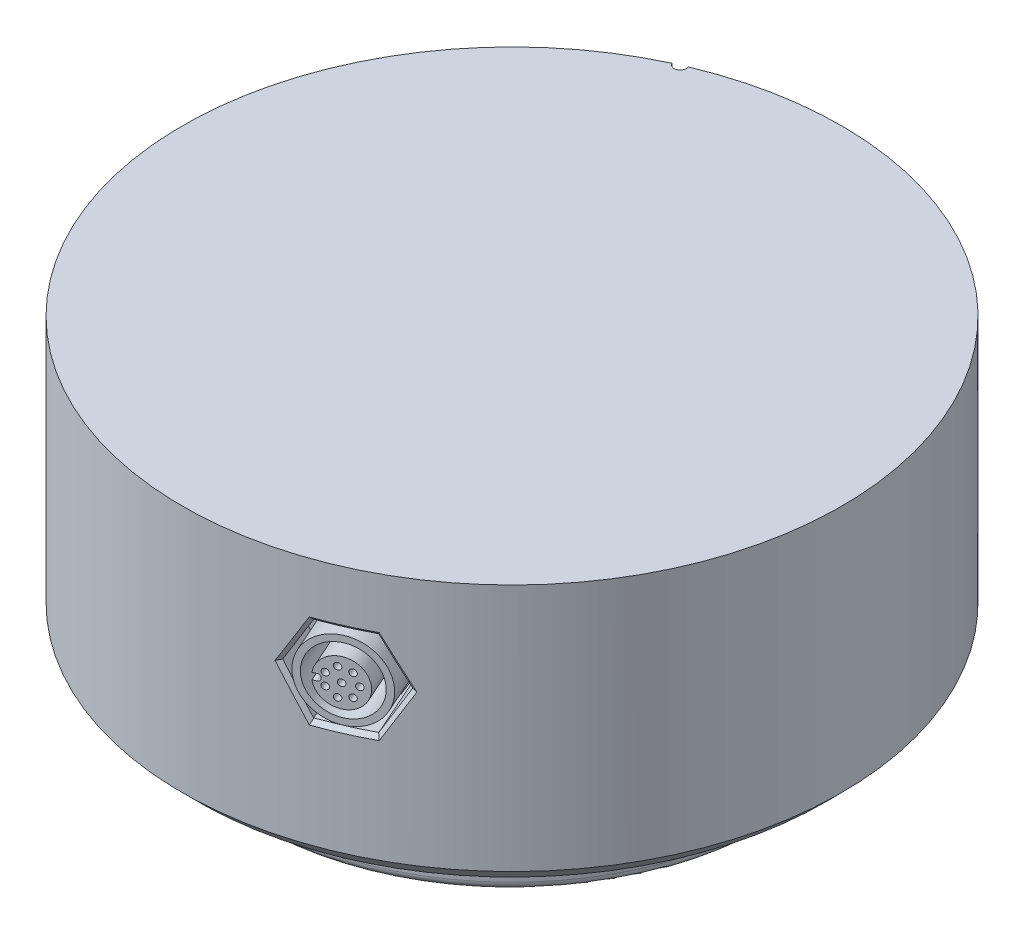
ISO-10303-21;
HEADER;
FILE_DESCRIPTION(('STEP AP214'),'2;1');
FILE_NAME('part.step','',(''),(''),'','','');
FILE_SCHEMA(('AUTOMOTIVE_DESIGN { 1 0 10303 214 1 1 1 1 }'));
ENDSEC;
DATA;
#1=APPLICATION_CONTEXT('core data for automotive mechanical design processes');
#2=APPLICATION_PROTOCOL_DEFINITION('international standard','automotive_design',2000,#1);
#3=PRODUCT_CONTEXT('',#1,'mechanical');
#4=PRODUCT('Part','Part','',(#3));
#5=PRODUCT_RELATED_PRODUCT_CATEGORY('part','',(#4));
#6=PRODUCT_DEFINITION_FORMATION('','',#4);
#7=PRODUCT_DEFINITION_CONTEXT('part definition',#1,'design');
#8=PRODUCT_DEFINITION('design','',#6,#7);
#9=PRODUCT_DEFINITION_SHAPE('','',#8);
#10=(LENGTH_UNIT() NAMED_UNIT(*) SI_UNIT(.MILLI.,.METRE.));
#11=(NAMED_UNIT(*) PLANE_ANGLE_UNIT() SI_UNIT($,.RADIAN.));
#12=(NAMED_UNIT(*) SI_UNIT($,.STERADIAN.) SOLID_ANGLE_UNIT());
#13=UNCERTAINTY_MEASURE_WITH_UNIT(LENGTH_MEASURE(1.E-05),#10,'distance_accuracy_value','');
#14=(GEOMETRIC_REPRESENTATION_CONTEXT(3) GLOBAL_UNCERTAINTY_ASSIGNED_CONTEXT((#13)) GLOBAL_UNIT_ASSIGNED_CONTEXT((#10,
#11,#12)) REPRESENTATION_CONTEXT('',''));
#15=CARTESIAN_POINT('',(0.,0.,0.));
#16=DIRECTION('',(0.,0.,1.));
#17=DIRECTION('',(1.,0.,0.));
#18=AXIS2_PLACEMENT_3D('',#15,#16,#17);
#19=CARTESIAN_POINT('',(-810.378339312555,9.99999999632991,618.22648744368));
#20=DIRECTION('',(-1.03271523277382E-11,-1.,-1.59913263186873E-11));
#21=DIRECTION('',(-0.697959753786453,1.86599936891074E-11,-0.71613698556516));
#22=AXIS2_PLACEMENT_3D('',#19,#20,#21);
#23=PLANE('',#22);
#24=CARTESIAN_POINT('',(-158.779226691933,9.99999999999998,-32.0823793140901));
#25=DIRECTION('',(0.,-1.,0.));
#26=DIRECTION('',(0.403993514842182,0.,0.914761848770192));
#27=AXIS2_PLACEMENT_3D('',#24,#25,#26);
#28=CIRCLE('',#27,2.99999999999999);
#29=CARTESIAN_POINT('',(-157.567246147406,9.99999999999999,-29.3380937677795));
#30=VERTEX_POINT('',#29);
#31=EDGE_CURVE('P0_E2030',#30,#30,#28,.T.);
#32=ORIENTED_EDGE('',*,*,#31,.T.);
#33=EDGE_LOOP('',(#32));
#34=FACE_BOUND('',#33,.T.);
#35=ADVANCED_FACE('P0_F46',(#34),#23,.T.);
#36=CARTESIAN_POINT('',(-810.378339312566,8.99999999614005,618.226487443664));
#37=DIRECTION('',(-1.03278323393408E-11,-1.,-1.59911077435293E-11));
#38=DIRECTION('',(-0.697959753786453,1.8660316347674E-11,-0.71613698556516));
#39=AXIS2_PLACEMENT_3D('',#36,#37,#38);
#40=PLANE('',#39);
#41=CARTESIAN_POINT('',(-177.908258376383,9.,-31.638904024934));
#42=DIRECTION('',(0.,-1.,0.));
#43=DIRECTION('',(0.403993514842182,0.,0.914761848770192));
#44=AXIS2_PLACEMENT_3D('',#41,#42,#43);
#45=CIRCLE('',#44,2.49999999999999);
#46=CARTESIAN_POINT('',(-176.898274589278,9.,-29.3519994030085));
#47=VERTEX_POINT('',#46);
#48=EDGE_CURVE('P0_E2033',#47,#47,#45,.T.);
#49=ORIENTED_EDGE('',*,*,#48,.T.);
#50=EDGE_LOOP('',(#49));
#51=FACE_BOUND('',#50,.T.);
#52=ADVANCED_FACE('P0_F1123',(#51),#40,.T.);
#53=CARTESIAN_POINT('',(-810.378339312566,8.99999999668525,618.226487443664));
#54=DIRECTION('',(-1.03285938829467E-11,-1.,-1.59911250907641E-11));
#55=DIRECTION('',(-0.697959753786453,1.86608610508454E-11,-0.71613698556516));
#56=AXIS2_PLACEMENT_3D('',#53,#54,#55);
#57=PLANE('',#56);
#58=CARTESIAN_POINT('',(-144.939374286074,9.00000000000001,-18.8696956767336));
#59=DIRECTION('',(0.,-1.,0.));
#60=DIRECTION('',(0.403993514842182,0.,0.914761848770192));
#61=AXIS2_PLACEMENT_3D('',#58,#59,#60);
#62=CIRCLE('',#61,2.49999999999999);
#63=CARTESIAN_POINT('',(-143.929390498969,9.00000000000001,-16.5827910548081));
#64=VERTEX_POINT('',#63);
#65=EDGE_CURVE('P0_E2036',#64,#64,#62,.T.);
#66=ORIENTED_EDGE('',*,*,#65,.T.);
#67=EDGE_LOOP('',(#66));
#68=FACE_BOUND('',#67,.T.);
#69=ADVANCED_FACE('P0_F1134',(#68),#57,.T.);
#70=CARTESIAN_POINT('',(-810.378339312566,8.99999999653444,618.226487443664));
#71=DIRECTION('',(-1.03261774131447E-11,-1.,-1.59909672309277E-11));
#72=DIRECTION('',(-0.697959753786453,1.86590569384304E-11,-0.71613698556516));
#73=AXIS2_PLACEMENT_3D('',#70,#71,#72);
#74=PLANE('',#73);
#75=CARTESIAN_POINT('',(-190.677466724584,9.00000000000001,1.32998006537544));
#76=DIRECTION('',(0.,-1.,0.));
#77=DIRECTION('',(0.403993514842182,0.,0.914761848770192));
#78=AXIS2_PLACEMENT_3D('',#75,#76,#77);
#79=CIRCLE('',#78,2.49999999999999);
#80=CARTESIAN_POINT('',(-189.667482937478,9.00000000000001,3.6168846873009));
#81=VERTEX_POINT('',#80);
#82=EDGE_CURVE('P0_E2039',#81,#81,#79,.T.);
#83=ORIENTED_EDGE('',*,*,#82,.T.);
#84=EDGE_LOOP('',(#83));
#85=FACE_BOUND('',#84,.T.);
#86=ADVANCED_FACE('P0_F1145',(#85),#74,.T.);
#87=CARTESIAN_POINT('',(-810.378339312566,8.99999999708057,618.226487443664));
#88=DIRECTION('',(-1.03283510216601E-11,-1.,-1.59908683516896E-11));
#89=DIRECTION('',(-0.697959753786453,1.86605036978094E-11,-0.71613698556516));
#90=AXIS2_PLACEMENT_3D('',#87,#88,#89);
#91=PLANE('',#90);
#92=CARTESIAN_POINT('',(-157.708582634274,9.00000000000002,14.0991884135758));
#93=DIRECTION('',(0.,-1.,0.));
#94=DIRECTION('',(0.403993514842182,0.,0.914761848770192));
#95=AXIS2_PLACEMENT_3D('',#92,#93,#94);
#96=CIRCLE('',#95,2.49999999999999);
#97=CARTESIAN_POINT('',(-156.698598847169,9.00000000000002,16.3860930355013));
#98=VERTEX_POINT('',#97);
#99=EDGE_CURVE('P0_E2042',#98,#98,#96,.T.);
#100=ORIENTED_EDGE('',*,*,#99,.T.);
#101=EDGE_LOOP('',(#100));
#102=FACE_BOUND('',#101,.T.);
#103=ADVANCED_FACE('P0_F889',(#102),#91,.T.);
#104=CARTESIAN_POINT('',(-162.249780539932,26.,-48.9401704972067));
#105=DIRECTION('',(-0.124847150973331,0.,0.992175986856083));
#106=DIRECTION('',(-0.98579535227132,-0.11322783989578,-0.124044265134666));
#107=AXIS2_PLACEMENT_3D('',#104,#105,#106);
#108=PLANE('',#107);
#109=CARTESIAN_POINT('',(-162.249780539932,26.,-48.9401704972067));
#110=DIRECTION('',(-0.124847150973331,0.,0.992175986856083));
#111=DIRECTION('',(-0.98579535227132,-0.11322783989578,-0.124044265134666));
#112=AXIS2_PLACEMENT_3D('',#109,#110,#111);
#113=CIRCLE('',#112,4.3);
#114=CARTESIAN_POINT('',(-166.488700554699,25.5131202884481,-49.4735608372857));
#115=VERTEX_POINT('',#114);
#116=EDGE_CURVE('P0_E167',#115,#115,#113,.F.);
#117=ORIENTED_EDGE('',*,*,#116,.T.);
#118=EDGE_LOOP('',(#117));
#119=FACE_BOUND('',#118,.T.);
#120=ADVANCED_FACE('P0_F877',(#119),#108,.F.);
#121=CARTESIAN_POINT('',(-162.274749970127,26.,-48.7417352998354));
#122=DIRECTION('',(-0.124847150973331,0.,0.992175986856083));
#123=DIRECTION('',(-0.98579535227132,-0.11322783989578,-0.124044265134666));
#124=AXIS2_PLACEMENT_3D('',#121,#122,#123);
#125=TOROIDAL_SURFACE('',#124,4.3,0.2);
#126=ORIENTED_EDGE('',*,*,#116,.F.);
#127=EDGE_LOOP('',(#126));
#128=FACE_BOUND('',#127,.T.);
#129=CARTESIAN_POINT('',(-162.274749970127,26.,-48.7417352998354));
#130=DIRECTION('',(-0.124847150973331,0.,0.992175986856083));
#131=DIRECTION('',(-0.98579535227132,-0.11322783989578,-0.124044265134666));
#132=AXIS2_PLACEMENT_3D('',#129,#130,#131);
#133=CIRCLE('',#132,4.5);
#134=CARTESIAN_POINT('',(-166.710829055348,25.490474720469,-49.2999344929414));
#135=VERTEX_POINT('',#134);
#136=EDGE_CURVE('P0_E170',#135,#135,#133,.T.);
#137=ORIENTED_EDGE('',*,*,#136,.F.);
#138=EDGE_LOOP('',(#137));
#139=FACE_BOUND('',#138,.T.);
#140=ADVANCED_FACE('P0_F865',(#128,#139),#125,.T.);
#141=CARTESIAN_POINT('',(-164.128730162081,26.,-34.0079218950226));
#142=DIRECTION('',(-0.124847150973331,0.,0.992175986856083));
#143=DIRECTION('',(-0.98579535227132,-0.11322783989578,-0.124044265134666));
#144=AXIS2_PLACEMENT_3D('',#141,#142,#143);
#145=CYLINDRICAL_SURFACE('',#144,4.5);
#146=ORIENTED_EDGE('',*,*,#136,.T.);
#147=EDGE_LOOP('',(#146));
#148=FACE_BOUND('',#147,.T.);
#149=CARTESIAN_POINT('',(-162.443293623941,26.,-47.4022977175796));
#150=DIRECTION('',(-0.124847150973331,0.,0.992175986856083));
#151=DIRECTION('',(-0.98579535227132,-0.11322783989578,-0.124044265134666));
#152=AXIS2_PLACEMENT_3D('',#149,#150,#151);
#153=CIRCLE('',#152,4.5);
#154=CARTESIAN_POINT('',(-166.879372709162,25.490474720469,-47.9604969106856));
#155=VERTEX_POINT('',#154);
#156=EDGE_CURVE('P0_E1991',#155,#155,#153,.T.);
#157=ORIENTED_EDGE('',*,*,#156,.F.);
#158=EDGE_LOOP('',(#157));
#159=FACE_BOUND('',#158,.T.);
#160=ADVANCED_FACE('P0_F860',(#148,#159),#145,.T.);
#161=CARTESIAN_POINT('',(-162.948832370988,30.4710607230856,-47.4659104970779));
#162=DIRECTION('',(-0.124847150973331,0.,0.992175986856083));
#163=DIRECTION('',(-0.98579535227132,-0.11322783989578,-0.124044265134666));
#164=AXIS2_PLACEMENT_3D('',#161,#162,#163);
#165=PLANE('',#164);
#166=CARTESIAN_POINT('',(-162.443293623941,26.,-47.4022977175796));
#167=DIRECTION('',(-0.124847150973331,0.,0.992175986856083));
#168=DIRECTION('',(-0.98579535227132,-0.11322783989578,-0.124044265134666));
#169=AXIS2_PLACEMENT_3D('',#166,#167,#168);
#170=CIRCLE('',#169,5.5);
#171=CARTESIAN_POINT('',(-167.865168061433,25.3772468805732,-48.0845411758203));
#172=VERTEX_POINT('',#171);
#173=EDGE_CURVE('P0_E712',#172,#172,#170,.T.);
#174=ORIENTED_EDGE('',*,*,#173,.F.);
#175=EDGE_LOOP('',(#174));
#176=FACE_BOUND('',#175,.T.);
#177=ORIENTED_EDGE('',*,*,#156,.T.);
#178=EDGE_LOOP('',(#177));
#179=FACE_BOUND('',#178,.T.);
#180=ADVANCED_FACE('P0_F864',(#176,#179),#165,.F.);
#181=CARTESIAN_POINT('',(-162.443293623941,26.,-47.4022977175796));
#182=DIRECTION('',(-0.124847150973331,0.,0.992175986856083));
#183=DIRECTION('',(-0.98579535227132,-0.11322783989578,-0.124044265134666));
#184=AXIS2_PLACEMENT_3D('',#181,#182,#183);
#185=CONICAL_SURFACE('',#184,5.5,0.896055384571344);
#186=CARTESIAN_POINT('',(-162.593110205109,26.,-46.2116865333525));
#187=DIRECTION('',(-0.124847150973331,0.,0.992175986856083));
#188=DIRECTION('',(0.992136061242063,0.0089710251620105,0.124842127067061));
#189=AXIS2_PLACEMENT_3D('',#186,#187,#188);
#190=CIRCLE('',#189,7.);
#191=CARTESIAN_POINT('',(-155.648157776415,26.0627971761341,-45.3377916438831));
#192=VERTEX_POINT('',#191);
#193=EDGE_CURVE('P0_E177',#192,#192,#190,.T.);
#194=ORIENTED_EDGE('',*,*,#193,.F.);
#195=EDGE_LOOP('',(#194));
#196=FACE_BOUND('',#195,.T.);
#197=ORIENTED_EDGE('',*,*,#173,.T.);
#198=EDGE_LOOP('',(#197));
#199=FACE_BOUND('',#198,.T.);
#200=ADVANCED_FACE('P0_F1179',(#196,#199),#185,.T.);
#201=CARTESIAN_POINT('',(-154.880628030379,39.,20.5025213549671));
#202=DIRECTION('',(0.403993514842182,0.,0.914761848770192));
#203=DIRECTION('',(-0.914761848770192,0.,0.403993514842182));
#204=AXIS2_PLACEMENT_3D('',#201,#202,#203);
#205=PLANE('',#204);
#206=DIRECTION('',(0.457380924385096,0.866025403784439,-0.201996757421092));
#207=VECTOR('',#206,1.);
#208=CARTESIAN_POINT('',(-157.653352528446,32.25,21.7270616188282));
#209=LINE('',#208,#207);
#210=CARTESIAN_POINT('',(-160.426077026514,27.,22.9516018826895));
#211=VERTEX_POINT('',#210);
#212=CARTESIAN_POINT('',(-157.653352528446,32.25,21.7270616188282));
#213=VERTEX_POINT('',#212);
#214=EDGE_CURVE('P0_E707',#211,#213,#209,.T.);
#215=ORIENTED_EDGE('',*,*,#214,.F.);
#216=DIRECTION('',(-0.457380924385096,0.866025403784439,0.201996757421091));
#217=VECTOR('',#216,1.);
#218=CARTESIAN_POINT('',(-160.426077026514,27.,22.9516018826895));
#219=LINE('',#218,#217);
#220=CARTESIAN_POINT('',(-157.653352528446,21.75,21.7270616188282));
#221=VERTEX_POINT('',#220);
#222=EDGE_CURVE('P0_E711',#221,#211,#219,.T.);
#223=ORIENTED_EDGE('',*,*,#222,.F.);
#224=DIRECTION('',(-0.914761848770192,0.,0.403993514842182));
#225=VECTOR('',#224,1.);
#226=CARTESIAN_POINT('',(-157.653352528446,21.75,21.7270616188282));
#227=LINE('',#226,#225);
#228=CARTESIAN_POINT('',(-152.107903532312,21.75,19.2779810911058));
#229=VERTEX_POINT('',#228);
#230=EDGE_CURVE('P0_E715',#229,#221,#227,.T.);
#231=ORIENTED_EDGE('',*,*,#230,.F.);
#232=DIRECTION('',(-0.457380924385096,-0.866025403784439,0.201996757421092));
#233=VECTOR('',#232,1.);
#234=CARTESIAN_POINT('',(-152.107903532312,21.75,19.2779810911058));
#235=LINE('',#234,#233);
#236=CARTESIAN_POINT('',(-149.335179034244,27.,18.0534408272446));
#237=VERTEX_POINT('',#236);
#238=EDGE_CURVE('P0_E718',#237,#229,#235,.T.);
#239=ORIENTED_EDGE('',*,*,#238,.F.);
#240=DIRECTION('',(0.457380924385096,-0.866025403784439,-0.201996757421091));
#241=VECTOR('',#240,1.);
#242=CARTESIAN_POINT('',(-149.335179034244,27.,18.0534408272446));
#243=LINE('',#242,#241);
#244=CARTESIAN_POINT('',(-152.107903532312,32.25,19.2779810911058));
#245=VERTEX_POINT('',#244);
#246=EDGE_CURVE('P0_E721',#245,#237,#243,.T.);
#247=ORIENTED_EDGE('',*,*,#246,.F.);
#248=DIRECTION('',(0.914761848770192,0.,-0.403993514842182));
#249=VECTOR('',#248,1.);
#250=CARTESIAN_POINT('',(-152.107903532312,32.25,19.2779810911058));
#251=LINE('',#250,#249);
#252=EDGE_CURVE('P0_E724',#213,#245,#251,.T.);
#253=ORIENTED_EDGE('',*,*,#252,.F.);
#254=EDGE_LOOP('',(#215,#223,#231,#239,#247,#253));
#255=FACE_BOUND('',#254,.T.);
#256=ADVANCED_FACE('P0_F210',(#255),#205,.T.);
#257=CARTESIAN_POINT('',(-164.133010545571,32.25,7.05518266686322));
#258=DIRECTION('',(-0.792206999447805,0.5,0.349868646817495));
#259=DIRECTION('',(-0.457380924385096,-0.866025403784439,0.201996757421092));
#260=AXIS2_PLACEMENT_3D('',#257,#258,#259);
#261=PLANE('',#260);
#262=CARTESIAN_POINT('',(-154.467867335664,32.25,28.9399504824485));
#263=CARTESIAN_POINT('',(-154.465665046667,32.2523157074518,28.9416277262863));
#264=CARTESIAN_POINT('',(-154.463462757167,32.2546314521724,28.9433049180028));
#265=CARTESIAN_POINT('',(-154.459058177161,32.2592630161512,28.9466591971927));
#266=CARTESIAN_POINT('',(-154.456855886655,32.2615788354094,28.9483362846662));
#267=CARTESIAN_POINT('',(-154.454653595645,32.2638946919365,28.9500133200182));
#268=B_SPLINE_CURVE_WITH_KNOTS('',3,(#262,#263,#264,#265,#266,#267),.UNSPECIFIED.,.F.,.F.,(4,2,
4),(0.,0.0108273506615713,0.0216547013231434),.UNSPECIFIED.);
#269=CARTESIAN_POINT('',(-154.467867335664,32.25,28.9399504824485));
#270=VERTEX_POINT('',#269);
#271=CARTESIAN_POINT('',(-154.454653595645,32.2638946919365,28.9500133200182));
#272=VERTEX_POINT('',#271);
#273=EDGE_CURVE('P0_E727',#270,#272,#268,.T.);
#274=ORIENTED_EDGE('',*,*,#273,.T.);
#275=CARTESIAN_POINT('',(-157.664631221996,26.5087669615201,29.9063640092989));
#276=CARTESIAN_POINT('',(-156.475327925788,28.6035869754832,29.6055779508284));
#277=CARTESIAN_POINT('',(-155.299860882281,30.7147602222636,29.2500919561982));
#278=CARTESIAN_POINT('',(-154.143188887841,32.8333805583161,28.8414056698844));
#279=B_SPLINE_CURVE_WITH_KNOTS('',3,(#275,#276,#277,#278),.UNSPECIFIED.,.F.,.F.,(4,4),
(4.54423272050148,4.63614159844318),.UNSPECIFIED.);
#280=CARTESIAN_POINT('',(-154.462266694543,32.25,28.9526320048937));
#281=VERTEX_POINT('',#280);
#282=EDGE_CURVE('P0_E192',#272,#281,#279,.F.);
#283=ORIENTED_EDGE('',*,*,#282,.T.);
#284=CARTESIAN_POINT('',(-157.664631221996,26.5087669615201,29.9063640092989));
#285=CARTESIAN_POINT('',(-156.475327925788,28.6035869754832,29.6055779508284));
#286=CARTESIAN_POINT('',(-155.299860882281,30.7147602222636,29.2500919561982));
#287=CARTESIAN_POINT('',(-154.143188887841,32.8333805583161,28.8414056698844));
#288=B_SPLINE_CURVE_WITH_KNOTS('',3,(#284,#285,#286,#287),.UNSPECIFIED.,.F.,.F.,(4,4),
(4.54423272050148,4.63614159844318),.UNSPECIFIED.);
#289=CARTESIAN_POINT('',(-157.386164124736,27.,29.8348716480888));
#290=VERTEX_POINT('',#289);
#291=EDGE_CURVE('P0_E404',#281,#290,#288,.F.);
#292=ORIENTED_EDGE('',*,*,#291,.T.);
#293=DIRECTION('',(0.403993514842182,0.,0.914761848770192));
#294=VECTOR('',#293,1.);
#295=CARTESIAN_POINT('',(-166.905735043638,27.,8.27972293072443));
#296=LINE('',#295,#294);
#297=EDGE_CURVE('P0_E734',#211,#290,#296,.T.);
#298=ORIENTED_EDGE('',*,*,#297,.F.);
#299=ORIENTED_EDGE('',*,*,#214,.T.);
#300=DIRECTION('',(0.403993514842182,0.,0.914761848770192));
#301=VECTOR('',#300,1.);
#302=CARTESIAN_POINT('',(-164.133010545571,32.25,7.05518266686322));
#303=LINE('',#302,#301);
#304=EDGE_CURVE('P0_E736',#213,#270,#303,.T.);
#305=ORIENTED_EDGE('',*,*,#304,.T.);
#306=EDGE_LOOP('',(#274,#283,#292,#298,#299,#305));
#307=FACE_BOUND('',#306,.T.);
#308=ADVANCED_FACE('P0_F199',(#307),#261,.F.);
#309=CARTESIAN_POINT('',(-167.808420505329,32.75,-8.76985780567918));
#310=DIRECTION('',(0.,1.,0.));
#311=DIRECTION('',(-0.403993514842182,0.,-0.914761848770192));
#312=AXIS2_PLACEMENT_3D('',#309,#310,#311);
#313=CONICAL_SURFACE('',#312,40.5,0.785398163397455);
#314=ORIENTED_EDGE('',*,*,#273,.F.);
#315=CARTESIAN_POINT('',(-167.808420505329,32.25,-8.76985780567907));
#316=DIRECTION('',(0.,1.,0.));
#317=DIRECTION('',(-0.403993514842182,0.,-0.914761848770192));
#318=AXIS2_PLACEMENT_3D('',#315,#316,#317);
#319=CIRCLE('',#318,40.);
#320=CARTESIAN_POINT('',(-148.922418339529,32.25,26.490869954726));
#321=VERTEX_POINT('',#320);
#322=EDGE_CURVE('P0_E741',#321,#270,#319,.F.);
#323=ORIENTED_EDGE('',*,*,#322,.F.);
#324=CARTESIAN_POINT('',(-148.92388122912,32.2638946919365,26.5074145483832));
#325=CARTESIAN_POINT('',(-148.923637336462,32.2615788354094,26.5046571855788));
#326=CARTESIAN_POINT('',(-148.923393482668,32.2592630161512,26.5018997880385));
#327=CARTESIAN_POINT('',(-148.922905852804,32.2546314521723,26.4963849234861));
#328=CARTESIAN_POINT('',(-148.922662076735,32.2523157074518,26.493627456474));
#329=CARTESIAN_POINT('',(-148.922418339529,32.25,26.490869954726));
#330=B_SPLINE_CURVE_WITH_KNOTS('',3,(#324,#325,#326,#327,#328,#329),.UNSPECIFIED.,.F.,.F.,(4,2,
4),(0.,0.0108273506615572,0.0216547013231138),.UNSPECIFIED.);
#331=CARTESIAN_POINT('',(-148.92388122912,32.2638946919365,26.5074145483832));
#332=VERTEX_POINT('',#331);
#333=EDGE_CURVE('P0_E744',#332,#321,#330,.T.);
#334=ORIENTED_EDGE('',*,*,#333,.F.);
#335=CARTESIAN_POINT('',(-148.523205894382,32.7500001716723,26.8437703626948));
#336=CARTESIAN_POINT('',(-148.541235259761,32.7280200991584,26.828537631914));
#337=CARTESIAN_POINT('',(-148.559273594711,32.706043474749,26.8133105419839));
#338=CARTESIAN_POINT('',(-148.59496960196,32.6625825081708,26.7832038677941));
#339=CARTESIAN_POINT('',(-148.61262688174,32.6410980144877,26.7683240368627));
#340=CARTESIAN_POINT('',(-148.647559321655,32.5986212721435,26.7389114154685));
#341=CARTESIAN_POINT('',(-148.664834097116,32.5776288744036,26.7243783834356));
#342=CARTESIAN_POINT('',(-148.699000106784,32.5361362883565,26.6956589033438));
#343=CARTESIAN_POINT('',(-148.715890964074,32.5156359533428,26.6814722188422));
#344=CARTESIAN_POINT('',(-148.749287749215,32.4751274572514,26.6534449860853));
#345=CARTESIAN_POINT('',(-148.765793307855,32.4551191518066,26.6396042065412));
#346=CARTESIAN_POINT('',(-148.798418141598,32.4155946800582,26.6122683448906));
#347=CARTESIAN_POINT('',(-148.814537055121,32.3960783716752,26.5987730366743));
#348=CARTESIAN_POINT('',(-148.846387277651,32.3575378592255,26.5721276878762));
#349=CARTESIAN_POINT('',(-148.862118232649,32.3385135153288,26.5589774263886));
#350=CARTESIAN_POINT('',(-148.893191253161,32.3009568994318,26.5330217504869));
#351=CARTESIAN_POINT('',(-148.908532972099,32.2824244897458,26.5202161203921));
#352=CARTESIAN_POINT('',(-148.92388122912,32.2638946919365,26.5074145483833));
#353=B_SPLINE_CURVE_WITH_KNOTS('',3,(#335,#336,#337,#338,#339,#340,#341,#342,#343,#344,#345,
#346,#347,#348,#349,#350,#351,#352),.UNSPECIFIED.,.F.,.F.,(4,2,2,2,2,2,2,2,4),(0.,
0.0967572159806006,0.191377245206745,0.283858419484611,0.374199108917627,0.462397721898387,
0.548452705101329,0.632362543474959,0.71412576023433),.UNSPECIFIED.);
#354=CARTESIAN_POINT('',(-148.523205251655,32.7499999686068,26.8437698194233));
#355=VERTEX_POINT('',#354);
#356=EDGE_CURVE('P0_E228',#332,#355,#353,.F.);
#357=ORIENTED_EDGE('',*,*,#356,.T.);
#358=CARTESIAN_POINT('',(-167.808420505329,32.75,-8.76985780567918));
#359=DIRECTION('',(0.,1.,0.));
#360=DIRECTION('',(-0.403993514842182,0.,-0.914761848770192));
#361=AXIS2_PLACEMENT_3D('',#358,#359,#360);
#362=CIRCLE('',#361,40.5);
#363=CARTESIAN_POINT('',(-154.475934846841,32.7499999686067,29.4727209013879));
#364=VERTEX_POINT('',#363);
#365=EDGE_CURVE('P0_E752',#364,#355,#362,.T.);
#366=ORIENTED_EDGE('',*,*,#365,.F.);
#367=CARTESIAN_POINT('',(-154.454653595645,32.2638946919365,28.9500133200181));
#368=CARTESIAN_POINT('',(-154.455530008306,32.2824244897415,28.9699803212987));
#369=CARTESIAN_POINT('',(-154.45639901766,32.3009568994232,28.9899452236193));
#370=CARTESIAN_POINT('',(-154.458144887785,32.3385135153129,29.0303949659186));
#371=CARTESIAN_POINT('',(-154.459021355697,32.3575378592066,29.0508796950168));
#372=CARTESIAN_POINT('',(-154.460780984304,32.3960783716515,29.0923684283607));
#373=CARTESIAN_POINT('',(-154.461663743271,32.4155946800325,29.1133723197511));
#374=CARTESIAN_POINT('',(-154.463434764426,32.4551191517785,29.1558986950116));
#375=CARTESIAN_POINT('',(-154.464322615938,32.4751274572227,29.1774210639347));
#376=CARTESIAN_POINT('',(-154.466102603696,32.5156359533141,29.2209836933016));
#377=CARTESIAN_POINT('',(-154.466994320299,32.5361362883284,29.2430238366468));
#378=CARTESIAN_POINT('',(-154.468780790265,32.577628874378,29.2876212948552));
#379=CARTESIAN_POINT('',(-154.469675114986,32.5986212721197,29.3101784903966));
#380=CARTESIAN_POINT('',(-154.471465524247,32.6410980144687,29.3558093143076));
#381=CARTESIAN_POINT('',(-154.472361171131,32.6625825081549,29.3788828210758));
#382=CARTESIAN_POINT('',(-154.474152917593,32.7060434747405,29.4255455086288));
#383=CARTESIAN_POINT('',(-154.475048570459,32.7280200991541,29.4491345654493));
#384=CARTESIAN_POINT('',(-154.475934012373,32.7500001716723,29.4727207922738));
#385=B_SPLINE_CURVE_WITH_KNOTS('',3,(#367,#368,#369,#370,#371,#372,#373,#374,#375,#376,#377,
#378,#379,#380,#381,#382,#383,#384),.UNSPECIFIED.,.F.,.F.,(4,2,2,2,2,2,2,2,4),(0.,
0.0817632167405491,0.165673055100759,0.25172803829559,0.339926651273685,0.430267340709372,
0.522748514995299,0.61736854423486,0.714125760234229),.UNSPECIFIED.);
#386=EDGE_CURVE('P0_E241',#364,#272,#385,.F.);
#387=ORIENTED_EDGE('',*,*,#386,.T.);
#388=EDGE_LOOP('',(#314,#323,#334,#357,#366,#387));
#389=FACE_BOUND('',#388,.T.);
#390=ADVANCED_FACE('P0_F209',(#389),#313,.T.);
#391=CARTESIAN_POINT('',(-158.587561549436,32.25,4.6061021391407));
#392=DIRECTION('',(0.,1.,0.));
#393=DIRECTION('',(-0.403993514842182,0.,-0.914761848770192));
#394=AXIS2_PLACEMENT_3D('',#391,#392,#393);
#395=PLANE('',#394);
#396=DIRECTION('',(0.403993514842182,0.,0.914761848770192));
#397=VECTOR('',#396,1.);
#398=CARTESIAN_POINT('',(-158.587561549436,32.25,4.6061021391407));
#399=LINE('',#398,#397);
#400=EDGE_CURVE('P0_E756',#245,#321,#399,.T.);
#401=ORIENTED_EDGE('',*,*,#400,.T.);
#402=ORIENTED_EDGE('',*,*,#322,.T.);
#403=ORIENTED_EDGE('',*,*,#304,.F.);
#404=ORIENTED_EDGE('',*,*,#252,.T.);
#405=EDGE_LOOP('',(#401,#402,#403,#404));
#406=FACE_BOUND('',#405,.T.);
#407=ADVANCED_FACE('P0_F271',(#406),#395,.F.);
#408=CARTESIAN_POINT('',(-155.814837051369,27.,3.3815618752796));
#409=DIRECTION('',(0.792206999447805,0.5,-0.349868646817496));
#410=DIRECTION('',(-0.457380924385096,0.866025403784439,0.201996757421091));
#411=AXIS2_PLACEMENT_3D('',#408,#409,#410);
#412=PLANE('',#411);
#413=DIRECTION('',(0.403993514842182,0.,0.914761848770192));
#414=VECTOR('',#413,1.);
#415=CARTESIAN_POINT('',(-155.814837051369,27.,3.3815618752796));
#416=LINE('',#415,#414);
#417=CARTESIAN_POINT('',(-146.295266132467,27.,24.936710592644));
#418=VERTEX_POINT('',#417);
#419=EDGE_CURVE('P0_E759',#237,#418,#416,.T.);
#420=ORIENTED_EDGE('',*,*,#419,.T.);
#421=CARTESIAN_POINT('',(-149.213950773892,32.8333805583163,26.664467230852));
#422=CARTESIAN_POINT('',(-148.132774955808,30.7147602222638,26.0848350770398));
#423=CARTESIAN_POINT('',(-147.078260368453,28.6035869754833,25.4554766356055));
#424=CARTESIAN_POINT('',(-146.054855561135,26.5087669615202,24.779046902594));
#425=B_SPLINE_CURVE_WITH_KNOTS('',3,(#421,#422,#423,#424),.UNSPECIFIED.,.F.,.F.,(4,4),
(1.64704370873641,1.7389525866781),.UNSPECIFIED.);
#426=CARTESIAN_POINT('',(-148.916817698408,32.25,26.5035514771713));
#427=VERTEX_POINT('',#426);
#428=EDGE_CURVE('P0_E254',#418,#427,#425,.F.);
#429=ORIENTED_EDGE('',*,*,#428,.T.);
#430=CARTESIAN_POINT('',(-149.213950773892,32.8333805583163,26.664467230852));
#431=CARTESIAN_POINT('',(-148.132774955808,30.7147602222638,26.0848350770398));
#432=CARTESIAN_POINT('',(-147.078260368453,28.6035869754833,25.4554766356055));
#433=CARTESIAN_POINT('',(-146.054855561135,26.5087669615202,24.779046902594));
#434=B_SPLINE_CURVE_WITH_KNOTS('',3,(#430,#431,#432,#433),.UNSPECIFIED.,.F.,.F.,(4,4),
(1.64704370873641,1.7389525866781),.UNSPECIFIED.);
#435=EDGE_CURVE('P0_E763',#427,#332,#434,.F.);
#436=ORIENTED_EDGE('',*,*,#435,.T.);
#437=ORIENTED_EDGE('',*,*,#333,.T.);
#438=ORIENTED_EDGE('',*,*,#400,.F.);
#439=ORIENTED_EDGE('',*,*,#246,.T.);
#440=EDGE_LOOP('',(#420,#429,#436,#437,#438,#439));
#441=FACE_BOUND('',#440,.T.);
#442=ADVANCED_FACE('P0_F261',(#441),#412,.F.);
#443=CARTESIAN_POINT('',(-158.587561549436,21.75,4.6061021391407));
#444=DIRECTION('',(0.792206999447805,-0.5,-0.349868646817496));
#445=DIRECTION('',(0.457380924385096,0.866025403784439,-0.201996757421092));
#446=AXIS2_PLACEMENT_3D('',#443,#444,#445);
#447=PLANE('',#446);
#448=DIRECTION('',(0.403993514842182,0.,0.914761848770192));
#449=VECTOR('',#448,1.);
#450=CARTESIAN_POINT('',(-158.587561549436,21.75,4.6061021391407));
#451=LINE('',#450,#449);
#452=CARTESIAN_POINT('',(-148.922418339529,21.75,26.490869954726));
#453=VERTEX_POINT('',#452);
#454=EDGE_CURVE('P0_E762',#229,#453,#451,.T.);
#455=ORIENTED_EDGE('',*,*,#454,.T.);
#456=CARTESIAN_POINT('',(-148.922418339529,21.75,26.490869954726));
#457=CARTESIAN_POINT('',(-148.922662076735,21.7476842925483,26.4936274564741));
#458=CARTESIAN_POINT('',(-148.922905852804,21.7453685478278,26.4963849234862));
#459=CARTESIAN_POINT('',(-148.923393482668,21.7407369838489,26.5018997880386));
#460=CARTESIAN_POINT('',(-148.923637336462,21.7384211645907,26.5046571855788));
#461=CARTESIAN_POINT('',(-148.92388122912,21.7361053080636,26.5074145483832));
#462=B_SPLINE_CURVE_WITH_KNOTS('',3,(#456,#457,#458,#459,#460,#461),.UNSPECIFIED.,.F.,.F.,(4,2,
4),(0.,0.0108273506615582,0.0216547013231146),.UNSPECIFIED.);
#463=CARTESIAN_POINT('',(-148.92388122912,21.7361053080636,26.5074145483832));
#464=VERTEX_POINT('',#463);
#465=EDGE_CURVE('P0_E640',#453,#464,#462,.T.);
#466=ORIENTED_EDGE('',*,*,#465,.T.);
#467=CARTESIAN_POINT('',(-146.054855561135,27.4912330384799,24.779046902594));
#468=CARTESIAN_POINT('',(-147.078260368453,25.3964130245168,25.4554766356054));
#469=CARTESIAN_POINT('',(-148.132774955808,23.2852397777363,26.0848350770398));
#470=CARTESIAN_POINT('',(-149.213950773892,21.1666194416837,26.6644672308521));
#471=B_SPLINE_CURVE_WITH_KNOTS('',3,(#467,#468,#469,#470),.UNSPECIFIED.,.F.,.F.,(4,4),
(1.40264006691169,1.49454894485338),.UNSPECIFIED.);
#472=CARTESIAN_POINT('',(-148.916817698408,21.75,26.5035514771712));
#473=VERTEX_POINT('',#472);
#474=EDGE_CURVE('P0_E289',#464,#473,#471,.F.);
#475=ORIENTED_EDGE('',*,*,#474,.T.);
#476=CARTESIAN_POINT('',(-146.054855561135,27.4912330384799,24.779046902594));
#477=CARTESIAN_POINT('',(-147.078260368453,25.3964130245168,25.4554766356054));
#478=CARTESIAN_POINT('',(-148.132774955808,23.2852397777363,26.0848350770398));
#479=CARTESIAN_POINT('',(-149.213950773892,21.1666194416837,26.6644672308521));
#480=B_SPLINE_CURVE_WITH_KNOTS('',3,(#476,#477,#478,#479),.UNSPECIFIED.,.F.,.F.,(4,4),
(1.40264006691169,1.49454894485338),.UNSPECIFIED.);
#481=EDGE_CURVE('P0_E301',#473,#418,#480,.F.);
#482=ORIENTED_EDGE('',*,*,#481,.T.);
#483=ORIENTED_EDGE('',*,*,#419,.F.);
#484=ORIENTED_EDGE('',*,*,#238,.T.);
#485=EDGE_LOOP('',(#455,#466,#475,#482,#483,#484));
#486=FACE_BOUND('',#485,.T.);
#487=ADVANCED_FACE('P0_F270',(#486),#447,.F.);
#488=CARTESIAN_POINT('',(-164.133010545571,21.75,7.05518266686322));
#489=DIRECTION('',(0.,-1.,0.));
#490=DIRECTION('',(0.403993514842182,0.,0.914761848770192));
#491=AXIS2_PLACEMENT_3D('',#488,#489,#490);
#492=PLANE('',#491);
#493=DIRECTION('',(0.403993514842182,0.,0.914761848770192));
#494=VECTOR('',#493,1.);
#495=CARTESIAN_POINT('',(-164.133010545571,21.75,7.05518266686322));
#496=LINE('',#495,#494);
#497=CARTESIAN_POINT('',(-154.467867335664,21.75,28.9399504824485));
#498=VERTEX_POINT('',#497);
#499=EDGE_CURVE('P0_E642',#221,#498,#496,.T.);
#500=ORIENTED_EDGE('',*,*,#499,.T.);
#501=CARTESIAN_POINT('',(-167.808420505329,21.75,-8.76985780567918));
#502=DIRECTION('',(0.,-1.,0.));
#503=DIRECTION('',(0.403993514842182,0.,0.914761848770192));
#504=AXIS2_PLACEMENT_3D('',#501,#502,#503);
#505=CIRCLE('',#504,40.);
#506=EDGE_CURVE('P0_E644',#498,#453,#505,.F.);
#507=ORIENTED_EDGE('',*,*,#506,.T.);
#508=ORIENTED_EDGE('',*,*,#454,.F.);
#509=ORIENTED_EDGE('',*,*,#230,.T.);
#510=EDGE_LOOP('',(#500,#507,#508,#509));
#511=FACE_BOUND('',#510,.T.);
#512=ADVANCED_FACE('P0_F332',(#511),#492,.F.);
#513=CARTESIAN_POINT('',(-166.905735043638,27.,8.27972293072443));
#514=DIRECTION('',(-0.792206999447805,-0.5,0.349868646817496));
#515=DIRECTION('',(0.457380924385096,-0.866025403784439,-0.201996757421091));
#516=AXIS2_PLACEMENT_3D('',#513,#514,#515);
#517=PLANE('',#516);
#518=ORIENTED_EDGE('',*,*,#297,.T.);
#519=CARTESIAN_POINT('',(-154.143188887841,21.1666194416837,28.8414056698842));
#520=CARTESIAN_POINT('',(-155.299860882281,23.2852397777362,29.2500919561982));
#521=CARTESIAN_POINT('',(-156.475327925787,25.3964130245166,29.6055779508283));
#522=CARTESIAN_POINT('',(-157.664631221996,27.4912330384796,29.9063640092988));
#523=B_SPLINE_CURVE_WITH_KNOTS('',3,(#519,#520,#521,#522),.UNSPECIFIED.,.F.,.F.,(4,4),
(4.7886363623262,4.8805452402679),.UNSPECIFIED.);
#524=CARTESIAN_POINT('',(-154.462266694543,21.75,28.9526320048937));
#525=VERTEX_POINT('',#524);
#526=EDGE_CURVE('P0_E315',#290,#525,#523,.F.);
#527=ORIENTED_EDGE('',*,*,#526,.T.);
#528=CARTESIAN_POINT('',(-154.143188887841,21.1666194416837,28.8414056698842));
#529=CARTESIAN_POINT('',(-155.299860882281,23.2852397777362,29.2500919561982));
#530=CARTESIAN_POINT('',(-156.475327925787,25.3964130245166,29.6055779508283));
#531=CARTESIAN_POINT('',(-157.664631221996,27.4912330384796,29.9063640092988));
#532=B_SPLINE_CURVE_WITH_KNOTS('',3,(#528,#529,#530,#531),.UNSPECIFIED.,.F.,.F.,(4,4),
(4.7886363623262,4.8805452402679),.UNSPECIFIED.);
#533=CARTESIAN_POINT('',(-154.454653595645,21.7361053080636,28.9500133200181));
#534=VERTEX_POINT('',#533);
#535=EDGE_CURVE('P0_E351',#525,#534,#532,.F.);
#536=ORIENTED_EDGE('',*,*,#535,.T.);
#537=CARTESIAN_POINT('',(-154.454653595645,21.7361053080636,28.9500133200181));
#538=CARTESIAN_POINT('',(-154.456855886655,21.7384211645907,28.9483362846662));
#539=CARTESIAN_POINT('',(-154.459058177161,21.740736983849,28.9466591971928));
#540=CARTESIAN_POINT('',(-154.463462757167,21.7453685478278,28.9433049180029));
#541=CARTESIAN_POINT('',(-154.465665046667,21.7476842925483,28.9416277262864));
#542=CARTESIAN_POINT('',(-154.467867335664,21.75,28.9399504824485));
#543=B_SPLINE_CURVE_WITH_KNOTS('',3,(#537,#538,#539,#540,#541,#542),.UNSPECIFIED.,.F.,.F.,(4,2,
4),(0.,0.010827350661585,0.0216547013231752),.UNSPECIFIED.);
#544=EDGE_CURVE('P0_E647',#534,#498,#543,.T.);
#545=ORIENTED_EDGE('',*,*,#544,.T.);
#546=ORIENTED_EDGE('',*,*,#499,.F.);
#547=ORIENTED_EDGE('',*,*,#222,.T.);
#548=EDGE_LOOP('',(#518,#527,#536,#545,#546,#547));
#549=FACE_BOUND('',#548,.T.);
#550=ADVANCED_FACE('P0_F322',(#549),#517,.F.);
#551=CARTESIAN_POINT('',(-154.316286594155,20.9611444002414,29.416688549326));
#552=CARTESIAN_POINT('',(-155.486178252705,23.0797647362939,29.8300457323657));
#553=CARTESIAN_POINT('',(-156.675079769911,25.1909379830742,30.1895945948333));
#554=CARTESIAN_POINT('',(-157.877975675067,27.2857579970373,30.493818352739));
#555=CARTESIAN_POINT('',(-154.143188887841,21.1666194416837,28.8414056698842));
#556=CARTESIAN_POINT('',(-155.299860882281,23.2852397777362,29.2500919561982));
#557=CARTESIAN_POINT('',(-156.475327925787,25.3964130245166,29.6055779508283));
#558=CARTESIAN_POINT('',(-157.664631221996,27.4912330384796,29.9063640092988));
#559=B_SPLINE_SURFACE_WITH_KNOTS('',1,3,((#551,#552,#553,#554),(#555,#556,#557,#558)),
.UNSPECIFIED.,.F.,.F.,.F.,(2,2),(4,4),(0.,1.),(4.7886363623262,4.8805452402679),.UNSPECIFIED.);
#560=CARTESIAN_POINT('',(-157.714031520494,26.9999999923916,30.4519904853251));
#561=CARTESIAN_POINT('',(-157.700315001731,26.9999978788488,30.4262738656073));
#562=CARTESIAN_POINT('',(-157.686603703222,26.999996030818,30.4005544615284));
#563=CARTESIAN_POINT('',(-157.659195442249,26.9999928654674,30.3491173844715));
#564=CARTESIAN_POINT('',(-157.64549847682,26.9999915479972,30.3233997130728));
#565=CARTESIAN_POINT('',(-157.618118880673,26.9999894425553,30.2719661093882));
#566=CARTESIAN_POINT('',(-157.60443624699,26.9999886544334,30.2462501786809));
#567=CARTESIAN_POINT('',(-157.577085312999,26.9999876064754,30.1948200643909));
#568=CARTESIAN_POINT('',(-157.563417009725,26.9999873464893,30.1691058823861));
#569=CARTESIAN_POINT('',(-157.536094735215,26.9999873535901,30.1176792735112));
#570=CARTESIAN_POINT('',(-157.522440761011,26.9999876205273,30.0919668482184));
#571=CARTESIAN_POINT('',(-157.495147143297,26.9999886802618,30.0405437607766));
#572=CARTESIAN_POINT('',(-157.481507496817,26.9999894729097,30.0148331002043));
#573=CARTESIAN_POINT('',(-157.454242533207,26.9999915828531,29.9634135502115));
#574=CARTESIAN_POINT('',(-157.440617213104,26.9999928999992,29.9377046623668));
#575=CARTESIAN_POINT('',(-157.4133809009,26.9999960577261,29.8862886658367));
#576=CARTESIAN_POINT('',(-157.399769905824,26.9999978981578,29.8605815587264));
#577=CARTESIAN_POINT('',(-157.386164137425,27.,29.8348716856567));
#578=B_SPLINE_CURVE_WITH_KNOTS('',3,(#560,#561,#562,#563,#564,#565,#566,#567,#568,#569,#570,
#571,#572,#573,#574,#575,#576,#577),.UNSPECIFIED.,.F.,.F.,(4,2,2,2,2,2,2,2,4),(0.,
0.0874379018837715,0.174850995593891,0.26223927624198,0.349602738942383,0.436941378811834,
0.524255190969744,0.611544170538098,0.698808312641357),.UNSPECIFIED.);
#579=CARTESIAN_POINT('',(-157.714031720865,26.9999999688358,30.4519896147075));
#580=VERTEX_POINT('',#579);
#581=EDGE_CURVE('P0_E371',#580,#290,#578,.T.);
#582=CARTESIAN_POINT('',(-157.877975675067,27.2857579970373,30.493818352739));
#583=CARTESIAN_POINT('',(-156.675079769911,25.1909379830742,30.1895945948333));
#584=CARTESIAN_POINT('',(-155.486178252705,23.0797647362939,29.8300457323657));
#585=CARTESIAN_POINT('',(-154.316286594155,20.9611444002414,29.416688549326));
#586=B_SPLINE_CURVE_WITH_KNOTS('',3,(#582,#583,#584,#585),.UNSPECIFIED.,.F.,.F.,(4,4),
(4.7886363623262,4.8805452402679),.UNSPECIFIED.);
#587=CARTESIAN_POINT('',(-154.475934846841,21.2500000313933,29.4727209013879));
#588=VERTEX_POINT('',#587);
#589=EDGE_CURVE('P0_E382',#588,#580,#586,.F.);
#590=CARTESIAN_POINT('',(-154.475934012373,21.2499998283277,29.4727207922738));
#591=CARTESIAN_POINT('',(-154.475048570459,21.2719799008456,29.4491345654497));
#592=CARTESIAN_POINT('',(-154.474152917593,21.2939565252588,29.4255455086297));
#593=CARTESIAN_POINT('',(-154.472361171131,21.3374174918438,29.3788828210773));
#594=CARTESIAN_POINT('',(-154.471465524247,21.3589019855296,29.3558093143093));
#595=CARTESIAN_POINT('',(-154.469675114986,21.4013787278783,29.3101784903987));
#596=CARTESIAN_POINT('',(-154.468780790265,21.4223711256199,29.2876212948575));
#597=CARTESIAN_POINT('',(-154.4669943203,21.4638637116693,29.2430238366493));
#598=CARTESIAN_POINT('',(-154.466102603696,21.4843640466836,29.2209836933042));
#599=CARTESIAN_POINT('',(-154.464322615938,21.5248725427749,29.1774210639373));
#600=CARTESIAN_POINT('',(-154.463434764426,21.5448808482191,29.1558986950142));
#601=CARTESIAN_POINT('',(-154.461663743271,21.5844053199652,29.1133723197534));
#602=CARTESIAN_POINT('',(-154.460780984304,21.6039216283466,29.0923684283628));
#603=CARTESIAN_POINT('',(-154.459021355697,21.6424621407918,29.0508796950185));
#604=CARTESIAN_POINT('',(-154.458144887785,21.6614864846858,29.03039496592));
#605=CARTESIAN_POINT('',(-154.45639901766,21.6990431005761,28.98994522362));
#606=CARTESIAN_POINT('',(-154.455530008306,21.7175755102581,28.969980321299));
#607=CARTESIAN_POINT('',(-154.454653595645,21.7361053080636,28.9500133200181));
#608=B_SPLINE_CURVE_WITH_KNOTS('',3,(#590,#591,#592,#593,#594,#595,#596,#597,#598,#599,#600,
#601,#602,#603,#604,#605,#606,#607),.UNSPECIFIED.,.F.,.F.,(4,2,2,2,2,2,2,2,4),(0.,
0.09675721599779,0.191377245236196,0.283858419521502,0.374199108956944,0.462397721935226,
0.548452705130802,0.63236254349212,0.71412576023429),.UNSPECIFIED.);
#609=EDGE_CURVE('P0_E393',#588,#534,#608,.T.);
#610=ORIENTED_EDGE('',*,*,#535,.F.);
#611=ORIENTED_EDGE('',*,*,#526,.F.);
#612=ORIENTED_EDGE('',*,*,#581,.F.);
#613=ORIENTED_EDGE('',*,*,#589,.F.);
#614=ORIENTED_EDGE('',*,*,#609,.T.);
#615=EDGE_LOOP('',(#610,#611,#612,#613,#614));
#616=FACE_BOUND('',#615,.T.);
#617=ADVANCED_FACE('P0_F331',(#616),#559,.T.);
#618=CARTESIAN_POINT('',(-157.877975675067,26.7142420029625,30.493818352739));
#619=CARTESIAN_POINT('',(-156.675079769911,28.8090620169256,30.1895945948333));
#620=CARTESIAN_POINT('',(-155.486178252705,30.9202352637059,29.8300457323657));
#621=CARTESIAN_POINT('',(-154.316286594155,33.0388555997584,29.416688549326));
#622=CARTESIAN_POINT('',(-157.664631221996,26.5087669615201,29.9063640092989));
#623=CARTESIAN_POINT('',(-156.475327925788,28.6035869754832,29.6055779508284));
#624=CARTESIAN_POINT('',(-155.299860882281,30.7147602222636,29.2500919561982));
#625=CARTESIAN_POINT('',(-154.143188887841,32.8333805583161,28.8414056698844));
#626=B_SPLINE_SURFACE_WITH_KNOTS('',1,3,((#618,#619,#620,#621),(#622,#623,#624,#625)),
.UNSPECIFIED.,.F.,.F.,.F.,(2,2),(4,4),(0.,1.),(4.54423272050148,4.63614159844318),.UNSPECIFIED.);
#627=CARTESIAN_POINT('',(-154.316286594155,33.0388555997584,29.416688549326));
#628=CARTESIAN_POINT('',(-155.486178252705,30.9202352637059,29.8300457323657));
#629=CARTESIAN_POINT('',(-156.675079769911,28.8090620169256,30.1895945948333));
#630=CARTESIAN_POINT('',(-157.877975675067,26.7142420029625,30.493818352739));
#631=B_SPLINE_CURVE_WITH_KNOTS('',3,(#627,#628,#629,#630),.UNSPECIFIED.,.F.,.F.,(4,4),
(4.54423272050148,4.63614159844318),.UNSPECIFIED.);
#632=EDGE_CURVE('P0_E459',#580,#364,#631,.F.);
#633=ORIENTED_EDGE('',*,*,#291,.F.);
#634=ORIENTED_EDGE('',*,*,#282,.F.);
#635=ORIENTED_EDGE('',*,*,#386,.F.);
#636=ORIENTED_EDGE('',*,*,#632,.F.);
#637=ORIENTED_EDGE('',*,*,#581,.T.);
#638=EDGE_LOOP('',(#633,#634,#635,#636,#637));
#639=FACE_BOUND('',#638,.T.);
#640=ADVANCED_FACE('P0_F409',(#639),#626,.T.);
#641=CARTESIAN_POINT('',(-167.808420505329,39.,-8.76985780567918));
#642=DIRECTION('',(0.,1.,0.));
#643=DIRECTION('',(-0.403993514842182,0.,-0.914761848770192));
#644=AXIS2_PLACEMENT_3D('',#641,#642,#643);
#645=CYLINDRICAL_SURFACE('',#644,40.5);
#646=CARTESIAN_POINT('',(-167.808420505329,39.,-8.76985780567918));
#647=DIRECTION('',(0.,1.,0.));
#648=DIRECTION('',(-0.403993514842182,0.,-0.914761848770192));
#649=AXIS2_PLACEMENT_3D('',#646,#647,#648);
#650=CIRCLE('',#649,40.5);
#651=CARTESIAN_POINT('',(-184.866260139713,39.,-45.5024061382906));
#652=VERTEX_POINT('',#651);
#653=CARTESIAN_POINT('',(-183.494388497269,39.,-46.1088509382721));
#654=VERTEX_POINT('',#653);
#655=EDGE_CURVE('P0_E166',#652,#654,#650,.T.);
#656=ORIENTED_EDGE('',*,*,#655,.F.);
#657=DIRECTION('',(0.,1.,0.));
#658=VECTOR('',#657,1.);
#659=CARTESIAN_POINT('',(-184.866260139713,37.5,-45.5024061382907));
#660=LINE('',#659,#658);
#661=CARTESIAN_POINT('',(-184.866260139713,36.,-45.5024061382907));
#662=VERTEX_POINT('',#661);
#663=EDGE_CURVE('P0_E60',#652,#662,#660,.F.);
#664=ORIENTED_EDGE('',*,*,#663,.T.);
#665=CARTESIAN_POINT('',(-167.808420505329,36.,-8.76985780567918));
#666=DIRECTION('',(0.,1.,0.));
#667=DIRECTION('',(0.,0.,1.));
#668=AXIS2_PLACEMENT_3D('',#665,#666,#667);
#669=CIRCLE('',#668,40.5);
#670=CARTESIAN_POINT('',(-183.494388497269,36.,-46.1088509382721));
#671=VERTEX_POINT('',#670);
#672=EDGE_CURVE('P0_E11',#671,#662,#669,.T.);
#673=ORIENTED_EDGE('',*,*,#672,.F.);
#674=DIRECTION('',(0.,1.,0.));
#675=VECTOR('',#674,1.);
#676=CARTESIAN_POINT('',(-183.494388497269,37.5,-46.1088509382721));
#677=LINE('',#676,#675);
#678=EDGE_CURVE('P0_E152',#671,#654,#677,.T.);
#679=ORIENTED_EDGE('',*,*,#678,.T.);
#680=EDGE_LOOP('',(#656,#664,#673,#679));
#681=FACE_BOUND('',#680,.T.);
#682=CARTESIAN_POINT('',(-167.808420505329,8.49999999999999,-8.76985780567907));
#683=DIRECTION('',(0.,1.,0.));
#684=DIRECTION('',(-0.403993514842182,0.,-0.914761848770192));
#685=AXIS2_PLACEMENT_3D('',#682,#683,#684);
#686=CIRCLE('',#685,40.5);
#687=CARTESIAN_POINT('',(-184.170157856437,8.49999999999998,-45.8177126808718));
#688=VERTEX_POINT('',#687);
#689=EDGE_CURVE('P0_E655',#688,#688,#686,.T.);
#690=ORIENTED_EDGE('',*,*,#689,.T.);
#691=EDGE_LOOP('',(#690));
#692=FACE_BOUND('',#691,.T.);
#693=ORIENTED_EDGE('',*,*,#632,.T.);
#694=ORIENTED_EDGE('',*,*,#365,.T.);
#695=CARTESIAN_POINT('',(-145.476954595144,26.7142420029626,25.0170572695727));
#696=CARTESIAN_POINT('',(-146.512055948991,28.8090620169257,25.701217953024));
#697=CARTESIAN_POINT('',(-147.578622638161,30.9202352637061,26.3377693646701));
#698=CARTESIAN_POINT('',(-148.672155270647,33.0388555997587,26.9240261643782));
#699=B_SPLINE_CURVE_WITH_KNOTS('',3,(#695,#696,#697,#698),.UNSPECIFIED.,.F.,.F.,(4,4),
(1.64704370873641,1.7389525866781),.UNSPECIFIED.);
#700=CARTESIAN_POINT('',(-145.618299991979,26.9999999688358,25.1100558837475));
#701=VERTEX_POINT('',#700);
#702=EDGE_CURVE('P0_E470',#355,#701,#699,.F.);
#703=ORIENTED_EDGE('',*,*,#702,.T.);
#704=CARTESIAN_POINT('',(-148.672155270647,20.9611444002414,26.9240261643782));
#705=CARTESIAN_POINT('',(-147.578622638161,23.079764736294,26.33776936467));
#706=CARTESIAN_POINT('',(-146.512055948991,25.1909379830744,25.7012179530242));
#707=CARTESIAN_POINT('',(-145.476954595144,27.2857579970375,25.0170572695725));
#708=B_SPLINE_CURVE_WITH_KNOTS('',3,(#704,#705,#706,#707),.UNSPECIFIED.,.F.,.F.,(4,4),
(1.40264006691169,1.49454894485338),.UNSPECIFIED.);
#709=CARTESIAN_POINT('',(-148.523205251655,21.25,26.8437698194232));
#710=VERTEX_POINT('',#709);
#711=EDGE_CURVE('P0_E68',#701,#710,#708,.F.);
#712=ORIENTED_EDGE('',*,*,#711,.T.);
#713=CARTESIAN_POINT('',(-167.808420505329,21.25,-8.76985780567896));
#714=DIRECTION('',(0.,-1.,0.));
#715=DIRECTION('',(0.403993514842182,0.,0.914761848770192));
#716=AXIS2_PLACEMENT_3D('',#713,#714,#715);
#717=CIRCLE('',#716,40.5);
#718=EDGE_CURVE('P0_E658',#710,#588,#717,.T.);
#719=ORIENTED_EDGE('',*,*,#718,.T.);
#720=ORIENTED_EDGE('',*,*,#589,.T.);
#721=EDGE_LOOP('',(#693,#694,#703,#712,#719,#720));
#722=FACE_BOUND('',#721,.T.);
#723=CARTESIAN_POINT('',(-196.413737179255,24.2770580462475,-36.6160370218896));
#724=CARTESIAN_POINT('',(-196.892059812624,24.3012049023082,-36.9606072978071));
#725=CARTESIAN_POINT('',(-196.488658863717,24.1539907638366,-37.3652058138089));
#726=CARTESIAN_POINT('',(-196.343548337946,24.6575521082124,-36.6847818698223));
#727=CARTESIAN_POINT('',(-196.825732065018,24.678323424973,-37.0292633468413));
#728=CARTESIAN_POINT('',(-196.413567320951,24.5616629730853,-37.4405221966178));
#729=CARTESIAN_POINT('',(-196.296320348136,25.0464122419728,-36.7305180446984));
#730=CARTESIAN_POINT('',(-196.781610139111,25.0610119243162,-37.0745147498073));
#731=CARTESIAN_POINT('',(-196.363058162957,24.9782988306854,-37.4906485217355));
#732=CARTESIAN_POINT('',(-196.250202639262,25.8296097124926,-36.7751852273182));
#733=CARTESIAN_POINT('',(-196.738344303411,25.832662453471,-37.1188930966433));
#734=CARTESIAN_POINT('',(-196.313736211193,25.8174389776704,-37.5396030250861));
#735=CARTESIAN_POINT('',(-196.251308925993,26.2239465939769,-36.7741201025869));
#736=CARTESIAN_POINT('',(-196.739374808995,26.220040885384,-37.1178411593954));
#737=CARTESIAN_POINT('',(-196.314919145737,26.2399427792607,-37.5384354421));
#738=CARTESIAN_POINT('',(-196.301478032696,27.0017791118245,-36.7255157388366));
#739=CARTESIAN_POINT('',(-196.786447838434,26.9864708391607,-37.0695470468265));
#740=CARTESIAN_POINT('',(-196.368574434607,27.0733347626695,-37.4851663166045));
#741=CARTESIAN_POINT('',(-196.349952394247,27.3853483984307,-36.6785467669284));
#742=CARTESIAN_POINT('',(-196.83174939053,27.36402924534,-37.0230652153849));
#743=CARTESIAN_POINT('',(-196.420417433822,27.4843018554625,-37.4336897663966));
#744=CARTESIAN_POINT('',(-196.491569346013,28.1358206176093,-36.5397654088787));
#745=CARTESIAN_POINT('',(-196.965216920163,28.1058009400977,-36.8848487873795));
#746=CARTESIAN_POINT('',(-196.571929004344,28.2883792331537,-37.28164457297));
#747=CARTESIAN_POINT('',(-196.584713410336,28.5027229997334,-36.4479515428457));
#748=CARTESIAN_POINT('',(-197.052907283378,28.4688209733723,-36.7936117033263));
#749=CARTESIAN_POINT('',(-196.671599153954,28.6814889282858,-37.181074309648));
#750=CARTESIAN_POINT('',(-196.811708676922,29.211304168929,-36.220492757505));
#751=CARTESIAN_POINT('',(-197.268551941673,29.1729980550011,-36.5661639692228));
#752=CARTESIAN_POINT('',(-196.914624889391,29.4406830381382,-36.932050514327));
#753=CARTESIAN_POINT('',(-196.945733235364,29.5528676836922,-36.0846610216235));
#754=CARTESIAN_POINT('',(-197.396069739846,29.5134061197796,-36.4304247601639));
#755=CARTESIAN_POINT('',(-197.058166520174,29.806643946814,-36.7833928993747));
#756=CARTESIAN_POINT('',(-197.248265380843,30.1998461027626,-35.7714883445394));
#757=CARTESIAN_POINT('',(-197.686432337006,30.1606984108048,-36.1157599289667));
#758=CARTESIAN_POINT('',(-197.382404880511,30.4998351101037,-36.4408694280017));
#759=CARTESIAN_POINT('',(-197.416776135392,30.5052576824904,-35.5941435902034));
#760=CARTESIAN_POINT('',(-197.848735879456,30.4675281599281,-35.9374711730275));
#761=CARTESIAN_POINT('',(-197.563105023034,30.8270618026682,-36.2469994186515));
#762=CARTESIAN_POINT('',(-197.783624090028,31.0757035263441,-35.1981744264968));
#763=CARTESIAN_POINT('',(-198.204738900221,31.0421255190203,-35.5378230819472));
#764=CARTESIAN_POINT('',(-197.956826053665,31.4382537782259,-35.8144532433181));
#765=CARTESIAN_POINT('',(-197.982341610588,31.3401208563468,-34.9790129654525));
#766=CARTESIAN_POINT('',(-198.398551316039,31.3098262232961,-35.3163152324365));
#767=CARTESIAN_POINT('',(-198.170259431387,31.7215580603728,-35.5751944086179));
#768=CARTESIAN_POINT('',(-198.399638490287,31.8160589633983,-34.5051077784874));
#769=CARTESIAN_POINT('',(-198.808075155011,31.7922253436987,-34.8362158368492));
#770=CARTESIAN_POINT('',(-198.618924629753,32.231491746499,-35.058253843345));
#771=CARTESIAN_POINT('',(-198.618217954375,32.0275794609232,-34.2503638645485));
#772=CARTESIAN_POINT('',(-199.023821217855,32.0077615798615,-34.5776990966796));
#773=CARTESIAN_POINT('',(-198.854156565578,32.4581208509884,-34.7805719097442));
#774=CARTESIAN_POINT('',(-199.06687692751,32.3917616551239,-33.7103420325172));
#775=CARTESIAN_POINT('',(-199.468702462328,32.3786449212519,-34.0293829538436));
#776=CARTESIAN_POINT('',(-199.337579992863,32.8483160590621,-34.1924252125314));
#777=CARTESIAN_POINT('',(-199.296965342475,32.544376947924,-33.4250402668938));
#778=CARTESIAN_POINT('',(-199.698246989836,32.5348666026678,-33.7391895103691));
#779=CARTESIAN_POINT('',(-199.585781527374,33.0118324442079,-33.8819348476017));
#780=CARTESIAN_POINT('',(-199.759938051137,32.7858658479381,-32.8308055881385));
#781=CARTESIAN_POINT('',(-200.161588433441,32.781473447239,-33.1354385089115));
#782=CARTESIAN_POINT('',(-200.08588724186,33.2705705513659,-33.2357904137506));
#783=CARTESIAN_POINT('',(-199.992822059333,32.8747459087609,-32.5218750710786));
#784=CARTESIAN_POINT('',(-200.396066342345,32.872604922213,-32.8210940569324));
#785=CARTESIAN_POINT('',(-200.33779104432,33.3657991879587,-32.9001388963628));
#786=CARTESIAN_POINT('',(-200.450114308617,32.9852260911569,-31.8930188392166));
#787=CARTESIAN_POINT('',(-200.85742023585,32.9852882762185,-32.182827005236));
#788=CARTESIAN_POINT('',(-200.833187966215,33.4841708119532,-32.2174605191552));
#789=CARTESIAN_POINT('',(-200.674595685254,33.0077547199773,-31.5733088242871));
#790=CARTESIAN_POINT('',(-201.085144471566,33.0081410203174,-31.8580554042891));
#791=CARTESIAN_POINT('',(-201.07674954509,33.5083086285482,-31.8706599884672));
#792=CARTESIAN_POINT('',(-201.111686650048,32.9875389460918,-30.9278756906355));
#793=CARTESIAN_POINT('',(-201.529083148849,32.9866891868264,-31.2047407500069));
#794=CARTESIAN_POINT('',(-201.55177239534,33.4866488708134,-31.1710843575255));
#795=CARTESIAN_POINT('',(-201.324296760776,32.9447974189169,-30.6021528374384));
#796=CARTESIAN_POINT('',(-201.746065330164,32.9422665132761,-30.8750430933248));
#797=CARTESIAN_POINT('',(-201.783234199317,33.4408543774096,-30.8183095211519));
#798=CARTESIAN_POINT('',(-201.730750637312,32.795984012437,-29.9566431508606));
#799=CARTESIAN_POINT('',(-202.161171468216,32.7889727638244,-30.2245070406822));
#800=CARTESIAN_POINT('',(-202.226504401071,33.2814114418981,-30.1196959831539));
#801=CARTESIAN_POINT('',(-201.924712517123,32.6903461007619,-29.6368309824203));
#802=CARTESIAN_POINT('',(-202.360017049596,32.679992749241,-29.9025834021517));
#803=CARTESIAN_POINT('',(-202.438436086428,33.168227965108,-29.7738263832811));
#804=CARTESIAN_POINT('',(-202.291556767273,32.4193290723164,-29.0106137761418));
#805=CARTESIAN_POINT('',(-202.736298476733,32.4021634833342,-29.2752420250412));
#806=CARTESIAN_POINT('',(-202.839994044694,32.8778525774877,-29.0970276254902));
#807=CARTESIAN_POINT('',(-202.464438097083,32.2539470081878,-28.7042094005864));
#808=CARTESIAN_POINT('',(-202.914082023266,32.2324696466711,-28.9690955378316));
#809=CARTESIAN_POINT('',(-203.029619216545,32.7006575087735,-28.7660992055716));
#810=CARTESIAN_POINT('',(-202.788439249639,31.8658926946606,-28.1108820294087));
#811=CARTESIAN_POINT('',(-203.247475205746,31.8366849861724,-28.3791586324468));
#812=CARTESIAN_POINT('',(-203.38565040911,32.2848850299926,-28.1256497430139));
#813=CARTESIAN_POINT('',(-202.939277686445,31.6425663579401,-27.8242321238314));
#814=CARTESIAN_POINT('',(-203.402851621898,31.6090190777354,-28.0954029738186));
#815=CARTESIAN_POINT('',(-203.551755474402,32.0456068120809,-27.8164279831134));
#816=CARTESIAN_POINT('',(-203.215269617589,31.1457150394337,-27.2837927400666));
#817=CARTESIAN_POINT('',(-203.687371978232,31.1055137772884,-27.5629673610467));
#818=CARTESIAN_POINT('',(-203.856224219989,31.5132661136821,-27.2337182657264));
#819=CARTESIAN_POINT('',(-203.34041625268,30.8721766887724,-27.0300120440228));
#820=CARTESIAN_POINT('',(-203.8163172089,30.8288720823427,-27.3144883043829));
#821=CARTESIAN_POINT('',(-203.994580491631,31.2201893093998,-26.9602398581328));
#822=CARTESIAN_POINT('',(-203.565947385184,30.2780328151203,-26.5607556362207));
#823=CARTESIAN_POINT('',(-204.048997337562,30.2311718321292,-26.8568475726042));
#824=CARTESIAN_POINT('',(-204.244322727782,30.583606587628,-26.4547611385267));
#825=CARTESIAN_POINT('',(-203.665952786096,29.9568109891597,-26.3458786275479));
#826=CARTESIAN_POINT('',(-204.151928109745,29.9092102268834,-26.648988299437));
#827=CARTESIAN_POINT('',(-204.355295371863,30.2394403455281,-26.2234088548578));
#828=CARTESIAN_POINT('',(-203.838650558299,29.2792343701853,-25.9671698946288));
#829=CARTESIAN_POINT('',(-204.330023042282,29.2331060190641,-26.2836057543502));
#830=CARTESIAN_POINT('',(-204.547192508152,29.5134653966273,-25.8157844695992));
#831=CARTESIAN_POINT('',(-203.911367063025,28.9229109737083,-25.8032930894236));
#832=CARTESIAN_POINT('',(-204.404723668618,28.8792565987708,-26.1269628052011));
#833=CARTESIAN_POINT('',(-204.628143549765,29.1316903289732,-25.6394637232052));
#834=CARTESIAN_POINT('',(-204.014558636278,28.2795489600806,-25.5675357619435));
#835=CARTESIAN_POINT('',(-204.510903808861,28.242782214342,-25.9019773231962));
#836=CARTESIAN_POINT('',(-204.743129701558,28.4423738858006,-25.3858525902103));
#837=CARTESIAN_POINT('',(-204.051078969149,27.9980585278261,-25.482848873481));
#838=CARTESIAN_POINT('',(-204.548421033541,27.964972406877,-25.8215576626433));
#839=CARTESIAN_POINT('',(-204.783866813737,28.1407769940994,-25.2947710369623));
#840=CARTESIAN_POINT('',(-204.109195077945,27.4256207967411,-25.3471861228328));
#841=CARTESIAN_POINT('',(-204.608236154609,27.4005875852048,-25.6926930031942));
#842=CARTESIAN_POINT('',(-204.848723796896,27.5274508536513,-25.148877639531));
#843=CARTESIAN_POINT('',(-204.130791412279,27.1346738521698,-25.2962089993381));
#844=CARTESIAN_POINT('',(-204.630394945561,27.1145995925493,-25.6445438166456));
#845=CARTESIAN_POINT('',(-204.872844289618,27.2157219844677,-25.0940644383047));
#846=CARTESIAN_POINT('',(-204.163481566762,26.4570285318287,-25.2189182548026));
#847=CARTESIAN_POINT('',(-204.664042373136,26.4481659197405,-25.5713399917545));
#848=CARTESIAN_POINT('',(-204.90935956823,26.4896734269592,-25.0109593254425));
#849=CARTESIAN_POINT('',(-204.169252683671,26.0685771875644,-25.2051292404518));
#850=CARTESIAN_POINT('',(-204.669945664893,26.067641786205,-25.5583936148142));
#851=CARTESIAN_POINT('',(-204.915810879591,26.0734755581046,-24.9961350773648));
#852=CARTESIAN_POINT('',(-204.155253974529,25.2945361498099,-25.2383466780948));
#853=CARTESIAN_POINT('',(-204.655546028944,25.3072783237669,-25.5898081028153));
#854=CARTESIAN_POINT('',(-204.900170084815,25.2441458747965,-25.0318496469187));
#855=CARTESIAN_POINT('',(-204.135465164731,24.9089487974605,-25.2853983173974));
#856=CARTESIAN_POINT('',(-204.63528767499,24.9291386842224,-25.6340716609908));
#857=CARTESIAN_POINT('',(-204.878056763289,24.831016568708,-25.082437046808));
#858=CARTESIAN_POINT('',(-204.070266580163,24.1520836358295,-25.4382819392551));
#859=CARTESIAN_POINT('',(-204.568191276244,24.1836321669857,-25.7791295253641));
#860=CARTESIAN_POINT('',(-204.80527238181,24.0200896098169,-25.2468399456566));
#861=CARTESIAN_POINT('',(-204.024876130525,23.7807952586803,-25.5440695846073));
#862=CARTESIAN_POINT('',(-204.521650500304,23.8176848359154,-25.8792868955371));
#863=CARTESIAN_POINT('',(-204.754622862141,23.6222806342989,-25.360607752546));
#864=CARTESIAN_POINT('',(-203.90834781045,23.0625219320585,-25.8100780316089));
#865=CARTESIAN_POINT('',(-204.401600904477,23.106212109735,-26.1334936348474));
#866=CARTESIAN_POINT('',(-204.624783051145,22.8527020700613,-25.6467641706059));
#867=CARTESIAN_POINT('',(-203.837211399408,22.7155356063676,-25.970295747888));
#868=CARTESIAN_POINT('',(-204.328511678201,22.7615776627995,-26.2866829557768));
#869=CARTESIAN_POINT('',(-204.545594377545,22.4809310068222,-25.8191494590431));
#870=CARTESIAN_POINT('',(-203.668266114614,22.0518487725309,-26.3408356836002));
#871=CARTESIAN_POINT('',(-204.154297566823,22.0993687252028,-26.6441502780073));
#872=CARTESIAN_POINT('',(-204.357864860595,21.769837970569,-26.2179804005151));
#873=CARTESIAN_POINT('',(-203.5702059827,21.7354735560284,-26.5516274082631));
#874=CARTESIAN_POINT('',(-204.053363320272,21.7823091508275,-26.8480472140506));
#875=CARTESIAN_POINT('',(-204.249047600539,21.4308645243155,-26.4449326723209));
#876=CARTESIAN_POINT('',(-203.347831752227,21.145204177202,-27.0148342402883));
#877=CARTESIAN_POINT('',(-203.823959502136,21.1886524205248,-27.2996550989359));
#878=CARTESIAN_POINT('',(-204.002783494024,20.7984330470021,-26.9438863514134));
#879=CARTESIAN_POINT('',(-203.223514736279,20.8713147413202,-27.2672539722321));
#880=CARTESIAN_POINT('',(-203.695870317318,20.9117074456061,-27.5467411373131));
#881=CARTESIAN_POINT('',(-203.865333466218,20.5049800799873,-27.2158927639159));
#882=CARTESIAN_POINT('',(-202.947077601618,20.369396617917,-27.8093319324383));
#883=CARTESIAN_POINT('',(-203.410908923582,20.4031914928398,-28.0806274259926));
#884=CARTESIAN_POINT('',(-203.560347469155,19.9672106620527,-27.8003558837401));
#885=CARTESIAN_POINT('',(-202.794551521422,20.1421556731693,-28.0995127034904));
#886=CARTESIAN_POINT('',(-203.253792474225,20.171544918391,-28.3678323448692));
#887=CARTESIAN_POINT('',(-203.392372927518,19.7237382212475,-28.1133807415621));
#888=CARTESIAN_POINT('',(-202.464576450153,19.7455088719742,-28.7041277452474));
#889=CARTESIAN_POINT('',(-202.914263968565,19.7670417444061,-28.9689160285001));
#890=CARTESIAN_POINT('',(-203.029765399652,19.2987595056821,-28.7660078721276));
#891=CARTESIAN_POINT('',(-202.287128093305,19.5761015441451,-29.0185613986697));
#892=CARTESIAN_POINT('',(-202.731777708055,19.5931826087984,-29.2831123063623));
#893=CARTESIAN_POINT('',(-202.835133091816,19.1172516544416,-29.1056094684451));
#894=CARTESIAN_POINT('',(-201.910868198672,19.3007851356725,-29.6600579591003));
#895=CARTESIAN_POINT('',(-202.345857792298,19.3109197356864,-29.9258442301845));
#896=CARTESIAN_POINT('',(-202.423295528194,18.8222697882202,-29.7989375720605));
#897=CARTESIAN_POINT('',(-201.712146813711,19.1946197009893,-29.9870640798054));
#898=CARTESIAN_POINT('',(-202.142141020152,19.2013602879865,-30.2550927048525));
#899=CARTESIAN_POINT('',(-202.206185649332,18.708521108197,-30.1526007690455));
#900=CARTESIAN_POINT('',(-201.297029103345,19.048115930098,-30.6444776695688));
#901=CARTESIAN_POINT('',(-201.718261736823,19.0504090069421,-30.9177667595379));
#902=CARTESIAN_POINT('',(-201.753530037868,18.5515527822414,-30.8641372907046));
#903=CARTESIAN_POINT('',(-201.080634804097,19.00777005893,-30.9748847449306));
#904=CARTESIAN_POINT('',(-201.497458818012,19.0084422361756,-31.2522944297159));
#905=CARTESIAN_POINT('',(-201.517986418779,18.5083250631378,-31.2220101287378));
#906=CARTESIAN_POINT('',(-200.63961042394,18.9943789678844,-31.6236372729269));
#907=CARTESIAN_POINT('',(-201.049668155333,18.9939911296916,-31.9090955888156));
#908=CARTESIAN_POINT('',(-201.038773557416,18.4939774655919,-31.9252410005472));
#909=CARTESIAN_POINT('',(-200.41517189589,19.02024826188,-31.942091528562));
#910=CARTESIAN_POINT('',(-200.822069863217,19.0202889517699,-32.2326312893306));
#911=CARTESIAN_POINT('',(-200.795299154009,18.5216945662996,-32.2707079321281));
#912=CARTESIAN_POINT('',(-199.961612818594,19.1362534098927,-32.563602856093));
#913=CARTESIAN_POINT('',(-200.364659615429,19.1386384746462,-32.863493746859));
#914=CARTESIAN_POINT('',(-200.304021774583,18.6459857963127,-32.9454675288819));
#915=CARTESIAN_POINT('',(-199.732492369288,19.2263878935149,-32.8666602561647));
#916=CARTESIAN_POINT('',(-200.134066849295,19.231047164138,-33.1718516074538));
#917=CARTESIAN_POINT('',(-200.056218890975,18.7425584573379,-33.2747605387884));
#918=CARTESIAN_POINT('',(-199.278146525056,19.4677181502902,-33.4485002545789));
#919=CARTESIAN_POINT('',(-199.679497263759,19.4774780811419,-33.7630069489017));
#920=CARTESIAN_POINT('',(-199.565476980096,19.0011265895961,-33.9074626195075));
#921=CARTESIAN_POINT('',(-199.052909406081,19.618673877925,-33.7273731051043));
#922=CARTESIAN_POINT('',(-199.454858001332,19.631967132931,-34.0466379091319));
#923=CARTESIAN_POINT('',(-199.322522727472,19.1628648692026,-34.2109678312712));
#924=CARTESIAN_POINT('',(-198.613420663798,19.9772556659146,-34.2559090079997));
#925=CARTESIAN_POINT('',(-199.019126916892,19.9971302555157,-34.5832827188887));
#926=CARTESIAN_POINT('',(-198.848995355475,19.5470596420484,-34.7866176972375));
#927=CARTESIAN_POINT('',(-198.399169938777,20.1848863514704,-34.5055696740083));
#928=CARTESIAN_POINT('',(-198.807666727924,20.2086759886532,-34.8366341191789));
#929=CARTESIAN_POINT('',(-198.618423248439,19.7695210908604,-35.0587597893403));
#930=CARTESIAN_POINT('',(-197.987052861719,20.6540965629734,-34.973732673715));
#931=CARTESIAN_POINT('',(-198.403177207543,20.6843016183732,-35.3109532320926));
#932=CARTESIAN_POINT('',(-198.175322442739,20.2722463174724,-35.5694325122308));
#933=CARTESIAN_POINT('',(-197.789435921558,20.9163427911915,-35.1917874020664));
#934=CARTESIAN_POINT('',(-198.210414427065,20.9498157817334,-35.5313547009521));
#935=CARTESIAN_POINT('',(-197.963067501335,20.5532244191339,-35.807479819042));
#936=CARTESIAN_POINT('',(-197.421792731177,21.4858966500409,-35.5888388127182));
#937=CARTESIAN_POINT('',(-197.853564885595,21.523602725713,-35.932145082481));
#938=CARTESIAN_POINT('',(-197.568485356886,21.1634606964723,-36.2412011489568));
#939=CARTESIAN_POINT('',(-197.251768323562,21.7932072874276,-35.7678328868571));
#940=CARTESIAN_POINT('',(-197.689789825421,21.8323660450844,-36.1120968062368));
#941=CARTESIAN_POINT('',(-197.386160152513,21.492722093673,-36.4368723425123));
#942=CARTESIAN_POINT('',(-196.94522225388,22.4476834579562,-36.0852192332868));
#943=CARTESIAN_POINT('',(-197.395543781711,22.4872138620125,-36.4310195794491));
#944=CARTESIAN_POINT('',(-197.057617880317,22.1939465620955,-36.7840024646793));
#945=CARTESIAN_POINT('',(-196.809033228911,22.7951989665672,-36.2232108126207));
#946=CARTESIAN_POINT('',(-197.265986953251,22.8335400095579,-36.5689000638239));
#947=CARTESIAN_POINT('',(-196.911759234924,22.5662846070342,-36.9350250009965));
#948=CARTESIAN_POINT('',(-196.578690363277,23.5179930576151,-36.4539481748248));
#949=CARTESIAN_POINT('',(-197.047180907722,23.551800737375,-36.7996193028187));
#950=CARTESIAN_POINT('',(-196.665152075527,23.3407068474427,-37.1876407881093));
#951=CARTESIAN_POINT('',(-196.48453369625,23.8932697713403,-36.5466969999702));
#952=CARTESIAN_POINT('',(-196.958573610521,23.9230285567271,-36.8917586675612));
#953=CARTESIAN_POINT('',(-196.564400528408,23.7427890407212,-37.2892373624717));
#954=CARTESIAN_POINT('',(-196.413737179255,24.2770580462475,-36.6160370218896));
#955=CARTESIAN_POINT('',(-196.892059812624,24.3012049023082,-36.9606072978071));
#956=CARTESIAN_POINT('',(-196.488658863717,24.1539907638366,-37.3652058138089));
#957=(BOUNDED_SURFACE() B_SPLINE_SURFACE(3,2,((#723,#724,#725),(#726,#727,#728),(#729,#730,
#731),(#732,#733,#734),(#735,#736,#737),(#738,#739,#740),(#741,#742,#743),(#744,#745,#746),
(#747,#748,#749),(#750,#751,#752),(#753,#754,#755),(#756,#757,#758),(#759,#760,#761),(#762,#763,
#764),(#765,#766,#767),(#768,#769,#770),(#771,#772,#773),(#774,#775,#776),(#777,#778,#779),
(#780,#781,#782),(#783,#784,#785),(#786,#787,#788),(#789,#790,#791),(#792,#793,#794),(#795,#796,
#797),(#798,#799,#800),(#801,#802,#803),(#804,#805,#806),(#807,#808,#809),(#810,#811,#812),
(#813,#814,#815),(#816,#817,#818),(#819,#820,#821),(#822,#823,#824),(#825,#826,#827),(#828,#829,
#830),(#831,#832,#833),(#834,#835,#836),(#837,#838,#839),(#840,#841,#842),(#843,#844,#845),
(#846,#847,#848),(#849,#850,#851),(#852,#853,#854),(#855,#856,#857),(#858,#859,#860),(#861,#862,
#863),(#864,#865,#866),(#867,#868,#869),(#870,#871,#872),(#873,#874,#875),(#876,#877,#878),
(#879,#880,#881),(#882,#883,#884),(#885,#886,#887),(#888,#889,#890),(#891,#892,#893),(#894,#895,
#896),(#897,#898,#899),(#900,#901,#902),(#903,#904,#905),(#906,#907,#908),(#909,#910,#911),
(#912,#913,#914),(#915,#916,#917),(#918,#919,#920),(#921,#922,#923),(#924,#925,#926),(#927,#928,
#929),(#930,#931,#932),(#933,#934,#935),(#936,#937,#938),(#939,#940,#941),(#942,#943,#944),
(#945,#946,#947),(#948,#949,#950),(#951,#952,#953),(#954,#955,#956)),.UNSPECIFIED.,.T.,.F.,
.F.) B_SPLINE_SURFACE_WITH_KNOTS((4,2,2,2,2,2,2,2,2,2,2,2,2,2,2,2,2,2,2,2,2,2,2,2,2,2,2,2,2,2,2,
2,2,2,2,2,2,2,4),(3,3),(0.,1.26143788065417,2.52277151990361,3.76863213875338,5.01453387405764,
6.26579416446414,7.51716943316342,8.78585378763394,10.0545448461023,11.3242333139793,
12.5937931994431,13.8455006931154,15.0971530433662,16.3402678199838,17.583443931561,
18.8413149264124,20.0995213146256,21.3756937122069,22.650734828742,23.6001209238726,
24.549471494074,25.7927835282,27.0370195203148,28.2803175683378,29.5235451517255,
30.7787941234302,32.0341826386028,33.3092857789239,34.584356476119,35.8542228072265,
37.1239437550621,38.3729835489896,39.6219967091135,40.8661278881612,42.1103606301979,
43.3707801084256,44.6312837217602,45.9037283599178,47.1760874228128),(0.,1.),
.UNSPECIFIED.) GEOMETRIC_REPRESENTATION_ITEM() RATIONAL_B_SPLINE_SURFACE(((1.,0.646519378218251,
1.),(1.,0.64464629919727,1.),(1.,0.643349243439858,1.),(1.,0.642083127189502,1.),(1.,
0.642113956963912,1.),(1.,0.643490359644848,1.),(1.,0.644819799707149,1.),(1.,0.648593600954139,
1.),(1.,0.65103799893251,1.),(1.,0.656743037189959,1.),(1.,0.66000714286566,1.),(1.,
0.666949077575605,1.),(1.,0.670626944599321,1.),(1.,0.678022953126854,1.),(1.,0.681740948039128,
1.),(1.,0.688744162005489,1.),(1.,0.692029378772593,1.),(1.,0.697805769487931,1.),(1.,
0.700296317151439,1.),(1.,0.704203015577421,1.),(1.,0.705619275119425,1.),(1.,0.707201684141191,
1.),(1.,0.707385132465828,1.),(1.,0.70651010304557,1.),(1.,0.705451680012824,1.),(1.,
0.702189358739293,1.),(1.,0.699993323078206,1.),(1.,0.694656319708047,1.),(1.,0.69151530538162,
1.),(1.,0.684539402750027,1.),(1.,0.680696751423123,1.),(1.,0.672723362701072,1.),(1.,
0.668592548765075,1.),(1.,0.660418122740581,1.),(1.,0.656376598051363,1.),(1.,0.648911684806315,
1.),(1.,0.645487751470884,1.),(1.,0.640419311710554,1.),(1.,0.638543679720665,1.),(1.,
0.635499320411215,1.),(1.,0.634330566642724,1.),(1.,0.632552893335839,1.),(1.,0.632229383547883,
1.),(1.,0.632998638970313,1.),(1.,0.634092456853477,1.),(1.,0.63755331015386,1.),(1.,
0.639919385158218,1.),(1.,0.645628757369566,1.),(1.,0.648971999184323,1.),(1.,0.656278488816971,
1.),(1.,0.660247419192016,1.),(1.,0.668339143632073,1.),(1.,0.672461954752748,1.),(1.,
0.680493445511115,1.),(1.,0.684397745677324,1.),(1.,0.691522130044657,1.),(1.,0.694742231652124,
1.),(1.,0.700172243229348,1.),(1.,0.702386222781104,1.),(1.,0.705617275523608,1.),(1.,
0.706634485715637,1.),(1.,0.707383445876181,1.),(1.,0.707135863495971,1.),(1.,0.705447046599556,
1.),(1.,0.704005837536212,1.),(1.,0.700099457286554,1.),(1.,0.697638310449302,1.),(1.,
0.691954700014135,1.),(1.,0.688732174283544,1.),(1.,0.681824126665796,1.),(1.,0.678133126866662,
1.),(1.,0.670734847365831,1.),(1.,0.667027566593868,1.),(1.,0.659997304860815,1.),(1.,
0.656678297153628,1.),(1.,0.650884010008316,1.),(1.,0.648408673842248,1.),(1.,0.646519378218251,1.))) REPRESENTATION_ITEM('') SURFACE());
#958=CARTESIAN_POINT('',(-196.488658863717,24.1539907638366,-37.3652058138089));
#959=CARTESIAN_POINT('',(-196.413567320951,24.5616629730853,-37.4405221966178));
#960=CARTESIAN_POINT('',(-196.363058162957,24.9782988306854,-37.4906485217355));
#961=CARTESIAN_POINT('',(-196.313736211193,25.8174389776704,-37.5396030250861));
#962=CARTESIAN_POINT('',(-196.314919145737,26.2399427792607,-37.5384354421));
#963=CARTESIAN_POINT('',(-196.368574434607,27.0733347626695,-37.4851663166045));
#964=CARTESIAN_POINT('',(-196.420417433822,27.4843018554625,-37.4336897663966));
#965=CARTESIAN_POINT('',(-196.571929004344,28.2883792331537,-37.28164457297));
#966=CARTESIAN_POINT('',(-196.671599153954,28.6814889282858,-37.181074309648));
#967=CARTESIAN_POINT('',(-196.914624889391,29.4406830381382,-36.932050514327));
#968=CARTESIAN_POINT('',(-197.058166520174,29.806643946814,-36.7833928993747));
#969=CARTESIAN_POINT('',(-197.382404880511,30.4998351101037,-36.4408694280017));
#970=CARTESIAN_POINT('',(-197.563105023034,30.8270618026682,-36.2469994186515));
#971=CARTESIAN_POINT('',(-197.956826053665,31.4382537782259,-35.8144532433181));
#972=CARTESIAN_POINT('',(-198.170259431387,31.7215580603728,-35.5751944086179));
#973=CARTESIAN_POINT('',(-198.618924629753,32.231491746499,-35.058253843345));
#974=CARTESIAN_POINT('',(-198.854156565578,32.4581208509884,-34.7805719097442));
#975=CARTESIAN_POINT('',(-199.337579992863,32.8483160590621,-34.1924252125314));
#976=CARTESIAN_POINT('',(-199.585781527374,33.0118324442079,-33.8819348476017));
#977=CARTESIAN_POINT('',(-200.08588724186,33.2705705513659,-33.2357904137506));
#978=CARTESIAN_POINT('',(-200.33779104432,33.3657991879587,-32.9001388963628));
#979=CARTESIAN_POINT('',(-200.833187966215,33.4841708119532,-32.2174605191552));
#980=CARTESIAN_POINT('',(-201.07674954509,33.5083086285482,-31.8706599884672));
#981=CARTESIAN_POINT('',(-201.55177239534,33.4866488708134,-31.1710843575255));
#982=CARTESIAN_POINT('',(-201.783234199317,33.4408543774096,-30.8183095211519));
#983=CARTESIAN_POINT('',(-202.226504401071,33.2814114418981,-30.1196959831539));
#984=CARTESIAN_POINT('',(-202.438436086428,33.168227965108,-29.7738263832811));
#985=CARTESIAN_POINT('',(-202.839994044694,32.8778525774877,-29.0970276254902));
#986=CARTESIAN_POINT('',(-203.029619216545,32.7006575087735,-28.7660992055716));
#987=CARTESIAN_POINT('',(-203.38565040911,32.2848850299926,-28.1256497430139));
#988=CARTESIAN_POINT('',(-203.551755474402,32.0456068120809,-27.8164279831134));
#989=CARTESIAN_POINT('',(-203.856224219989,31.5132661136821,-27.2337182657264));
#990=CARTESIAN_POINT('',(-203.994580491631,31.2201893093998,-26.9602398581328));
#991=CARTESIAN_POINT('',(-204.244322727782,30.583606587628,-26.4547611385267));
#992=CARTESIAN_POINT('',(-204.355295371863,30.2394403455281,-26.2234088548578));
#993=CARTESIAN_POINT('',(-204.547192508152,29.5134653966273,-25.8157844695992));
#994=CARTESIAN_POINT('',(-204.628143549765,29.1316903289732,-25.6394637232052));
#995=CARTESIAN_POINT('',(-204.743129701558,28.4423738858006,-25.3858525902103));
#996=CARTESIAN_POINT('',(-204.783866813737,28.1407769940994,-25.2947710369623));
#997=CARTESIAN_POINT('',(-204.848723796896,27.5274508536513,-25.148877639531));
#998=CARTESIAN_POINT('',(-204.872844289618,27.2157219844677,-25.0940644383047));
#999=CARTESIAN_POINT('',(-204.90935956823,26.4896734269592,-25.0109593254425));
#1000=CARTESIAN_POINT('',(-204.915810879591,26.0734755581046,-24.9961350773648));
#1001=CARTESIAN_POINT('',(-204.900170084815,25.2441458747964,-25.0318496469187));
#1002=CARTESIAN_POINT('',(-204.878056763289,24.831016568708,-25.082437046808));
#1003=CARTESIAN_POINT('',(-204.80527238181,24.0200896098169,-25.2468399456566));
#1004=CARTESIAN_POINT('',(-204.754622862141,23.6222806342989,-25.360607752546));
#1005=CARTESIAN_POINT('',(-204.624783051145,22.8527020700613,-25.6467641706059));
#1006=CARTESIAN_POINT('',(-204.545594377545,22.4809310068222,-25.8191494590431));
#1007=CARTESIAN_POINT('',(-204.357864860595,21.769837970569,-26.2179804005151));
#1008=CARTESIAN_POINT('',(-204.249047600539,21.4308645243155,-26.4449326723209));
#1009=CARTESIAN_POINT('',(-204.002783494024,20.7984330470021,-26.9438863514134));
#1010=CARTESIAN_POINT('',(-203.865333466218,20.5049800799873,-27.2158927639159));
#1011=CARTESIAN_POINT('',(-203.560347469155,19.9672106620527,-27.8003558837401));
#1012=CARTESIAN_POINT('',(-203.392372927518,19.7237382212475,-28.1133807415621));
#1013=CARTESIAN_POINT('',(-203.029765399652,19.2987595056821,-28.7660078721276));
#1014=CARTESIAN_POINT('',(-202.835133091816,19.1172516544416,-29.1056094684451));
#1015=CARTESIAN_POINT('',(-202.423295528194,18.8222697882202,-29.7989375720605));
#1016=CARTESIAN_POINT('',(-202.206185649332,18.708521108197,-30.1526007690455));
#1017=CARTESIAN_POINT('',(-201.753530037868,18.5515527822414,-30.8641372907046));
#1018=CARTESIAN_POINT('',(-201.517986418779,18.5083250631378,-31.2220101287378));
#1019=CARTESIAN_POINT('',(-201.038773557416,18.4939774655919,-31.9252410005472));
#1020=CARTESIAN_POINT('',(-200.795299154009,18.5216945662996,-32.2707079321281));
#1021=CARTESIAN_POINT('',(-200.304021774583,18.6459857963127,-32.9454675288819));
#1022=CARTESIAN_POINT('',(-200.056218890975,18.7425584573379,-33.2747605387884));
#1023=CARTESIAN_POINT('',(-199.565476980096,19.0011265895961,-33.9074626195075));
#1024=CARTESIAN_POINT('',(-199.322522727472,19.1628648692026,-34.2109678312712));
#1025=CARTESIAN_POINT('',(-198.848995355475,19.5470596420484,-34.7866176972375));
#1026=CARTESIAN_POINT('',(-198.618423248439,19.7695210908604,-35.0587597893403));
#1027=CARTESIAN_POINT('',(-198.175322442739,20.2722463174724,-35.5694325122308));
#1028=CARTESIAN_POINT('',(-197.963067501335,20.5532244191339,-35.807479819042));
#1029=CARTESIAN_POINT('',(-197.568485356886,21.1634606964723,-36.2412011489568));
#1030=CARTESIAN_POINT('',(-197.386160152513,21.492722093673,-36.4368723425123));
#1031=CARTESIAN_POINT('',(-197.057617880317,22.1939465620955,-36.7840024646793));
#1032=CARTESIAN_POINT('',(-196.911759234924,22.5662846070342,-36.9350250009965));
#1033=CARTESIAN_POINT('',(-196.665152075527,23.3407068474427,-37.1876407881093));
#1034=CARTESIAN_POINT('',(-196.564400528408,23.7427890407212,-37.2892373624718));
#1035=CARTESIAN_POINT('',(-196.488658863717,24.1539907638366,-37.3652058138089));
#1036=B_SPLINE_CURVE_WITH_KNOTS('',3,(#958,#959,#960,#961,#962,#963,#964,#965,#966,#967,#968,
#969,#970,#971,#972,#973,#974,#975,#976,#977,#978,#979,#980,#981,#982,#983,#984,#985,#986,#987,
#988,#989,#990,#991,#992,#993,#994,#995,#996,#997,#998,#999,#1000,#1001,#1002,#1003,#1004,#1005,
#1006,#1007,#1008,#1009,#1010,#1011,#1012,#1013,#1014,#1015,#1016,#1017,#1018,#1019,#1020,#1021,
#1022,#1023,#1024,#1025,#1026,#1027,#1028,#1029,#1030,#1031,#1032,#1033,#1034,#1035),
.UNSPECIFIED.,.T.,.F.,(4,2,2,2,2,2,2,2,2,2,2,2,2,2,2,2,2,2,2,2,2,2,2,2,2,2,2,2,2,2,2,2,2,2,2,2,
2,2,4),(0.,1.26143788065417,2.52277151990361,3.76863213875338,5.01453387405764,6.26579416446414,
7.51716943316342,8.78585378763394,10.0545448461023,11.3242333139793,12.5937931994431,
13.8455006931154,15.0971530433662,16.3402678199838,17.583443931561,18.8413149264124,
20.0995213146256,21.3756937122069,22.650734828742,23.6001209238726,24.549471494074,
25.7927835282,27.0370195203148,28.2803175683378,29.5235451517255,30.7787941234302,
32.0341826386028,33.3092857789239,34.584356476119,35.8542228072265,37.1239437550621,
38.3729835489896,39.6219967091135,40.8661278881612,42.1103606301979,43.3707801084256,
44.6312837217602,45.9037283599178,47.1760874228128),.UNSPECIFIED.);
#1037=CARTESIAN_POINT('',(-196.488658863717,24.1539907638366,-37.3652058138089));
#1038=VERTEX_POINT('',#1037);
#1039=EDGE_CURVE('P0_E660',#1038,#1038,#1036,.T.);
#1040=ORIENTED_EDGE('',*,*,#1039,.T.);
#1041=EDGE_LOOP('',(#1040));
#1042=FACE_BOUND('',#1041,.T.);
#1043=CARTESIAN_POINT('',(-155.474174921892,26.0303227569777,-46.7187250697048));
#1044=CARTESIAN_POINT('',(-155.397719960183,26.0297812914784,-47.3263034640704));
#1045=CARTESIAN_POINT('',(-154.817712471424,26.0324886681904,-47.1298826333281));
#1046=CARTESIAN_POINT('',(-155.47579186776,26.4175946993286,-46.7192973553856));
#1047=CARTESIAN_POINT('',(-155.399287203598,26.4101336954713,-47.3268041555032));
#1048=CARTESIAN_POINT('',(-154.819469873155,26.4474228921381,-47.1304772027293));
#1049=CARTESIAN_POINT('',(-155.508498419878,26.8047062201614,-46.7309342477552));
#1050=CARTESIAN_POINT('',(-155.430786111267,26.7895162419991,-47.3369130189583));
#1051=CARTESIAN_POINT('',(-154.855018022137,26.8621852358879,-47.1425656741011));
#1052=CARTESIAN_POINT('',(-155.63510762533,27.5675875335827,-46.7753685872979));
#1053=CARTESIAN_POINT('',(-155.553635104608,27.5402105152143,-47.3758708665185));
#1054=CARTESIAN_POINT('',(-154.992621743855,27.6795580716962,-47.1887397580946));
#1055=CARTESIAN_POINT('',(-155.729010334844,27.9433573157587,-46.8081660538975));
#1056=CARTESIAN_POINT('',(-155.644465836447,27.9100000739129,-47.4045562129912));
#1057=CARTESIAN_POINT('',(-155.094677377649,28.0821685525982,-47.2228253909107));
#1058=CARTESIAN_POINT('',(-155.975236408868,28.6728592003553,-46.8922521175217));
#1059=CARTESIAN_POINT('',(-155.884611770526,28.6314375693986,-47.478901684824));
#1060=CARTESIAN_POINT('',(-155.362264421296,28.8637777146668,-47.3102631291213));
#1061=CARTESIAN_POINT('',(-156.127524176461,29.0266045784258,-46.9435294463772));
#1062=CARTESIAN_POINT('',(-156.033025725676,28.9820546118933,-47.5242925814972));
#1063=CARTESIAN_POINT('',(-155.527757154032,29.2427906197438,-47.3636034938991));
#1064=CARTESIAN_POINT('',(-156.486399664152,29.7028645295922,-47.0606383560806));
#1065=CARTESIAN_POINT('',(-156.385566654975,29.6555472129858,-47.629115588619));
#1066=CARTESIAN_POINT('',(-155.917717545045,29.9673548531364,-47.4855232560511));
#1067=CARTESIAN_POINT('',(-156.692993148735,30.0253757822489,-47.1264714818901));
#1068=CARTESIAN_POINT('',(-156.588741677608,29.9780095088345,-47.6882910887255));
#1069=CARTESIAN_POINT('',(-156.142191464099,30.3129026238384,-47.5541042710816));
#1070=CARTESIAN_POINT('',(-157.159216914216,30.6360187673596,-47.2691444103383));
#1071=CARTESIAN_POINT('',(-157.050344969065,30.5908607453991,-47.8178624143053));
#1072=CARTESIAN_POINT('',(-156.648713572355,30.9671629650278,-47.7028980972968));
#1073=CARTESIAN_POINT('',(-157.419706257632,30.9234558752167,-47.3461555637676));
#1074=CARTESIAN_POINT('',(-157.308900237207,30.8808706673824,-47.8882716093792));
#1075=CARTESIAN_POINT('',(-156.931694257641,31.2751312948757,-47.7832922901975));
#1076=CARTESIAN_POINT('',(-157.984767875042,31.4495844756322,-47.504862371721));
#1077=CARTESIAN_POINT('',(-157.872726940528,31.4130177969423,-48.0347345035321));
#1078=CARTESIAN_POINT('',(-157.545470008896,31.8388405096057,-47.9492239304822));
#1079=CARTESIAN_POINT('',(-158.289343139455,31.6882726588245,-47.5865583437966));
#1080=CARTESIAN_POINT('',(-158.177589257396,31.6558608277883,-48.1107589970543));
#1081=CARTESIAN_POINT('',(-157.876268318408,32.0945778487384,-48.0347617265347));
#1082=CARTESIAN_POINT('',(-158.937948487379,32.1123478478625,-47.750023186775));
#1083=CARTESIAN_POINT('',(-158.828951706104,32.0876551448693,-48.26410878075));
#1084=CARTESIAN_POINT('',(-158.58062254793,32.5489441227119,-48.2062646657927));
#1085=CARTESIAN_POINT('',(-159.282331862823,32.2971966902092,-47.8317851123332));
#1086=CARTESIAN_POINT('',(-159.175995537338,32.2770642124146,-48.3415722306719));
#1087=CARTESIAN_POINT('',(-158.954561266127,32.7469964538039,-48.2922259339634));
#1088=CARTESIAN_POINT('',(-159.998882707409,32.6049447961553,-47.9894800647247));
#1089=CARTESIAN_POINT('',(-159.899155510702,32.5921783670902,-48.4921072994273));
#1090=CARTESIAN_POINT('',(-159.732495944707,33.0767265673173,-48.4584890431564));
#1091=CARTESIAN_POINT('',(-160.371047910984,32.7278491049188,-48.0654135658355));
#1092=CARTESIAN_POINT('',(-160.27598326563,32.7188461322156,-48.5654162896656));
#1093=CARTESIAN_POINT('',(-160.136489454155,33.2084097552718,-48.5387913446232));
#1094=CARTESIAN_POINT('',(-161.12842926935,32.9068124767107,-48.2064577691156));
#1095=CARTESIAN_POINT('',(-161.042713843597,32.9029930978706,-48.7026873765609));
#1096=CARTESIAN_POINT('',(-160.958522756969,33.4001562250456,-48.6885425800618));
#1097=CARTESIAN_POINT('',(-161.513451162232,32.9636089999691,-48.271680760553));
#1098=CARTESIAN_POINT('',(-161.433547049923,32.9618883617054,-48.7670087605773));
#1099=CARTESIAN_POINT('',(-161.376353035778,33.4610096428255,-48.7581035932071));
#1100=CARTESIAN_POINT('',(-162.289399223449,33.0109592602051,-48.3894849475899));
#1101=CARTESIAN_POINT('',(-162.219979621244,33.0111982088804,-48.8843961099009));
#1102=CARTESIAN_POINT('',(-162.218298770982,33.5117420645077,-48.8844644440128));
#1103=CARTESIAN_POINT('',(-162.680324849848,33.001519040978,-48.4420672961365));
#1104=CARTESIAN_POINT('',(-162.616964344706,33.0018412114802,-48.9376934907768));
#1105=CARTESIAN_POINT('',(-162.642413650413,33.5016275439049,-48.9412654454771));
#1106=CARTESIAN_POINT('',(-163.451104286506,32.9172422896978,-48.532568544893));
#1107=CARTESIAN_POINT('',(-163.397652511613,32.9160325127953,-49.0309280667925));
#1108=CARTESIAN_POINT('',(-163.478513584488,33.4113310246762,-49.0399049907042));
#1109=CARTESIAN_POINT('',(-163.831036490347,32.8433312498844,-48.5706840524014));
#1110=CARTESIAN_POINT('',(-163.782797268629,32.8402808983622,-49.0711848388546));
#1111=CARTESIAN_POINT('',(-163.890585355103,33.3321406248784,-49.081943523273));
#1112=CARTESIAN_POINT('',(-164.574623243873,32.6335928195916,-48.6334144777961));
#1113=CARTESIAN_POINT('',(-164.534158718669,32.6260483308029,-49.1393837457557));
#1114=CARTESIAN_POINT('',(-164.696967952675,33.1074208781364,-49.1521901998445));
#1115=CARTESIAN_POINT('',(-164.938277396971,32.4977639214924,-48.6580290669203));
#1116=CARTESIAN_POINT('',(-164.901437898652,32.4869344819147,-49.1673709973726));
#1117=CARTESIAN_POINT('',(-165.091278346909,32.9618899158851,-49.1803980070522));
#1118=CARTESIAN_POINT('',(-165.640305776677,32.1675807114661,-48.6952347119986));
#1119=CARTESIAN_POINT('',(-165.607927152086,32.150382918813,-49.2123439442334));
#1120=CARTESIAN_POINT('',(-165.852395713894,32.6081221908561,-49.2243997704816));
#1121=CARTESIAN_POINT('',(-165.978583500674,31.973015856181,-48.707781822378));
#1122=CARTESIAN_POINT('',(-165.947655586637,31.9518846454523,-49.2292580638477));
#1123=CARTESIAN_POINT('',(-166.219097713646,32.3996598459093,-49.2401483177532));
#1124=CARTESIAN_POINT('',(-166.618962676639,31.5310379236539,-48.7231413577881));
#1125=CARTESIAN_POINT('',(-166.588442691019,31.503301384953,-49.2540728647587));
#1126=CARTESIAN_POINT('',(-166.913210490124,31.9261120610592,-49.2614539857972));
#1127=CARTESIAN_POINT('',(-166.921061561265,31.2836210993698,-48.7259530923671));
#1128=CARTESIAN_POINT('',(-166.889603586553,31.2523700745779,-49.2619034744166));
#1129=CARTESIAN_POINT('',(-167.240618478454,31.661022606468,-49.2670103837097));
#1130=CARTESIAN_POINT('',(-167.484743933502,30.7387079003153,-48.7249127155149));
#1131=CARTESIAN_POINT('',(-167.449737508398,30.7024506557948,-49.2712668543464));
#1132=CARTESIAN_POINT('',(-167.851468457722,31.0771870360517,-49.2710055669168));
#1133=CARTESIAN_POINT('',(-167.745674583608,30.440535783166,-48.7209631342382));
#1134=CARTESIAN_POINT('',(-167.70757265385,30.4022590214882,-49.2726355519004));
#1135=CARTESIAN_POINT('',(-168.134202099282,30.7577169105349,-49.2693397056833));
#1136=CARTESIAN_POINT('',(-168.214054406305,29.8047843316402,-48.7096644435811));
#1137=CARTESIAN_POINT('',(-168.169276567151,29.7650581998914,-49.2716835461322));
#1138=CARTESIAN_POINT('',(-168.64168136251,30.0765546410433,-49.2620830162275));
#1139=CARTESIAN_POINT('',(-168.421493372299,29.4671974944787,-48.7023146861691));
#1140=CARTESIAN_POINT('',(-168.372324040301,29.4279423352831,-49.2693221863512));
#1141=CARTESIAN_POINT('',(-168.866415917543,29.7148544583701,-49.2564914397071));
#1142=CARTESIAN_POINT('',(-168.777098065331,28.7607971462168,-48.6874372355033));
#1143=CARTESIAN_POINT('',(-168.720083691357,28.7248047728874,-49.2634759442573));
#1144=CARTESIAN_POINT('',(-169.251649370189,28.9579969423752,-49.2445969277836));
#1145=CARTESIAN_POINT('',(-168.925065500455,28.391884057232,-48.6799090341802));
#1146=CARTESIAN_POINT('',(-168.863635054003,28.3592396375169,-49.2599834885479));
#1147=CARTESIAN_POINT('',(-169.411933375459,28.5627329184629,-49.2382917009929));
#1148=CARTESIAN_POINT('',(-169.155828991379,27.6344845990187,-48.6673413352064));
#1149=CARTESIAN_POINT('',(-169.087792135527,27.6098294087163,-49.2538865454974));
#1150=CARTESIAN_POINT('',(-169.661897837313,27.7512334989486,-49.2276200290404));
#1151=CARTESIAN_POINT('',(-169.23868783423,27.2460174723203,-48.6622994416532));
#1152=CARTESIAN_POINT('',(-169.167654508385,27.2271511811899,-49.2512975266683));
#1153=CARTESIAN_POINT('',(-169.751646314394,27.3350187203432,-49.2232517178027));
#1154=CARTESIAN_POINT('',(-169.32303915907,26.5702908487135,-48.6570975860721));
#1155=CARTESIAN_POINT('',(-169.24917890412,26.561335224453,-49.248601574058));
#1156=CARTESIAN_POINT('',(-169.843010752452,26.6110259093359,-49.2187346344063));
#1157=CARTESIAN_POINT('',(-169.340758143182,26.284951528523,-48.6559694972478));
#1158=CARTESIAN_POINT('',(-169.266260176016,26.2806313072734,-49.2480094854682));
#1159=CARTESIAN_POINT('',(-169.862202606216,26.3053052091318,-49.2177499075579));
#1160=CARTESIAN_POINT('',(-169.34072556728,25.7142777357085,-48.6559716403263));
#1161=CARTESIAN_POINT('',(-169.266228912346,25.71860992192,-49.2480106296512));
#1162=CARTESIAN_POINT('',(-169.8621673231,25.6938690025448,-49.2177517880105));
#1163=CARTESIAN_POINT('',(-169.322974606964,25.4289432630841,-48.657101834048));
#1164=CARTESIAN_POINT('',(-169.249117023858,25.4379101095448,-49.2486038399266));
#1165=CARTESIAN_POINT('',(-169.842940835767,25.3881534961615,-49.2187383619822));
#1166=CARTESIAN_POINT('',(-169.239006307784,24.7568754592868,-48.6622794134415));
#1167=CARTESIAN_POINT('',(-169.167960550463,24.7756902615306,-49.2512870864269));
#1168=CARTESIAN_POINT('',(-169.751991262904,24.6680808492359,-49.2232342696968));
#1169=CARTESIAN_POINT('',(-169.15718860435,24.3719936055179,-48.6672572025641));
#1170=CARTESIAN_POINT('',(-169.089095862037,24.3965352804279,-49.2538431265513));
#1171=CARTESIAN_POINT('',(-169.663370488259,24.2557074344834,-49.2275469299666));
#1172=CARTESIAN_POINT('',(-168.929686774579,23.6213161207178,-48.6796670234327));
#1173=CARTESIAN_POINT('',(-168.86811935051,23.6538094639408,-49.2598691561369));
#1174=CARTESIAN_POINT('',(-169.416939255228,23.4514101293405,-49.2380877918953));
#1175=CARTESIAN_POINT('',(-168.783943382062,23.2555385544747,-48.6871013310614));
#1176=CARTESIAN_POINT('',(-168.72672945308,23.2913769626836,-49.2633240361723));
#1177=CARTESIAN_POINT('',(-169.259064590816,23.0595055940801,-49.2443177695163));
#1178=CARTESIAN_POINT('',(-168.433379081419,22.5538236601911,-48.7018640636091));
#1179=CARTESIAN_POINT('',(-168.383949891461,22.5929940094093,-49.2691643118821));
#1180=CARTESIAN_POINT('',(-168.879292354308,22.3076682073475,-49.2561411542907));
#1181=CARTESIAN_POINT('',(-168.228612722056,22.2178591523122,-48.7091925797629));
#1182=CARTESIAN_POINT('',(-168.183550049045,22.2575560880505,-49.2715539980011));
#1183=CARTESIAN_POINT('',(-168.657453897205,21.94770623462,-49.2617351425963));
#1184=CARTESIAN_POINT('',(-167.766141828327,21.5845720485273,-48.7205808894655));
#1185=CARTESIAN_POINT('',(-167.727765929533,21.6229379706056,-49.2726854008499));
#1186=CARTESIAN_POINT('',(-168.156378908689,21.2691843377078,-49.2691356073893));
#1187=CARTESIAN_POINT('',(-167.508443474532,21.2872449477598,-48.7246410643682));
#1188=CARTESIAN_POINT('',(-167.473188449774,21.3236700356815,-49.2714657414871));
#1189=CARTESIAN_POINT('',(-167.877149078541,20.9506195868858,-49.2709425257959));
#1190=CARTESIAN_POINT('',(-166.944867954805,20.7366027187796,-48.7261176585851));
#1191=CARTESIAN_POINT('',(-166.913365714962,20.76815169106,-49.2624752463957));
#1192=CARTESIAN_POINT('',(-167.266418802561,20.3606457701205,-49.2673904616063));
#1193=CARTESIAN_POINT('',(-166.638561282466,20.4837268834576,-48.7234713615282));
#1194=CARTESIAN_POINT('',(-166.608074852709,20.5117090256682,-49.2547127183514));
#1195=CARTESIAN_POINT('',(-166.934452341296,20.0897073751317,-49.2619640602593));
#1196=CARTESIAN_POINT('',(-165.988356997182,20.032546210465,-48.7081499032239));
#1197=CARTESIAN_POINT('',(-165.95752131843,20.05382375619,-49.2297537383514));
#1198=CARTESIAN_POINT('',(-166.22969249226,19.6062995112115,-49.2406089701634));
#1199=CARTESIAN_POINT('',(-165.644459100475,19.8342417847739,-48.695474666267));
#1200=CARTESIAN_POINT('',(-165.612156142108,19.8514968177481,-49.2126305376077));
#1201=CARTESIAN_POINT('',(-165.856898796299,19.3938304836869,-49.2246802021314));
#1202=CARTESIAN_POINT('',(-164.929548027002,19.498261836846,-48.6575465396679));
#1203=CARTESIAN_POINT('',(-164.892701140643,19.5090378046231,-49.1667975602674));
#1204=CARTESIAN_POINT('',(-165.081814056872,19.0338519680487,-49.1798307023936));
#1205=CARTESIAN_POINT('',(-164.558576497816,19.3604953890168,-48.6323126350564));
#1206=CARTESIAN_POINT('',(-164.517991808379,19.367916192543,-49.1381376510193));
#1207=CARTESIAN_POINT('',(-164.679568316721,18.8862450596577,-49.150929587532));
#1208=CARTESIAN_POINT('',(-163.799970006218,19.1493802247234,-48.5677954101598));
#1209=CARTESIAN_POINT('',(-163.751402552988,19.1522768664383,-49.0681012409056));
#1210=CARTESIAN_POINT('',(-163.856892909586,18.660050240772,-49.0787372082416));
#1211=CARTESIAN_POINT('',(-163.412336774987,19.0760248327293,-48.5285135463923));
#1212=CARTESIAN_POINT('',(-163.358390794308,19.0770906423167,-49.0266759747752));
#1213=CARTESIAN_POINT('',(-163.436465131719,18.5814551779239,-49.0354474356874));
#1214=CARTESIAN_POINT('',(-162.637600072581,18.9965797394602,-48.4364989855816));
#1215=CARTESIAN_POINT('',(-162.573632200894,18.996236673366,-48.932034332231));
#1216=CARTESIAN_POINT('',(-162.596063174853,18.4963354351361,-48.9352385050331));
#1217=CARTESIAN_POINT('',(-162.25057054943,18.9895293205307,-48.3839697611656));
#1218=CARTESIAN_POINT('',(-162.180609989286,18.9893412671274,-48.8788528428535));
#1219=CARTESIAN_POINT('',(-162.176170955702,18.4887814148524,-48.8785262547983));
#1220=CARTESIAN_POINT('',(-161.48266128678,19.0403294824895,-48.266590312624));
#1221=CARTESIAN_POINT('',(-161.402330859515,19.0421858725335,-48.7619834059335));
#1222=CARTESIAN_POINT('',(-161.342940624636,18.5432101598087,-48.752667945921));
#1223=CARTESIAN_POINT('',(-161.101781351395,19.0981779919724,-48.201740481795));
#1224=CARTESIAN_POINT('',(-161.015732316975,19.1021532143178,-48.6980703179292));
#1225=CARTESIAN_POINT('',(-160.929602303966,18.6051907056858,-48.6835222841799));
#1226=CARTESIAN_POINT('',(-160.358607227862,19.2764721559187,-48.0628372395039));
#1227=CARTESIAN_POINT('',(-160.263446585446,19.2855837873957,-48.5629443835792));
#1228=CARTESIAN_POINT('',(-160.122984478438,18.7962201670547,-48.5360684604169));
#1229=CARTESIAN_POINT('',(-159.996234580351,19.3966243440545,-47.9888282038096));
#1230=CARTESIAN_POINT('',(-159.896572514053,19.4093852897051,-48.4915104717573));
#1231=CARTESIAN_POINT('',(-159.729620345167,18.9249546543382,-48.4578045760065));
#1232=CARTESIAN_POINT('',(-159.297794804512,19.6957381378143,-47.8352560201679));
#1233=CARTESIAN_POINT('',(-159.191672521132,19.7156705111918,-48.344894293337));
#1234=CARTESIAN_POINT('',(-158.971349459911,19.2454337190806,-48.2958826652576));
#1235=CARTESIAN_POINT('',(-158.961729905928,19.8747047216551,-47.7556924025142));
#1236=CARTESIAN_POINT('',(-158.852986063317,19.899043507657,-48.2694921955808));
#1237=CARTESIAN_POINT('',(-158.606445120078,19.4371836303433,-48.212224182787));
#1238=CARTESIAN_POINT('',(-158.320188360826,20.2891667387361,-47.5946308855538));
#1239=CARTESIAN_POINT('',(-158.208526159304,20.3211826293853,-48.1182988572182));
#1240=CARTESIAN_POINT('',(-157.90976742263,19.8812500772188,-48.0432206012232));
#1241=CARTESIAN_POINT('',(-158.015183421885,20.525389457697,-47.5131213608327));
#1242=CARTESIAN_POINT('',(-157.903154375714,20.5615751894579,-48.0424026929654));
#1243=CARTESIAN_POINT('',(-157.57850514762,20.1343458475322,-47.9578679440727));
#1244=CARTESIAN_POINT('',(-157.448715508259,21.0465687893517,-47.3545592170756));
#1245=CARTESIAN_POINT('',(-157.337780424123,21.0888530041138,-47.8959892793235));
#1246=CARTESIAN_POINT('',(-156.963206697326,20.6927522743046,-47.7920703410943));
#1247=CARTESIAN_POINT('',(-157.187256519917,21.3315298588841,-47.277507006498));
#1248=CARTESIAN_POINT('',(-157.078174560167,21.3764576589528,-47.8254965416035));
#1249=CARTESIAN_POINT('',(-156.679174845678,20.9980677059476,-47.7116258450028));
#1250=CARTESIAN_POINT('',(-156.711594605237,21.9463969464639,-47.132361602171));
#1251=CARTESIAN_POINT('',(-156.60700214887,21.9938384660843,-47.6935799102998));
#1252=CARTESIAN_POINT('',(-156.16240252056,21.656853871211,-47.5602412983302));
#1253=CARTESIAN_POINT('',(-156.498019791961,22.2768178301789,-47.0643917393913));
#1254=CARTESIAN_POINT('',(-156.396942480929,22.324288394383,-47.6324675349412));
#1255=CARTESIAN_POINT('',(-155.930343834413,22.0108762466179,-47.4894318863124));
#1256=CARTESIAN_POINT('',(-156.128120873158,22.9707435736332,-46.9437615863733));
#1257=CARTESIAN_POINT('',(-156.033535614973,23.0154364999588,-47.5244741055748));
#1258=CARTESIAN_POINT('',(-155.528405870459,22.7543681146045,-47.3638441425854));
#1259=CARTESIAN_POINT('',(-155.971793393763,23.3342464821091,-46.8911003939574));
#1260=CARTESIAN_POINT('',(-155.881222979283,23.3756953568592,-47.4778714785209));
#1261=CARTESIAN_POINT('',(-155.35852292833,23.1438355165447,-47.3090648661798));
#1262=CARTESIAN_POINT('',(-155.721867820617,24.0810199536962,-46.8057016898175));
#1263=CARTESIAN_POINT('',(-155.637501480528,24.1141172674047,-47.402380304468));
#1264=CARTESIAN_POINT('',(-155.08691499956,23.9439499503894,-47.2202634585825));
#1265=CARTESIAN_POINT('',(-155.627770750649,24.4641060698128,-46.7728058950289));
#1266=CARTESIAN_POINT('',(-155.546515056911,24.4910214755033,-47.3736224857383));
#1267=CARTESIAN_POINT('',(-154.984647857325,24.3543993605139,-47.186076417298));
#1268=CARTESIAN_POINT('',(-155.503105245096,25.241625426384,-46.7290276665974));
#1269=CARTESIAN_POINT('',(-155.425564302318,25.2560307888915,-47.3352464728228));
#1270=CARTESIAN_POINT('',(-154.849156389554,25.1874558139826,-47.1405847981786));
#1271=CARTESIAN_POINT('',(-155.472528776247,25.6360572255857,-46.7181424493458));
#1272=CARTESIAN_POINT('',(-155.396124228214,25.6425150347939,-47.3257936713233));
#1273=CARTESIAN_POINT('',(-154.815923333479,25.6100613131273,-47.129277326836));
#1274=CARTESIAN_POINT('',(-155.474174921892,26.0303227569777,-46.7187250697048));
#1275=CARTESIAN_POINT('',(-155.397719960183,26.0297812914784,-47.3263034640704));
#1276=CARTESIAN_POINT('',(-154.817712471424,26.0324886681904,-47.1298826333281));
#1277=(BOUNDED_SURFACE() B_SPLINE_SURFACE(3,2,((#1043,#1044,#1045),(#1046,#1047,#1048),(#1049,
#1050,#1051),(#1052,#1053,#1054),(#1055,#1056,#1057),(#1058,#1059,#1060),(#1061,#1062,#1063),
(#1064,#1065,#1066),(#1067,#1068,#1069),(#1070,#1071,#1072),(#1073,#1074,#1075),(#1076,#1077,
#1078),(#1079,#1080,#1081),(#1082,#1083,#1084),(#1085,#1086,#1087),(#1088,#1089,#1090),(#1091,
#1092,#1093),(#1094,#1095,#1096),(#1097,#1098,#1099),(#1100,#1101,#1102),(#1103,#1104,#1105),
(#1106,#1107,#1108),(#1109,#1110,#1111),(#1112,#1113,#1114),(#1115,#1116,#1117),(#1118,#1119,
#1120),(#1121,#1122,#1123),(#1124,#1125,#1126),(#1127,#1128,#1129),(#1130,#1131,#1132),(#1133,
#1134,#1135),(#1136,#1137,#1138),(#1139,#1140,#1141),(#1142,#1143,#1144),(#1145,#1146,#1147),
(#1148,#1149,#1150),(#1151,#1152,#1153),(#1154,#1155,#1156),(#1157,#1158,#1159),(#1160,#1161,
#1162),(#1163,#1164,#1165),(#1166,#1167,#1168),(#1169,#1170,#1171),(#1172,#1173,#1174),(#1175,
#1176,#1177),(#1178,#1179,#1180),(#1181,#1182,#1183),(#1184,#1185,#1186),(#1187,#1188,#1189),
(#1190,#1191,#1192),(#1193,#1194,#1195),(#1196,#1197,#1198),(#1199,#1200,#1201),(#1202,#1203,
#1204),(#1205,#1206,#1207),(#1208,#1209,#1210),(#1211,#1212,#1213),(#1214,#1215,#1216),(#1217,
#1218,#1219),(#1220,#1221,#1222),(#1223,#1224,#1225),(#1226,#1227,#1228),(#1229,#1230,#1231),
(#1232,#1233,#1234),(#1235,#1236,#1237),(#1238,#1239,#1240),(#1241,#1242,#1243),(#1244,#1245,
#1246),(#1247,#1248,#1249),(#1250,#1251,#1252),(#1253,#1254,#1255),(#1256,#1257,#1258),(#1259,
#1260,#1261),(#1262,#1263,#1264),(#1265,#1266,#1267),(#1268,#1269,#1270),(#1271,#1272,#1273),
(#1274,#1275,#1276)),.UNSPECIFIED.,.T.,.F.,.F.) B_SPLINE_SURFACE_WITH_KNOTS((4,2,2,2,2,2,2,2,2,
2,2,2,2,2,2,2,2,2,2,2,2,2,2,2,2,2,2,2,2,2,2,2,2,2,2,2,2,2,4),(3,3),(0.,1.24331112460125,
2.48662339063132,3.72917882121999,4.97186620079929,6.23614301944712,7.50050563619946,
8.77710384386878,10.053598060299,11.3157116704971,12.577710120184,13.8218850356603,
15.0660902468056,16.3148094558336,17.5636172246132,18.8305795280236,20.0977833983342,
21.3691780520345,22.6393451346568,23.5560342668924,24.4727079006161,25.7310946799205,
26.9906505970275,28.2490461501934,29.5072948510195,30.7773535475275,32.047421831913,
33.3155759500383,34.5835986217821,35.8332196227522,37.0828007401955,38.3265487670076,
39.5704020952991,40.8309695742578,42.0916523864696,43.3680130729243,44.6442985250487,
45.9102222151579,47.1759857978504),(0.,1.),
.UNSPECIFIED.) GEOMETRIC_REPRESENTATION_ITEM() RATIONAL_B_SPLINE_SURFACE(((1.,0.632456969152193,
1.),(1.,0.632493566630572,1.),(1.,0.633241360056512,1.),(1.,0.636061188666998,1.),(1.,
0.638133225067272,1.),(1.,0.643338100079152,1.),(1.,0.646470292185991,1.),(1.,0.653422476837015,
1.),(1.,0.657242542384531,1.),(1.,0.665214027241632,1.),(1.,0.669370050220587,1.),(1.,
0.677506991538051,1.),(1.,0.681487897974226,1.),(1.,0.688905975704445,1.),(1.,0.69233751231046,
1.),(1.,0.698269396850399,1.),(1.,0.700769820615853,1.),(1.,0.704580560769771,1.),(1.,
0.70590396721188,1.),(1.,0.707295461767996,1.),(1.,0.707363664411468,1.),(1.,0.706266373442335,
1.),(1.,0.705118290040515,1.),(1.,0.701747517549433,1.),(1.,0.699524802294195,1.),(1.,
0.69423330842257,1.),(1.,0.69116148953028,1.),(1.,0.684503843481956,1.),(1.,0.680917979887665,
1.),(1.,0.673569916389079,1.),(1.,0.669805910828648,1.),(1.,0.662589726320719,1.),(1.,
0.659137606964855,1.),(1.,0.652960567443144,1.),(1.,0.65023808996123,1.),(1.,0.645894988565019,
1.),(1.,0.644273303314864,1.),(1.,0.642614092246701,1.),(1.,0.64226130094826,1.),(1.,
0.642261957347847,1.),(1.,0.642615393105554,1.),(1.,0.644266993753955,1.),(1.,0.645868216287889,
1.),(1.,0.650152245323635,1.),(1.,0.652836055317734,1.),(1.,0.658936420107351,1.),(1.,
0.662352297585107,1.),(1.,0.669502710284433,1.),(1.,0.673237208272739,1.),(1.,0.680629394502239,
1.),(1.,0.684286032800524,1.),(1.,0.691073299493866,1.),(1.,0.69420392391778,1.),(1.,
0.699588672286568,1.),(1.,0.701844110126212,1.),(1.,0.705233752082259,1.),(1.,0.706368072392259,
1.),(1.,0.707372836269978,1.),(1.,0.707261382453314,1.),(1.,0.705809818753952,1.),(1.,
0.704469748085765,1.),(1.,0.700682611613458,1.),(1.,0.698240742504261,1.),(1.,0.692472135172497,
1.),(1.,0.689145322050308,1.),(1.,0.681870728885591,1.),(1.,0.677915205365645,1.),(1.,
0.669814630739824,1.),(1.,0.66566956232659,1.),(1.,0.657582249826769,1.),(1.,0.653643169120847,
1.),(1.,0.64648614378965,1.),(1.,0.643268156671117,1.),(1.,0.637979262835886,1.),(1.,
0.63589925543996,1.),(1.,0.633119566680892,1.),(1.,0.632419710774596,1.),(1.,0.632456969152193,1.))) REPRESENTATION_ITEM('') SURFACE());
#1278=CARTESIAN_POINT('',(-154.817712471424,26.0324886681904,-47.1298826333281));
#1279=CARTESIAN_POINT('',(-154.819469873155,26.4474228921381,-47.1304772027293));
#1280=CARTESIAN_POINT('',(-154.855018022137,26.8621852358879,-47.1425656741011));
#1281=CARTESIAN_POINT('',(-154.992621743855,27.6795580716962,-47.1887397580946));
#1282=CARTESIAN_POINT('',(-155.094677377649,28.0821685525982,-47.2228253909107));
#1283=CARTESIAN_POINT('',(-155.362264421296,28.8637777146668,-47.3102631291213));
#1284=CARTESIAN_POINT('',(-155.527757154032,29.2427906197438,-47.3636034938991));
#1285=CARTESIAN_POINT('',(-155.917717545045,29.9673548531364,-47.4855232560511));
#1286=CARTESIAN_POINT('',(-156.142191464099,30.3129026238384,-47.5541042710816));
#1287=CARTESIAN_POINT('',(-156.648713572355,30.9671629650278,-47.7028980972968));
#1288=CARTESIAN_POINT('',(-156.931694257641,31.2751312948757,-47.7832922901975));
#1289=CARTESIAN_POINT('',(-157.545470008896,31.8388405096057,-47.9492239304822));
#1290=CARTESIAN_POINT('',(-157.876268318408,32.0945778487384,-48.0347617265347));
#1291=CARTESIAN_POINT('',(-158.58062254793,32.5489441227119,-48.2062646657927));
#1292=CARTESIAN_POINT('',(-158.954561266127,32.7469964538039,-48.2922259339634));
#1293=CARTESIAN_POINT('',(-159.732495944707,33.0767265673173,-48.4584890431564));
#1294=CARTESIAN_POINT('',(-160.136489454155,33.2084097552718,-48.5387913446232));
#1295=CARTESIAN_POINT('',(-160.958522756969,33.4001562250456,-48.6885425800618));
#1296=CARTESIAN_POINT('',(-161.376353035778,33.4610096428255,-48.7581035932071));
#1297=CARTESIAN_POINT('',(-162.218298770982,33.5117420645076,-48.8844644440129));
#1298=CARTESIAN_POINT('',(-162.642413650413,33.5016275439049,-48.9412654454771));
#1299=CARTESIAN_POINT('',(-163.478513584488,33.4113310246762,-49.0399049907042));
#1300=CARTESIAN_POINT('',(-163.890585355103,33.3321406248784,-49.081943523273));
#1301=CARTESIAN_POINT('',(-164.696967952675,33.1074208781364,-49.1521901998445));
#1302=CARTESIAN_POINT('',(-165.091278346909,32.9618899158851,-49.1803980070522));
#1303=CARTESIAN_POINT('',(-165.852395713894,32.6081221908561,-49.2243997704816));
#1304=CARTESIAN_POINT('',(-166.219097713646,32.3996598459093,-49.2401483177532));
#1305=CARTESIAN_POINT('',(-166.913210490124,31.9261120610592,-49.2614539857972));
#1306=CARTESIAN_POINT('',(-167.240618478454,31.661022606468,-49.2670103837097));
#1307=CARTESIAN_POINT('',(-167.851468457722,31.0771870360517,-49.2710055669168));
#1308=CARTESIAN_POINT('',(-168.134202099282,30.7577169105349,-49.2693397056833));
#1309=CARTESIAN_POINT('',(-168.64168136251,30.0765546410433,-49.2620830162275));
#1310=CARTESIAN_POINT('',(-168.866415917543,29.7148544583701,-49.2564914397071));
#1311=CARTESIAN_POINT('',(-169.251649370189,28.9579969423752,-49.2445969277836));
#1312=CARTESIAN_POINT('',(-169.411933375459,28.5627329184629,-49.2382917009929));
#1313=CARTESIAN_POINT('',(-169.661897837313,27.7512334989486,-49.2276200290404));
#1314=CARTESIAN_POINT('',(-169.751646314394,27.3350187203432,-49.2232517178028));
#1315=CARTESIAN_POINT('',(-169.843010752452,26.6110259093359,-49.2187346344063));
#1316=CARTESIAN_POINT('',(-169.862202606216,26.3053052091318,-49.2177499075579));
#1317=CARTESIAN_POINT('',(-169.8621673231,25.6938690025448,-49.2177517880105));
#1318=CARTESIAN_POINT('',(-169.842940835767,25.3881534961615,-49.2187383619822));
#1319=CARTESIAN_POINT('',(-169.751991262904,24.6680808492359,-49.2232342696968));
#1320=CARTESIAN_POINT('',(-169.663370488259,24.2557074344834,-49.2275469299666));
#1321=CARTESIAN_POINT('',(-169.416939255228,23.4514101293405,-49.2380877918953));
#1322=CARTESIAN_POINT('',(-169.259064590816,23.0595055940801,-49.2443177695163));
#1323=CARTESIAN_POINT('',(-168.879292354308,22.3076682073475,-49.2561411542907));
#1324=CARTESIAN_POINT('',(-168.657453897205,21.94770623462,-49.2617351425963));
#1325=CARTESIAN_POINT('',(-168.156378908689,21.2691843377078,-49.2691356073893));
#1326=CARTESIAN_POINT('',(-167.877149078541,20.9506195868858,-49.2709425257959));
#1327=CARTESIAN_POINT('',(-167.266418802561,20.3606457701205,-49.2673904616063));
#1328=CARTESIAN_POINT('',(-166.934452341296,20.0897073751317,-49.2619640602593));
#1329=CARTESIAN_POINT('',(-166.22969249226,19.6062995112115,-49.2406089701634));
#1330=CARTESIAN_POINT('',(-165.856898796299,19.3938304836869,-49.2246802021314));
#1331=CARTESIAN_POINT('',(-165.081814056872,19.0338519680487,-49.1798307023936));
#1332=CARTESIAN_POINT('',(-164.679568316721,18.8862450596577,-49.150929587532));
#1333=CARTESIAN_POINT('',(-163.856892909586,18.660050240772,-49.0787372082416));
#1334=CARTESIAN_POINT('',(-163.436465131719,18.5814551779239,-49.0354474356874));
#1335=CARTESIAN_POINT('',(-162.596063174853,18.4963354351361,-48.9352385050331));
#1336=CARTESIAN_POINT('',(-162.176170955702,18.4887814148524,-48.8785262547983));
#1337=CARTESIAN_POINT('',(-161.342940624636,18.5432101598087,-48.752667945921));
#1338=CARTESIAN_POINT('',(-160.929602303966,18.6051907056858,-48.6835222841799));
#1339=CARTESIAN_POINT('',(-160.122984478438,18.7962201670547,-48.5360684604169));
#1340=CARTESIAN_POINT('',(-159.729620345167,18.9249546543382,-48.4578045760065));
#1341=CARTESIAN_POINT('',(-158.971349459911,19.2454337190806,-48.2958826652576));
#1342=CARTESIAN_POINT('',(-158.606445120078,19.4371836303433,-48.212224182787));
#1343=CARTESIAN_POINT('',(-157.90976742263,19.8812500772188,-48.0432206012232));
#1344=CARTESIAN_POINT('',(-157.57850514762,20.1343458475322,-47.9578679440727));
#1345=CARTESIAN_POINT('',(-156.963206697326,20.6927522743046,-47.7920703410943));
#1346=CARTESIAN_POINT('',(-156.679174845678,20.9980677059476,-47.7116258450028));
#1347=CARTESIAN_POINT('',(-156.16240252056,21.656853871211,-47.5602412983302));
#1348=CARTESIAN_POINT('',(-155.930343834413,22.0108762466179,-47.4894318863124));
#1349=CARTESIAN_POINT('',(-155.528405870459,22.7543681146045,-47.3638441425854));
#1350=CARTESIAN_POINT('',(-155.35852292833,23.1438355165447,-47.3090648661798));
#1351=CARTESIAN_POINT('',(-155.08691499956,23.9439499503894,-47.2202634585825));
#1352=CARTESIAN_POINT('',(-154.984647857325,24.3543993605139,-47.186076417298));
#1353=CARTESIAN_POINT('',(-154.849156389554,25.1874558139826,-47.1405847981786));
#1354=CARTESIAN_POINT('',(-154.815923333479,25.6100613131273,-47.129277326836));
#1355=CARTESIAN_POINT('',(-154.817712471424,26.0324886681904,-47.1298826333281));
#1356=B_SPLINE_CURVE_WITH_KNOTS('',3,(#1278,#1279,#1280,#1281,#1282,#1283,#1284,#1285,#1286,
#1287,#1288,#1289,#1290,#1291,#1292,#1293,#1294,#1295,#1296,#1297,#1298,#1299,#1300,#1301,#1302,
#1303,#1304,#1305,#1306,#1307,#1308,#1309,#1310,#1311,#1312,#1313,#1314,#1315,#1316,#1317,#1318,
#1319,#1320,#1321,#1322,#1323,#1324,#1325,#1326,#1327,#1328,#1329,#1330,#1331,#1332,#1333,#1334,
#1335,#1336,#1337,#1338,#1339,#1340,#1341,#1342,#1343,#1344,#1345,#1346,#1347,#1348,#1349,#1350,
#1351,#1352,#1353,#1354,#1355),.UNSPECIFIED.,.T.,.F.,(4,2,2,2,2,2,2,2,2,2,2,2,2,2,2,2,2,2,2,2,2,
2,2,2,2,2,2,2,2,2,2,2,2,2,2,2,2,2,4),(0.,1.24331112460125,2.48662339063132,3.72917882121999,
4.97186620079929,6.23614301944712,7.50050563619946,8.77710384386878,10.053598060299,
11.3157116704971,12.577710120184,13.8218850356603,15.0660902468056,16.3148094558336,
17.5636172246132,18.8305795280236,20.0977833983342,21.3691780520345,22.6393451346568,
23.5560342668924,24.4727079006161,25.7310946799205,26.9906505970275,28.2490461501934,
29.5072948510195,30.7773535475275,32.047421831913,33.3155759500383,34.5835986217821,
35.8332196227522,37.0828007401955,38.3265487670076,39.5704020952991,40.8309695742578,
42.0916523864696,43.3680130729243,44.6442985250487,45.9102222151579,47.1759857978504),.UNSPECIFIED.);
#1357=CARTESIAN_POINT('',(-154.817712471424,26.0324886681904,-47.1298826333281));
#1358=VERTEX_POINT('',#1357);
#1359=EDGE_CURVE('P0_E669',#1358,#1358,#1356,.T.);
#1360=ORIENTED_EDGE('',*,*,#1359,.T.);
#1361=EDGE_LOOP('',(#1360));
#1362=FACE_BOUND('',#1361,.T.);
#1363=ADVANCED_FACE('P0_F164',(#681,#692,#722,#1042,#1362),#645,.T.);
#1364=CARTESIAN_POINT('',(-167.808420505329,8.49999999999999,-8.76985780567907));
#1365=DIRECTION('',(0.,1.,0.));
#1366=DIRECTION('',(-0.403993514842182,0.,-0.914761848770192));
#1367=AXIS2_PLACEMENT_3D('',#1364,#1365,#1366);
#1368=CONICAL_SURFACE('',#1367,40.5,0.785398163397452);
#1369=CARTESIAN_POINT('',(-167.808420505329,6.49999999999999,-8.76985780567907));
#1370=DIRECTION('',(0.,1.,0.));
#1371=DIRECTION('',(-0.403993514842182,0.,-0.914761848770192));
#1372=AXIS2_PLACEMENT_3D('',#1369,#1370,#1371);
#1373=CIRCLE('',#1372,38.5);
#1374=CARTESIAN_POINT('',(-183.362170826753,6.49999999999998,-43.9881889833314));
#1375=VERTEX_POINT('',#1374);
#1376=EDGE_CURVE('P0_E1995',#1375,#1375,#1373,.F.);
#1377=ORIENTED_EDGE('',*,*,#1376,.F.);
#1378=EDGE_LOOP('',(#1377));
#1379=FACE_BOUND('',#1378,.T.);
#1380=ORIENTED_EDGE('',*,*,#689,.F.);
#1381=EDGE_LOOP('',(#1380));
#1382=FACE_BOUND('',#1381,.T.);
#1383=ADVANCED_FACE('P0_F835',(#1379,#1382),#1368,.T.);
#1384=CARTESIAN_POINT('',(-138.993422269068,6.49999999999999,-21.4956535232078));
#1385=DIRECTION('',(0.,1.,0.));
#1386=DIRECTION('',(-0.403993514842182,0.,-0.914761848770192));
#1387=AXIS2_PLACEMENT_3D('',#1384,#1385,#1386);
#1388=PLANE('',#1387);
#1389=ORIENTED_EDGE('',*,*,#1376,.T.);
#1390=EDGE_LOOP('',(#1389));
#1391=FACE_BOUND('',#1390,.T.);
#1392=CARTESIAN_POINT('',(-167.808420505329,6.49999999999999,-8.76985780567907));
#1393=DIRECTION('',(0.,1.,0.));
#1394=DIRECTION('',(-0.403993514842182,0.,-0.914761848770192));
#1395=AXIS2_PLACEMENT_3D('',#1392,#1393,#1394);
#1396=CIRCLE('',#1395,32.5);
#1397=CARTESIAN_POINT('',(-180.9382097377,6.49999999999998,-38.4996178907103));
#1398=VERTEX_POINT('',#1397);
#1399=EDGE_CURVE('P0_E1997',#1398,#1398,#1396,.T.);
#1400=ORIENTED_EDGE('',*,*,#1399,.T.);
#1401=EDGE_LOOP('',(#1400));
#1402=FACE_BOUND('',#1401,.T.);
#1403=ADVANCED_FACE('P0_F953',(#1391,#1402),#1388,.F.);
#1404=CARTESIAN_POINT('',(-167.808420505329,5.49999999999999,-8.76985780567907));
#1405=DIRECTION('',(0.,1.,0.));
#1406=DIRECTION('',(-0.403993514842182,0.,-0.914761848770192));
#1407=AXIS2_PLACEMENT_3D('',#1404,#1405,#1406);
#1408=TOROIDAL_SURFACE('',#1407,32.5,1.);
#1409=CARTESIAN_POINT('',(-167.808420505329,5.49999999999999,-8.76985780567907));
#1410=DIRECTION('',(0.,1.,0.));
#1411=DIRECTION('',(-0.403993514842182,0.,-0.914761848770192));
#1412=AXIS2_PLACEMENT_3D('',#1409,#1410,#1411);
#1413=CIRCLE('',#1412,31.5);
#1414=CARTESIAN_POINT('',(-180.534216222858,5.49999999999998,-37.5848560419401));
#1415=VERTEX_POINT('',#1414);
#1416=EDGE_CURVE('P0_E2003',#1415,#1415,#1413,.F.);
#1417=ORIENTED_EDGE('',*,*,#1416,.F.);
#1418=EDGE_LOOP('',(#1417));
#1419=FACE_BOUND('',#1418,.T.);
#1420=ORIENTED_EDGE('',*,*,#1399,.F.);
#1421=EDGE_LOOP('',(#1420));
#1422=FACE_BOUND('',#1421,.T.);
#1423=ADVANCED_FACE('P0_F964',(#1419,#1422),#1408,.F.);
#1424=CARTESIAN_POINT('',(-167.808420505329,39.,-8.76985780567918));
#1425=DIRECTION('',(0.,1.,0.));
#1426=DIRECTION('',(-0.403993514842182,0.,-0.914761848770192));
#1427=AXIS2_PLACEMENT_3D('',#1424,#1425,#1426);
#1428=CYLINDRICAL_SURFACE('',#1427,31.5);
#1429=ORIENTED_EDGE('',*,*,#1416,.T.);
#1430=EDGE_LOOP('',(#1429));
#1431=FACE_BOUND('',#1430,.T.);
#1432=CARTESIAN_POINT('',(-167.808420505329,1.,-8.76985780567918));
#1433=DIRECTION('',(0.,1.,0.));
#1434=DIRECTION('',(-0.403993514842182,0.,-0.914761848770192));
#1435=AXIS2_PLACEMENT_3D('',#1432,#1433,#1434);
#1436=CIRCLE('',#1435,31.5);
#1437=CARTESIAN_POINT('',(-180.534216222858,0.999999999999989,-37.5848560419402));
#1438=VERTEX_POINT('',#1437);
#1439=EDGE_CURVE('P0_E2006',#1438,#1438,#1436,.T.);
#1440=ORIENTED_EDGE('',*,*,#1439,.T.);
#1441=EDGE_LOOP('',(#1440));
#1442=FACE_BOUND('',#1441,.T.);
#1443=ADVANCED_FACE('P0_F976',(#1431,#1442),#1428,.T.);
#1444=CARTESIAN_POINT('',(-167.808420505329,1.,-8.76985780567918));
#1445=DIRECTION('',(0.,1.,0.));
#1446=DIRECTION('',(-0.403993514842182,0.,-0.914761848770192));
#1447=AXIS2_PLACEMENT_3D('',#1444,#1445,#1446);
#1448=TOROIDAL_SURFACE('',#1447,30.5,1.);
#1449=CARTESIAN_POINT('',(-167.808420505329,0.,-8.76985780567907));
#1450=DIRECTION('',(0.,1.,0.));
#1451=DIRECTION('',(-0.403993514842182,0.,-0.914761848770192));
#1452=AXIS2_PLACEMENT_3D('',#1449,#1450,#1451);
#1453=CIRCLE('',#1452,30.5);
#1454=CARTESIAN_POINT('',(-180.130222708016,0.,-36.6700941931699));
#1455=VERTEX_POINT('',#1454);
#1456=EDGE_CURVE('P0_E2009',#1455,#1455,#1453,.F.);
#1457=ORIENTED_EDGE('',*,*,#1456,.F.);
#1458=EDGE_LOOP('',(#1457));
#1459=FACE_BOUND('',#1458,.T.);
#1460=ORIENTED_EDGE('',*,*,#1439,.F.);
#1461=EDGE_LOOP('',(#1460));
#1462=FACE_BOUND('',#1461,.T.);
#1463=ADVANCED_FACE('P0_F988',(#1459,#1462),#1448,.T.);
#1464=CARTESIAN_POINT('',(-153.400921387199,0.,-15.1327556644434));
#1465=DIRECTION('',(0.,1.,0.));
#1466=DIRECTION('',(-0.403993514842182,0.,-0.914761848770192));
#1467=AXIS2_PLACEMENT_3D('',#1464,#1465,#1466);
#1468=PLANE('',#1467);
#1469=CARTESIAN_POINT('',(-158.779226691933,0.,-32.0823793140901));
#1470=DIRECTION('',(0.,-1.,0.));
#1471=DIRECTION('',(0.403993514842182,0.,0.914761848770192));
#1472=AXIS2_PLACEMENT_3D('',#1469,#1470,#1471);
#1473=CIRCLE('',#1472,2.99999999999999);
#1474=CARTESIAN_POINT('',(-157.567246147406,0.,-29.3380937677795));
#1475=VERTEX_POINT('',#1474);
#1476=EDGE_CURVE('P0_E2012',#1475,#1475,#1473,.T.);
#1477=ORIENTED_EDGE('',*,*,#1476,.F.);
#1478=EDGE_LOOP('',(#1477));
#1479=FACE_BOUND('',#1478,.T.);
#1480=CARTESIAN_POINT('',(-177.908258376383,0.,-31.6389040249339));
#1481=DIRECTION('',(0.,-1.,0.));
#1482=DIRECTION('',(0.403993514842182,0.,0.914761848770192));
#1483=AXIS2_PLACEMENT_3D('',#1480,#1481,#1482);
#1484=CIRCLE('',#1483,2.49999999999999);
#1485=CARTESIAN_POINT('',(-176.898274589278,0.,-29.3519994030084));
#1486=VERTEX_POINT('',#1485);
#1487=EDGE_CURVE('P0_E2015',#1486,#1486,#1484,.T.);
#1488=ORIENTED_EDGE('',*,*,#1487,.F.);
#1489=EDGE_LOOP('',(#1488));
#1490=FACE_BOUND('',#1489,.T.);
#1491=CARTESIAN_POINT('',(-144.939374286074,0.,-18.8696956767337));
#1492=DIRECTION('',(0.,-1.,0.));
#1493=DIRECTION('',(0.403993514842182,0.,0.914761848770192));
#1494=AXIS2_PLACEMENT_3D('',#1491,#1492,#1493);
#1495=CIRCLE('',#1494,2.49999999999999);
#1496=CARTESIAN_POINT('',(-143.929390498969,0.,-16.5827910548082));
#1497=VERTEX_POINT('',#1496);
#1498=EDGE_CURVE('P0_E2018',#1497,#1497,#1495,.T.);
#1499=ORIENTED_EDGE('',*,*,#1498,.F.);
#1500=EDGE_LOOP('',(#1499));
#1501=FACE_BOUND('',#1500,.T.);
#1502=CARTESIAN_POINT('',(-190.677466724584,0.,1.32998006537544));
#1503=DIRECTION('',(0.,-1.,0.));
#1504=DIRECTION('',(0.403993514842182,0.,0.914761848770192));
#1505=AXIS2_PLACEMENT_3D('',#1502,#1503,#1504);
#1506=CIRCLE('',#1505,2.49999999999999);
#1507=CARTESIAN_POINT('',(-189.667482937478,0.,3.6168846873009));
#1508=VERTEX_POINT('',#1507);
#1509=EDGE_CURVE('P0_E2021',#1508,#1508,#1506,.T.);
#1510=ORIENTED_EDGE('',*,*,#1509,.F.);
#1511=EDGE_LOOP('',(#1510));
#1512=FACE_BOUND('',#1511,.T.);
#1513=CARTESIAN_POINT('',(-157.708582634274,0.,14.0991884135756));
#1514=DIRECTION('',(0.,-1.,0.));
#1515=DIRECTION('',(0.403993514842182,0.,0.914761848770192));
#1516=AXIS2_PLACEMENT_3D('',#1513,#1514,#1515);
#1517=CIRCLE('',#1516,2.49999999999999);
#1518=CARTESIAN_POINT('',(-156.698598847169,0.,16.3860930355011));
#1519=VERTEX_POINT('',#1518);
#1520=EDGE_CURVE('P0_E2024',#1519,#1519,#1517,.T.);
#1521=ORIENTED_EDGE('',*,*,#1520,.F.);
#1522=EDGE_LOOP('',(#1521));
#1523=FACE_BOUND('',#1522,.T.);
#1524=ORIENTED_EDGE('',*,*,#1456,.T.);
#1525=EDGE_LOOP('',(#1524));
#1526=FACE_BOUND('',#1525,.T.);
#1527=CARTESIAN_POINT('',(-167.808420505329,0.,-8.76985780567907));
#1528=DIRECTION('',(0.,1.,0.));
#1529=DIRECTION('',(-0.403993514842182,0.,-0.914761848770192));
#1530=AXIS2_PLACEMENT_3D('',#1527,#1528,#1529);
#1531=CIRCLE('',#1530,16.75);
#1532=CARTESIAN_POINT('',(-174.575311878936,0.,-24.0921187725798));
#1533=VERTEX_POINT('',#1532);
#1534=EDGE_CURVE('P0_E2027',#1533,#1533,#1531,.T.);
#1535=ORIENTED_EDGE('',*,*,#1534,.T.);
#1536=EDGE_LOOP('',(#1535));
#1537=FACE_BOUND('',#1536,.T.);
#1538=ADVANCED_FACE('P0_F1000',(#1479,#1490,#1501,#1512,#1523,#1526,#1537),#1468,.F.);
#1539=CARTESIAN_POINT('',(-158.779226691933,0.,-32.0823793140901));
#1540=DIRECTION('',(0.,-1.,0.));
#1541=DIRECTION('',(0.403993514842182,0.,0.914761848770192));
#1542=AXIS2_PLACEMENT_3D('',#1539,#1540,#1541);
#1543=CYLINDRICAL_SURFACE('',#1542,2.99999999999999);
#1544=ORIENTED_EDGE('',*,*,#31,.F.);
#1545=EDGE_LOOP('',(#1544));
#1546=FACE_BOUND('',#1545,.T.);
#1547=ORIENTED_EDGE('',*,*,#1476,.T.);
#1548=EDGE_LOOP('',(#1547));
#1549=FACE_BOUND('',#1548,.T.);
#1550=ADVANCED_FACE('P0_F1012',(#1546,#1549),#1543,.F.);
#1551=CARTESIAN_POINT('',(-177.908258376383,0.,-31.6389040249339));
#1552=DIRECTION('',(0.,-1.,0.));
#1553=DIRECTION('',(0.403993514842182,0.,0.914761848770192));
#1554=AXIS2_PLACEMENT_3D('',#1551,#1552,#1553);
#1555=CYLINDRICAL_SURFACE('',#1554,2.49999999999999);
#1556=ORIENTED_EDGE('',*,*,#48,.F.);
#1557=EDGE_LOOP('',(#1556));
#1558=FACE_BOUND('',#1557,.T.);
#1559=ORIENTED_EDGE('',*,*,#1487,.T.);
#1560=EDGE_LOOP('',(#1559));
#1561=FACE_BOUND('',#1560,.T.);
#1562=ADVANCED_FACE('P0_F1024',(#1558,#1561),#1555,.F.);
#1563=CARTESIAN_POINT('',(-144.939374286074,0.,-18.8696956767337));
#1564=DIRECTION('',(0.,-1.,0.));
#1565=DIRECTION('',(0.403993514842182,0.,0.914761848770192));
#1566=AXIS2_PLACEMENT_3D('',#1563,#1564,#1565);
#1567=CYLINDRICAL_SURFACE('',#1566,2.49999999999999);
#1568=ORIENTED_EDGE('',*,*,#65,.F.);
#1569=EDGE_LOOP('',(#1568));
#1570=FACE_BOUND('',#1569,.T.);
#1571=ORIENTED_EDGE('',*,*,#1498,.T.);
#1572=EDGE_LOOP('',(#1571));
#1573=FACE_BOUND('',#1572,.T.);
#1574=ADVANCED_FACE('P0_F1036',(#1570,#1573),#1567,.F.);
#1575=CARTESIAN_POINT('',(-190.677466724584,0.,1.32998006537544));
#1576=DIRECTION('',(0.,-1.,0.));
#1577=DIRECTION('',(0.403993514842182,0.,0.914761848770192));
#1578=AXIS2_PLACEMENT_3D('',#1575,#1576,#1577);
#1579=CYLINDRICAL_SURFACE('',#1578,2.49999999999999);
#1580=ORIENTED_EDGE('',*,*,#82,.F.);
#1581=EDGE_LOOP('',(#1580));
#1582=FACE_BOUND('',#1581,.T.);
#1583=ORIENTED_EDGE('',*,*,#1509,.T.);
#1584=EDGE_LOOP('',(#1583));
#1585=FACE_BOUND('',#1584,.T.);
#1586=ADVANCED_FACE('P0_F1048',(#1582,#1585),#1579,.F.);
#1587=CARTESIAN_POINT('',(-157.708582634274,0.,14.0991884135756));
#1588=DIRECTION('',(0.,-1.,0.));
#1589=DIRECTION('',(0.403993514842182,0.,0.914761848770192));
#1590=AXIS2_PLACEMENT_3D('',#1587,#1588,#1589);
#1591=CYLINDRICAL_SURFACE('',#1590,2.49999999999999);
#1592=ORIENTED_EDGE('',*,*,#99,.F.);
#1593=EDGE_LOOP('',(#1592));
#1594=FACE_BOUND('',#1593,.T.);
#1595=ORIENTED_EDGE('',*,*,#1520,.T.);
#1596=EDGE_LOOP('',(#1595));
#1597=FACE_BOUND('',#1596,.T.);
#1598=ADVANCED_FACE('P0_F1060',(#1594,#1597),#1591,.F.);
#1599=CARTESIAN_POINT('',(-167.808420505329,0.,-8.76985780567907));
#1600=DIRECTION('',(0.,-1.,0.));
#1601=DIRECTION('',(0.403993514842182,0.,0.914761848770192));
#1602=AXIS2_PLACEMENT_3D('',#1599,#1600,#1601);
#1603=CONICAL_SURFACE('',#1602,16.75,0.785398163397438);
#1604=CARTESIAN_POINT('',(-167.808420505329,1.00000000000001,-8.76985780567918));
#1605=DIRECTION('',(0.,1.,0.));
#1606=DIRECTION('',(-0.403993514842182,0.,-0.914761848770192));
#1607=AXIS2_PLACEMENT_3D('',#1604,#1605,#1606);
#1608=CIRCLE('',#1607,15.75);
#1609=CARTESIAN_POINT('',(-174.171318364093,1.,-23.1773569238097));
#1610=VERTEX_POINT('',#1609);
#1611=EDGE_CURVE('P0_E2045',#1610,#1610,#1608,.F.);
#1612=ORIENTED_EDGE('',*,*,#1611,.F.);
#1613=EDGE_LOOP('',(#1612));
#1614=FACE_BOUND('',#1613,.T.);
#1615=ORIENTED_EDGE('',*,*,#1534,.F.);
#1616=EDGE_LOOP('',(#1615));
#1617=FACE_BOUND('',#1616,.T.);
#1618=ADVANCED_FACE('P0_F1072',(#1614,#1617),#1603,.F.);
#1619=CARTESIAN_POINT('',(-167.808420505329,39.,-8.76985780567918));
#1620=DIRECTION('',(0.,1.,0.));
#1621=DIRECTION('',(-0.403993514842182,0.,-0.914761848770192));
#1622=AXIS2_PLACEMENT_3D('',#1619,#1620,#1621);
#1623=CYLINDRICAL_SURFACE('',#1622,15.75);
#1624=ORIENTED_EDGE('',*,*,#1611,.T.);
#1625=EDGE_LOOP('',(#1624));
#1626=FACE_BOUND('',#1625,.T.);
#1627=CARTESIAN_POINT('',(-167.808420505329,6.5,-8.76985780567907));
#1628=DIRECTION('',(0.,1.,0.));
#1629=DIRECTION('',(-0.403993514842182,0.,-0.914761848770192));
#1630=AXIS2_PLACEMENT_3D('',#1627,#1628,#1629);
#1631=CIRCLE('',#1630,15.75);
#1632=CARTESIAN_POINT('',(-174.171318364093,6.49999999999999,-23.1773569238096));
#1633=VERTEX_POINT('',#1632);
#1634=EDGE_CURVE('P0_E2047',#1633,#1633,#1631,.T.);
#1635=ORIENTED_EDGE('',*,*,#1634,.T.);
#1636=EDGE_LOOP('',(#1635));
#1637=FACE_BOUND('',#1636,.T.);
#1638=ADVANCED_FACE('P0_F942',(#1626,#1637),#1623,.F.);
#1639=CARTESIAN_POINT('',(-167.808420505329,6.5,-8.76985780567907));
#1640=DIRECTION('',(0.,1.,0.));
#1641=DIRECTION('',(-0.403993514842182,0.,-0.914761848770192));
#1642=AXIS2_PLACEMENT_3D('',#1639,#1640,#1641);
#1643=PLANE('',#1642);
#1644=ORIENTED_EDGE('',*,*,#1634,.F.);
#1645=EDGE_LOOP('',(#1644));
#1646=FACE_BOUND('',#1645,.T.);
#1647=ADVANCED_FACE('P0_F518',(#1646),#1643,.F.);
#1648=CARTESIAN_POINT('',(-148.672155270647,33.0388555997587,26.9240261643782));
#1649=CARTESIAN_POINT('',(-147.578622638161,30.9202352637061,26.3377693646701));
#1650=CARTESIAN_POINT('',(-146.512055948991,28.8090620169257,25.701217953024));
#1651=CARTESIAN_POINT('',(-145.476954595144,26.7142420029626,25.0170572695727));
#1652=CARTESIAN_POINT('',(-149.213950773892,32.8333805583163,26.664467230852));
#1653=CARTESIAN_POINT('',(-148.132774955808,30.7147602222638,26.0848350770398));
#1654=CARTESIAN_POINT('',(-147.078260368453,28.6035869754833,25.4554766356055));
#1655=CARTESIAN_POINT('',(-146.054855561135,26.5087669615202,24.779046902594));
#1656=B_SPLINE_SURFACE_WITH_KNOTS('',1,3,((#1648,#1649,#1650,#1651),(#1652,#1653,#1654,#1655)),
.UNSPECIFIED.,.F.,.F.,.F.,(2,2),(4,4),(0.,1.),(1.64704370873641,1.7389525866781),.UNSPECIFIED.);
#1657=CARTESIAN_POINT('',(-146.295266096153,27.,24.9367106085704));
#1658=CARTESIAN_POINT('',(-146.267098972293,26.9999978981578,24.9439719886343));
#1659=CARTESIAN_POINT('',(-146.23893037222,26.9999960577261,24.9512276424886));
#1660=CARTESIAN_POINT('',(-146.182582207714,26.9999928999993,24.9657295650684));
#1661=CARTESIAN_POINT('',(-146.154402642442,26.9999915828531,24.9729758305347));
#1662=CARTESIAN_POINT('',(-146.098032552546,26.9999894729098,24.9874589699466));
#1663=CARTESIAN_POINT('',(-146.069842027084,26.9999886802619,24.9946958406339));
#1664=CARTESIAN_POINT('',(-146.013450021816,26.9999876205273,25.0091601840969));
#1665=CARTESIAN_POINT('',(-145.985248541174,26.9999873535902,25.0163876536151));
#1666=CARTESIAN_POINT('',(-145.928834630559,26.9999873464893,25.0308331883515));
#1667=CARTESIAN_POINT('',(-145.900622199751,26.9999876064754,25.038051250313));
#1668=CARTESIAN_POINT('',(-145.844186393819,26.9999886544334,25.0524779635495));
#1669=CARTESIAN_POINT('',(-145.815963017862,26.9999894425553,25.0596866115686));
#1670=CARTESIAN_POINT('',(-145.759505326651,26.9999915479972,25.0740944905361));
#1671=CARTESIAN_POINT('',(-145.731271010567,26.9999928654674,25.0812937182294));
#1672=CARTESIAN_POINT('',(-145.674791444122,26.999996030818,25.0956827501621));
#1673=CARTESIAN_POINT('',(-145.646546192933,26.9999978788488,25.1028725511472));
#1674=CARTESIAN_POINT('',(-145.618299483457,26.9999999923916,25.110056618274));
#1675=B_SPLINE_CURVE_WITH_KNOTS('',3,(#1657,#1658,#1659,#1660,#1661,#1662,#1663,#1664,#1665,
#1666,#1667,#1668,#1669,#1670,#1671,#1672,#1673,#1674),.UNSPECIFIED.,.F.,.F.,(4,2,2,2,2,2,2,2,
4),(0.,0.0872641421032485,0.174553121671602,0.261866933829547,0.349205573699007,
0.436569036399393,0.523957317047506,0.611370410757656,0.698808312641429),.UNSPECIFIED.);
#1676=EDGE_CURVE('P0_E499',#418,#701,#1675,.T.);
#1677=ORIENTED_EDGE('',*,*,#1676,.T.);
#1678=ORIENTED_EDGE('',*,*,#702,.F.);
#1679=ORIENTED_EDGE('',*,*,#356,.F.);
#1680=ORIENTED_EDGE('',*,*,#435,.F.);
#1681=ORIENTED_EDGE('',*,*,#428,.F.);
#1682=EDGE_LOOP('',(#1677,#1678,#1679,#1680,#1681));
#1683=FACE_BOUND('',#1682,.T.);
#1684=ADVANCED_FACE('P0_F505',(#1683),#1656,.T.);
#1685=CARTESIAN_POINT('',(-145.476954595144,27.2857579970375,25.0170572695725));
#1686=CARTESIAN_POINT('',(-146.512055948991,25.1909379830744,25.7012179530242));
#1687=CARTESIAN_POINT('',(-147.578622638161,23.079764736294,26.33776936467));
#1688=CARTESIAN_POINT('',(-148.672155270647,20.9611444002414,26.9240261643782));
#1689=CARTESIAN_POINT('',(-146.054855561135,27.4912330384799,24.779046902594));
#1690=CARTESIAN_POINT('',(-147.078260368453,25.3964130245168,25.4554766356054));
#1691=CARTESIAN_POINT('',(-148.132774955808,23.2852397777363,26.0848350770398));
#1692=CARTESIAN_POINT('',(-149.213950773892,21.1666194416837,26.6644672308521));
#1693=B_SPLINE_SURFACE_WITH_KNOTS('',1,3,((#1685,#1686,#1687,#1688),(#1689,#1690,#1691,#1692)),
.UNSPECIFIED.,.F.,.F.,.F.,(2,2),(4,4),(0.,1.),(1.40264006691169,1.49454894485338),.UNSPECIFIED.);
#1694=CARTESIAN_POINT('',(-148.92388122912,21.7361053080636,26.5074145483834));
#1695=CARTESIAN_POINT('',(-148.908532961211,21.7175754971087,26.520216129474));
#1696=CARTESIAN_POINT('',(-148.893191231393,21.6990430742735,26.5330217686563));
#1697=CARTESIAN_POINT('',(-148.862118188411,21.661486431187,26.5589774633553));
#1698=CARTESIAN_POINT('',(-148.846387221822,21.6424620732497,26.5721277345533));
#1699=CARTESIAN_POINT('',(-148.814536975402,21.6039215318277,26.5987731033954));
#1700=CARTESIAN_POINT('',(-148.79841804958,21.5844052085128,26.6122684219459));
#1701=CARTESIAN_POINT('',(-148.765793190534,21.5448807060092,26.6396043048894));
#1702=CARTESIAN_POINT('',(-148.749287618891,21.5248723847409,26.6534450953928));
#1703=CARTESIAN_POINT('',(-148.71589080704,21.4843638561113,26.6814723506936));
#1704=CARTESIAN_POINT('',(-148.698999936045,21.4638635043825,26.6956590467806));
#1705=CARTESIAN_POINT('',(-148.66483389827,21.4223708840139,26.7243785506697));
#1706=CARTESIAN_POINT('',(-148.647559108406,21.4013784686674,26.7389115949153));
#1707=CARTESIAN_POINT('',(-148.612626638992,21.3589016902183,26.7683242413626));
#1708=CARTESIAN_POINT('',(-148.594969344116,21.3374171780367,26.7832040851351));
#1709=CARTESIAN_POINT('',(-148.559273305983,21.2939561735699,26.8133107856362));
#1710=CARTESIAN_POINT('',(-148.541234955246,21.2719795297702,26.828537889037));
#1711=CARTESIAN_POINT('',(-148.523205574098,21.2499994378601,26.8437706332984));
#1712=B_SPLINE_CURVE_WITH_KNOTS('',3,(#1694,#1695,#1696,#1697,#1698,#1699,#1700,#1701,#1702,
#1703,#1704,#1705,#1706,#1707,#1708,#1709,#1710,#1711),.UNSPECIFIED.,.F.,.F.,(4,2,2,2,2,2,2,2,
4),(0.,0.0817632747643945,0.165673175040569,0.251728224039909,0.339926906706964,
0.430267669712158,0.522748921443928,0.617369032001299,0.714126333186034),.UNSPECIFIED.);
#1713=EDGE_CURVE('P0_E562',#464,#710,#1712,.T.);
#1714=ORIENTED_EDGE('',*,*,#1713,.T.);
#1715=ORIENTED_EDGE('',*,*,#711,.F.);
#1716=ORIENTED_EDGE('',*,*,#1676,.F.);
#1717=ORIENTED_EDGE('',*,*,#481,.F.);
#1718=ORIENTED_EDGE('',*,*,#474,.F.);
#1719=EDGE_LOOP('',(#1714,#1715,#1716,#1717,#1718));
#1720=FACE_BOUND('',#1719,.T.);
#1721=ADVANCED_FACE('P0_F517',(#1720),#1693,.T.);
#1722=CARTESIAN_POINT('',(-167.808420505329,21.25,-8.76985780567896));
#1723=DIRECTION('',(0.,-1.,0.));
#1724=DIRECTION('',(0.403993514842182,0.,0.914761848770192));
#1725=AXIS2_PLACEMENT_3D('',#1722,#1723,#1724);
#1726=CONICAL_SURFACE('',#1725,40.5,0.785398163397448);
#1727=ORIENTED_EDGE('',*,*,#506,.F.);
#1728=ORIENTED_EDGE('',*,*,#544,.F.);
#1729=ORIENTED_EDGE('',*,*,#609,.F.);
#1730=ORIENTED_EDGE('',*,*,#718,.F.);
#1731=ORIENTED_EDGE('',*,*,#1713,.F.);
#1732=ORIENTED_EDGE('',*,*,#465,.F.);
#1733=EDGE_LOOP('',(#1727,#1728,#1729,#1730,#1731,#1732));
#1734=FACE_BOUND('',#1733,.T.);
#1735=ADVANCED_FACE('P0_F614',(#1734),#1726,.T.);
#1736=CARTESIAN_POINT('',(-196.413737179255,24.2770580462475,-36.6160370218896));
#1737=CARTESIAN_POINT('',(-196.48453369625,23.8932697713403,-36.5466969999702));
#1738=CARTESIAN_POINT('',(-196.578690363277,23.5179930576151,-36.4539481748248));
#1739=CARTESIAN_POINT('',(-196.809033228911,22.7951989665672,-36.2232108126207));
#1740=CARTESIAN_POINT('',(-196.94522225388,22.4476834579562,-36.0852192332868));
#1741=CARTESIAN_POINT('',(-197.251768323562,21.7932072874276,-35.7678328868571));
#1742=CARTESIAN_POINT('',(-197.421792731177,21.4858966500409,-35.5888388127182));
#1743=CARTESIAN_POINT('',(-197.789435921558,20.9163427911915,-35.1917874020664));
#1744=CARTESIAN_POINT('',(-197.987052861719,20.6540965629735,-34.973732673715));
#1745=CARTESIAN_POINT('',(-198.399169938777,20.1848863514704,-34.5055696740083));
#1746=CARTESIAN_POINT('',(-198.613420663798,19.9772556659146,-34.2559090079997));
#1747=CARTESIAN_POINT('',(-199.052909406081,19.618673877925,-33.7273731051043));
#1748=CARTESIAN_POINT('',(-199.278146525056,19.4677181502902,-33.4485002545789));
#1749=CARTESIAN_POINT('',(-199.732492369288,19.2263878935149,-32.8666602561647));
#1750=CARTESIAN_POINT('',(-199.961612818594,19.1362534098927,-32.563602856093));
#1751=CARTESIAN_POINT('',(-200.41517189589,19.02024826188,-31.942091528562));
#1752=CARTESIAN_POINT('',(-200.63961042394,18.9943789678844,-31.6236372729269));
#1753=CARTESIAN_POINT('',(-201.080634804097,19.00777005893,-30.9748847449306));
#1754=CARTESIAN_POINT('',(-201.297029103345,19.048115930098,-30.6444776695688));
#1755=CARTESIAN_POINT('',(-201.712146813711,19.1946197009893,-29.9870640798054));
#1756=CARTESIAN_POINT('',(-201.910868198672,19.3007851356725,-29.6600579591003));
#1757=CARTESIAN_POINT('',(-202.287128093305,19.5761015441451,-29.0185613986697));
#1758=CARTESIAN_POINT('',(-202.464576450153,19.7455088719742,-28.7041277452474));
#1759=CARTESIAN_POINT('',(-202.794551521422,20.1421556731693,-28.0995127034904));
#1760=CARTESIAN_POINT('',(-202.947077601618,20.369396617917,-27.8093319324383));
#1761=CARTESIAN_POINT('',(-203.223514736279,20.8713147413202,-27.2672539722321));
#1762=CARTESIAN_POINT('',(-203.347831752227,21.145204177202,-27.0148342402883));
#1763=CARTESIAN_POINT('',(-203.5702059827,21.7354735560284,-26.5516274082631));
#1764=CARTESIAN_POINT('',(-203.668266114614,22.0518487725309,-26.3408356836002));
#1765=CARTESIAN_POINT('',(-203.837211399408,22.7155356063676,-25.970295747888));
#1766=CARTESIAN_POINT('',(-203.90834781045,23.0625219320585,-25.8100780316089));
#1767=CARTESIAN_POINT('',(-204.024876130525,23.7807952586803,-25.5440695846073));
#1768=CARTESIAN_POINT('',(-204.070266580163,24.1520836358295,-25.4382819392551));
#1769=CARTESIAN_POINT('',(-204.135465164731,24.9089487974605,-25.2853983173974));
#1770=CARTESIAN_POINT('',(-204.155253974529,25.2945361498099,-25.2383466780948));
#1771=CARTESIAN_POINT('',(-204.169252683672,26.0685771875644,-25.2051292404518));
#1772=CARTESIAN_POINT('',(-204.163481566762,26.4570285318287,-25.2189182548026));
#1773=CARTESIAN_POINT('',(-204.130791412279,27.1346738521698,-25.2962089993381));
#1774=CARTESIAN_POINT('',(-204.109195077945,27.4256207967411,-25.3471861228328));
#1775=CARTESIAN_POINT('',(-204.051078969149,27.9980585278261,-25.482848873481));
#1776=CARTESIAN_POINT('',(-204.014558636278,28.2795489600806,-25.5675357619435));
#1777=CARTESIAN_POINT('',(-203.911367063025,28.9229109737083,-25.8032930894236));
#1778=CARTESIAN_POINT('',(-203.838650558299,29.2792343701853,-25.9671698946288));
#1779=CARTESIAN_POINT('',(-203.665952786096,29.9568109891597,-26.3458786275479));
#1780=CARTESIAN_POINT('',(-203.565947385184,30.2780328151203,-26.5607556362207));
#1781=CARTESIAN_POINT('',(-203.34041625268,30.8721766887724,-27.0300120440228));
#1782=CARTESIAN_POINT('',(-203.215269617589,31.1457150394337,-27.2837927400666));
#1783=CARTESIAN_POINT('',(-202.939277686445,31.6425663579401,-27.8242321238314));
#1784=CARTESIAN_POINT('',(-202.788439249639,31.8658926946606,-28.1108820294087));
#1785=CARTESIAN_POINT('',(-202.464438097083,32.2539470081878,-28.7042094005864));
#1786=CARTESIAN_POINT('',(-202.291556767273,32.4193290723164,-29.0106137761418));
#1787=CARTESIAN_POINT('',(-201.924712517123,32.6903461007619,-29.6368309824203));
#1788=CARTESIAN_POINT('',(-201.730750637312,32.795984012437,-29.9566431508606));
#1789=CARTESIAN_POINT('',(-201.324296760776,32.9447974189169,-30.6021528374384));
#1790=CARTESIAN_POINT('',(-201.111686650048,32.9875389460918,-30.9278756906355));
#1791=CARTESIAN_POINT('',(-200.674595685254,33.0077547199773,-31.5733088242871));
#1792=CARTESIAN_POINT('',(-200.450114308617,32.9852260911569,-31.8930188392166));
#1793=CARTESIAN_POINT('',(-199.992822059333,32.8747459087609,-32.5218750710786));
#1794=CARTESIAN_POINT('',(-199.759938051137,32.7858658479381,-32.8308055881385));
#1795=CARTESIAN_POINT('',(-199.296965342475,32.544376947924,-33.4250402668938));
#1796=CARTESIAN_POINT('',(-199.06687692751,32.3917616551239,-33.7103420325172));
#1797=CARTESIAN_POINT('',(-198.618217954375,32.0275794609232,-34.2503638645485));
#1798=CARTESIAN_POINT('',(-198.399638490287,31.8160589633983,-34.5051077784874));
#1799=CARTESIAN_POINT('',(-197.982341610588,31.3401208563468,-34.9790129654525));
#1800=CARTESIAN_POINT('',(-197.783624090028,31.0757035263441,-35.1981744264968));
#1801=CARTESIAN_POINT('',(-197.416776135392,30.5052576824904,-35.5941435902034));
#1802=CARTESIAN_POINT('',(-197.248265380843,30.1998461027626,-35.7714883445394));
#1803=CARTESIAN_POINT('',(-196.945733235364,29.5528676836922,-36.0846610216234));
#1804=CARTESIAN_POINT('',(-196.811708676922,29.211304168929,-36.220492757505));
#1805=CARTESIAN_POINT('',(-196.584713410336,28.5027229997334,-36.4479515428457));
#1806=CARTESIAN_POINT('',(-196.491569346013,28.1358206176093,-36.5397654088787));
#1807=CARTESIAN_POINT('',(-196.349952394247,27.3853483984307,-36.6785467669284));
#1808=CARTESIAN_POINT('',(-196.301478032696,27.0017791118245,-36.7255157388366));
#1809=CARTESIAN_POINT('',(-196.251308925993,26.2239465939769,-36.7741201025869));
#1810=CARTESIAN_POINT('',(-196.250202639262,25.8296097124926,-36.7751852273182));
#1811=CARTESIAN_POINT('',(-196.296320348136,25.0464122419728,-36.7305180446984));
#1812=CARTESIAN_POINT('',(-196.343548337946,24.6575521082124,-36.6847818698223));
#1813=CARTESIAN_POINT('',(-196.413737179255,24.2770580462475,-36.6160370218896));
#1814=B_SPLINE_CURVE_WITH_KNOTS('',3,(#1736,#1737,#1738,#1739,#1740,#1741,#1742,#1743,#1744,
#1745,#1746,#1747,#1748,#1749,#1750,#1751,#1752,#1753,#1754,#1755,#1756,#1757,#1758,#1759,#1760,
#1761,#1762,#1763,#1764,#1765,#1766,#1767,#1768,#1769,#1770,#1771,#1772,#1773,#1774,#1775,#1776,
#1777,#1778,#1779,#1780,#1781,#1782,#1783,#1784,#1785,#1786,#1787,#1788,#1789,#1790,#1791,#1792,
#1793,#1794,#1795,#1796,#1797,#1798,#1799,#1800,#1801,#1802,#1803,#1804,#1805,#1806,#1807,#1808,
#1809,#1810,#1811,#1812,#1813),.UNSPECIFIED.,.T.,.F.,(4,2,2,2,2,2,2,2,2,2,2,2,2,2,2,2,2,2,2,2,2,
2,2,2,2,2,2,2,2,2,2,2,2,2,2,2,2,2,4),(0.,1.27235906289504,2.54480370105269,3.80530731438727,
5.06572679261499,6.30995953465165,7.5540907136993,8.80310387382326,10.0521436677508,
11.3218646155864,12.5917309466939,13.8668016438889,15.1419047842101,16.3972932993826,
17.6525422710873,18.895769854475,20.139067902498,21.3833038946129,22.6266159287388,
23.5759664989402,24.5253525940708,25.8003937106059,27.0765661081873,28.3347724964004,
29.5926434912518,30.8358196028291,32.0789343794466,33.3305867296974,34.5822942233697,
35.8518541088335,37.1215425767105,38.3902336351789,39.6589179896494,40.9102932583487,
42.1615535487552,43.4074552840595,44.6533159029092,45.9146495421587,47.1760874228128),.UNSPECIFIED.);
#1815=CARTESIAN_POINT('',(-196.413737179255,24.2770580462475,-36.6160370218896));
#1816=VERTEX_POINT('',#1815);
#1817=EDGE_CURVE('P0_E1982',#1816,#1816,#1814,.T.);
#1818=CARTESIAN_POINT('',(-196.134581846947,24.1539907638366,-37.0121768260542));
#1819=DIRECTION('',(-0.176171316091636,-0.968371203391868,0.176694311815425));
#1820=DIRECTION('',(-0.558310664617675,0.246134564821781,0.792279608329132));
#1821=AXIS2_PLACEMENT_3D('',#1818,#1819,#1820);
#1822=CIRCLE('',#1821,0.5);
#1823=EDGE_CURVE('',#1816,#1038,#1822,.T.);
#1824=ORIENTED_EDGE('',*,*,#1817,.F.);
#1825=ORIENTED_EDGE('',*,*,#1039,.F.);
#1826=ORIENTED_EDGE('',*,*,#1823,.T.);
#1827=ORIENTED_EDGE('',*,*,#1823,.F.);
#1828=EDGE_LOOP('',(#1824,#1826,#1825,#1827));
#1829=FACE_BOUND('',#1828,.T.);
#1830=ADVANCED_FACE('P0_F623',(#1829),#957,.T.);
#1831=CARTESIAN_POINT('',(-198.749956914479,26.,-29.9623405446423));
#1832=DIRECTION('',(-0.817427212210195,0.,-0.576031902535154));
#1833=DIRECTION('',(0.576031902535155,0.,-0.817427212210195));
#1834=AXIS2_PLACEMENT_3D('',#1831,#1832,#1833);
#1835=CYLINDRICAL_SURFACE('',#1834,7.);
#1836=CARTESIAN_POINT('',(-198.995185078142,26.,-30.1351501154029));
#1837=DIRECTION('',(0.817427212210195,0.,0.576031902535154));
#1838=DIRECTION('',(0.575685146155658,0.0346927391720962,-0.816935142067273));
#1839=AXIS2_PLACEMENT_3D('',#1836,#1837,#1838);
#1840=CIRCLE('',#1839,7.);
#1841=CARTESIAN_POINT('',(-194.965389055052,26.2428491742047,-35.8536961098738));
#1842=VERTEX_POINT('',#1841);
#1843=EDGE_CURVE('P0_E186',#1842,#1842,#1840,.T.);
#1844=ORIENTED_EDGE('',*,*,#1843,.T.);
#1845=EDGE_LOOP('',(#1844));
#1846=FACE_BOUND('',#1845,.T.);
#1847=ORIENTED_EDGE('',*,*,#1817,.T.);
#1848=EDGE_LOOP('',(#1847));
#1849=FACE_BOUND('',#1848,.T.);
#1850=ADVANCED_FACE('P0_F690',(#1846,#1849),#1835,.F.);
#1851=CARTESIAN_POINT('',(-155.474174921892,26.0303227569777,-46.7187250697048));
#1852=CARTESIAN_POINT('',(-155.472528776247,25.6360572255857,-46.7181424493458));
#1853=CARTESIAN_POINT('',(-155.503105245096,25.241625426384,-46.7290276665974));
#1854=CARTESIAN_POINT('',(-155.627770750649,24.4641060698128,-46.7728058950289));
#1855=CARTESIAN_POINT('',(-155.721867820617,24.0810199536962,-46.8057016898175));
#1856=CARTESIAN_POINT('',(-155.971793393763,23.3342464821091,-46.8911003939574));
#1857=CARTESIAN_POINT('',(-156.128120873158,22.9707435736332,-46.9437615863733));
#1858=CARTESIAN_POINT('',(-156.498019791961,22.2768178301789,-47.0643917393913));
#1859=CARTESIAN_POINT('',(-156.711594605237,21.9463969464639,-47.132361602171));
#1860=CARTESIAN_POINT('',(-157.187256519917,21.3315298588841,-47.277507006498));
#1861=CARTESIAN_POINT('',(-157.448715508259,21.0465687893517,-47.3545592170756));
#1862=CARTESIAN_POINT('',(-158.015183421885,20.525389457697,-47.5131213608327));
#1863=CARTESIAN_POINT('',(-158.320188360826,20.2891667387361,-47.5946308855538));
#1864=CARTESIAN_POINT('',(-158.961729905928,19.8747047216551,-47.7556924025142));
#1865=CARTESIAN_POINT('',(-159.297794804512,19.6957381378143,-47.8352560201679));
#1866=CARTESIAN_POINT('',(-159.996234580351,19.3966243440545,-47.9888282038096));
#1867=CARTESIAN_POINT('',(-160.358607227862,19.2764721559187,-48.0628372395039));
#1868=CARTESIAN_POINT('',(-161.101781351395,19.0981779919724,-48.201740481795));
#1869=CARTESIAN_POINT('',(-161.48266128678,19.0403294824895,-48.266590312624));
#1870=CARTESIAN_POINT('',(-162.25057054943,18.9895293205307,-48.3839697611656));
#1871=CARTESIAN_POINT('',(-162.637600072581,18.9965797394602,-48.4364989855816));
#1872=CARTESIAN_POINT('',(-163.412336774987,19.0760248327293,-48.5285135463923));
#1873=CARTESIAN_POINT('',(-163.799970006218,19.1493802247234,-48.5677954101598));
#1874=CARTESIAN_POINT('',(-164.558576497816,19.3604953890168,-48.6323126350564));
#1875=CARTESIAN_POINT('',(-164.929548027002,19.498261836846,-48.6575465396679));
#1876=CARTESIAN_POINT('',(-165.644459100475,19.8342417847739,-48.695474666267));
#1877=CARTESIAN_POINT('',(-165.988356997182,20.032546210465,-48.7081499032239));
#1878=CARTESIAN_POINT('',(-166.638561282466,20.4837268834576,-48.7234713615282));
#1879=CARTESIAN_POINT('',(-166.944867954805,20.7366027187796,-48.7261176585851));
#1880=CARTESIAN_POINT('',(-167.508443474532,21.2872449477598,-48.7246410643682));
#1881=CARTESIAN_POINT('',(-167.766141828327,21.5845720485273,-48.7205808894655));
#1882=CARTESIAN_POINT('',(-168.228612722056,22.2178591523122,-48.7091925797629));
#1883=CARTESIAN_POINT('',(-168.433379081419,22.5538236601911,-48.7018640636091));
#1884=CARTESIAN_POINT('',(-168.783943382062,23.2555385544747,-48.6871013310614));
#1885=CARTESIAN_POINT('',(-168.929686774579,23.6213161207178,-48.6796670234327));
#1886=CARTESIAN_POINT('',(-169.15718860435,24.3719936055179,-48.6672572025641));
#1887=CARTESIAN_POINT('',(-169.239006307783,24.7568754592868,-48.6622794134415));
#1888=CARTESIAN_POINT('',(-169.322974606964,25.4289432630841,-48.657101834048));
#1889=CARTESIAN_POINT('',(-169.34072556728,25.7142777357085,-48.6559716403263));
#1890=CARTESIAN_POINT('',(-169.340758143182,26.284951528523,-48.6559694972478));
#1891=CARTESIAN_POINT('',(-169.32303915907,26.5702908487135,-48.6570975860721));
#1892=CARTESIAN_POINT('',(-169.23868783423,27.2460174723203,-48.6622994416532));
#1893=CARTESIAN_POINT('',(-169.155828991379,27.6344845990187,-48.6673413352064));
#1894=CARTESIAN_POINT('',(-168.925065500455,28.391884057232,-48.6799090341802));
#1895=CARTESIAN_POINT('',(-168.777098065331,28.7607971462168,-48.6874372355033));
#1896=CARTESIAN_POINT('',(-168.421493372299,29.4671974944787,-48.7023146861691));
#1897=CARTESIAN_POINT('',(-168.214054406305,29.8047843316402,-48.7096644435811));
#1898=CARTESIAN_POINT('',(-167.745674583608,30.440535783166,-48.7209631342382));
#1899=CARTESIAN_POINT('',(-167.484743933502,30.7387079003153,-48.7249127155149));
#1900=CARTESIAN_POINT('',(-166.921061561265,31.2836210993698,-48.7259530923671));
#1901=CARTESIAN_POINT('',(-166.618962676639,31.5310379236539,-48.7231413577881));
#1902=CARTESIAN_POINT('',(-165.978583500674,31.973015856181,-48.707781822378));
#1903=CARTESIAN_POINT('',(-165.640305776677,32.1675807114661,-48.6952347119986));
#1904=CARTESIAN_POINT('',(-164.938277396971,32.4977639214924,-48.6580290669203));
#1905=CARTESIAN_POINT('',(-164.574623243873,32.6335928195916,-48.6334144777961));
#1906=CARTESIAN_POINT('',(-163.831036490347,32.8433312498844,-48.5706840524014));
#1907=CARTESIAN_POINT('',(-163.451104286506,32.9172422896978,-48.532568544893));
#1908=CARTESIAN_POINT('',(-162.680324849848,33.001519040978,-48.4420672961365));
#1909=CARTESIAN_POINT('',(-162.289399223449,33.0109592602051,-48.3894849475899));
#1910=CARTESIAN_POINT('',(-161.513451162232,32.9636089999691,-48.271680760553));
#1911=CARTESIAN_POINT('',(-161.12842926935,32.9068124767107,-48.2064577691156));
#1912=CARTESIAN_POINT('',(-160.371047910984,32.7278491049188,-48.0654135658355));
#1913=CARTESIAN_POINT('',(-159.998882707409,32.6049447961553,-47.9894800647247));
#1914=CARTESIAN_POINT('',(-159.282331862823,32.2971966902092,-47.8317851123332));
#1915=CARTESIAN_POINT('',(-158.937948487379,32.1123478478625,-47.750023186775));
#1916=CARTESIAN_POINT('',(-158.289343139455,31.6882726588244,-47.5865583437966));
#1917=CARTESIAN_POINT('',(-157.984767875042,31.4495844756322,-47.504862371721));
#1918=CARTESIAN_POINT('',(-157.419706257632,30.9234558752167,-47.3461555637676));
#1919=CARTESIAN_POINT('',(-157.159216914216,30.6360187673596,-47.2691444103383));
#1920=CARTESIAN_POINT('',(-156.692993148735,30.0253757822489,-47.1264714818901));
#1921=CARTESIAN_POINT('',(-156.486399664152,29.7028645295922,-47.0606383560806));
#1922=CARTESIAN_POINT('',(-156.127524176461,29.0266045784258,-46.9435294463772));
#1923=CARTESIAN_POINT('',(-155.975236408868,28.6728592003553,-46.8922521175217));
#1924=CARTESIAN_POINT('',(-155.729010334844,27.9433573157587,-46.8081660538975));
#1925=CARTESIAN_POINT('',(-155.63510762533,27.5675875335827,-46.7753685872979));
#1926=CARTESIAN_POINT('',(-155.508498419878,26.8047062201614,-46.7309342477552));
#1927=CARTESIAN_POINT('',(-155.47579186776,26.4175946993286,-46.7192973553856));
#1928=CARTESIAN_POINT('',(-155.474174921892,26.0303227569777,-46.7187250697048));
#1929=B_SPLINE_CURVE_WITH_KNOTS('',3,(#1851,#1852,#1853,#1854,#1855,#1856,#1857,#1858,#1859,
#1860,#1861,#1862,#1863,#1864,#1865,#1866,#1867,#1868,#1869,#1870,#1871,#1872,#1873,#1874,#1875,
#1876,#1877,#1878,#1879,#1880,#1881,#1882,#1883,#1884,#1885,#1886,#1887,#1888,#1889,#1890,#1891,
#1892,#1893,#1894,#1895,#1896,#1897,#1898,#1899,#1900,#1901,#1902,#1903,#1904,#1905,#1906,#1907,
#1908,#1909,#1910,#1911,#1912,#1913,#1914,#1915,#1916,#1917,#1918,#1919,#1920,#1921,#1922,#1923,
#1924,#1925,#1926,#1927,#1928),.UNSPECIFIED.,.T.,.F.,(4,2,2,2,2,2,2,2,2,2,2,2,2,2,2,2,2,2,2,2,2,
2,2,2,2,2,2,2,2,2,2,2,2,2,2,2,2,2,4),(0.,1.26576358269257,2.53168727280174,3.80797272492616,
5.0843334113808,6.34501622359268,7.60558370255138,8.84943703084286,10.093185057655,
11.3427661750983,12.5923871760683,13.8604098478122,15.1285639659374,16.398632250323,
17.6686909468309,18.9269396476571,20.1853352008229,21.44489111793,22.7032778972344,
23.6199515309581,24.5366406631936,25.806807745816,27.0782023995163,28.3454062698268,
29.6123685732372,30.8611763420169,32.1098955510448,33.3541007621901,34.5982756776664,
35.8602741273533,37.1223877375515,38.3988819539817,39.675480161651,40.9398427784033,
42.2041195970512,43.4468069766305,44.6893624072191,45.9326746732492,47.1759857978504),.UNSPECIFIED.);
#1930=CARTESIAN_POINT('',(-155.474174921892,26.0303227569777,-46.7187250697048));
#1931=VERTEX_POINT('',#1930);
#1932=EDGE_CURVE('P0_E1975',#1931,#1931,#1929,.T.);
#1933=CARTESIAN_POINT('',(-154.978091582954,26.0324886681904,-46.6563020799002));
#1934=DIRECTION('',(-0.00418753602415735,0.999990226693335,-0.00141811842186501));
#1935=DIRECTION('',(0.320758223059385,0.,-0.947161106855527));
#1936=AXIS2_PLACEMENT_3D('',#1933,#1934,#1935);
#1937=CIRCLE('',#1936,0.5);
#1938=EDGE_CURVE('',#1358,#1931,#1937,.T.);
#1939=ORIENTED_EDGE('',*,*,#1359,.F.);
#1940=ORIENTED_EDGE('',*,*,#1932,.F.);
#1941=ORIENTED_EDGE('',*,*,#1938,.T.);
#1942=ORIENTED_EDGE('',*,*,#1938,.F.);
#1943=EDGE_LOOP('',(#1939,#1941,#1940,#1942));
#1944=FACE_BOUND('',#1943,.T.);
#1945=ADVANCED_FACE('P0_F684',(#1944),#1277,.T.);
#1946=CARTESIAN_POINT('',(-130.760565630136,39.,-25.1315951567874));
#1947=DIRECTION('',(0.,-1.,0.));
#1948=DIRECTION('',(0.403993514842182,0.,0.914761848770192));
#1949=AXIS2_PLACEMENT_3D('',#1946,#1947,#1948);
#1950=PLANE('',#1949);
#1951=ORIENTED_EDGE('',*,*,#655,.T.);
#1952=CARTESIAN_POINT('',(-184.183132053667,39.,-45.8119800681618));
#1953=DIRECTION('',(0.,-1.,0.));
#1954=DIRECTION('',(0.,0.,-1.));
#1955=AXIS2_PLACEMENT_3D('',#1952,#1953,#1954);
#1956=CIRCLE('',#1955,0.750000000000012);
#1957=EDGE_CURVE('P0_E53',#654,#652,#1956,.T.);
#1958=ORIENTED_EDGE('',*,*,#1957,.T.);
#1959=EDGE_LOOP('',(#1951,#1958));
#1960=FACE_BOUND('',#1959,.T.);
#1961=ADVANCED_FACE('P0_F677',(#1960),#1950,.F.);
#1962=CARTESIAN_POINT('',(-162.630564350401,26.,-45.9140337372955));
#1963=DIRECTION('',(0.124847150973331,0.,-0.992175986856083));
#1964=DIRECTION('',(0.992175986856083,0.,0.124847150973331));
#1965=AXIS2_PLACEMENT_3D('',#1962,#1963,#1964);
#1966=CYLINDRICAL_SURFACE('',#1965,7.);
#1967=ORIENTED_EDGE('',*,*,#1932,.T.);
#1968=EDGE_LOOP('',(#1967));
#1969=FACE_BOUND('',#1968,.T.);
#1970=ORIENTED_EDGE('',*,*,#193,.T.);
#1971=EDGE_LOOP('',(#1970));
#1972=FACE_BOUND('',#1971,.T.);
#1973=ADVANCED_FACE('P0_F694',(#1969,#1972),#1966,.F.);
#1974=CARTESIAN_POINT('',(-188.940830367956,26.,-23.0499577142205));
#1975=DIRECTION('',(0.817427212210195,0.,0.576031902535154));
#1976=DIRECTION('',(0.575685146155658,0.0346927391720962,-0.816935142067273));
#1977=AXIS2_PLACEMENT_3D('',#1974,#1975,#1976);
#1978=CYLINDRICAL_SURFACE('',#1977,4.5);
#1979=CARTESIAN_POINT('',(-201.079624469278,26.,-31.6040314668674));
#1980=DIRECTION('',(0.817427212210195,0.,0.576031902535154));
#1981=DIRECTION('',(0.575685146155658,0.0346927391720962,-0.816935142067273));
#1982=AXIS2_PLACEMENT_3D('',#1979,#1980,#1981);
#1983=CIRCLE('',#1982,4.5);
#1984=CARTESIAN_POINT('',(-198.489041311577,26.1561173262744,-35.2802396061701));
#1985=VERTEX_POINT('',#1984);
#1986=EDGE_CURVE('P0_E173',#1985,#1985,#1983,.T.);
#1987=ORIENTED_EDGE('',*,*,#1986,.T.);
#1988=EDGE_LOOP('',(#1987));
#1989=FACE_BOUND('',#1988,.T.);
#1990=CARTESIAN_POINT('',(-199.976097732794,26.,-30.826388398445));
#1991=DIRECTION('',(0.817427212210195,0.,0.576031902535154));
#1992=DIRECTION('',(0.575685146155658,0.0346927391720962,-0.816935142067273));
#1993=AXIS2_PLACEMENT_3D('',#1990,#1991,#1992);
#1994=CIRCLE('',#1993,4.5);
#1995=CARTESIAN_POINT('',(-197.385514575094,26.1561173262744,-34.5025965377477));
#1996=VERTEX_POINT('',#1995);
#1997=EDGE_CURVE('P0_E176',#1996,#1996,#1994,.T.);
#1998=ORIENTED_EDGE('',*,*,#1997,.F.);
#1999=EDGE_LOOP('',(#1998));
#2000=FACE_BOUND('',#1999,.T.);
#2001=ADVANCED_FACE('P0_F801',(#1989,#2000),#1978,.T.);
#2002=CARTESIAN_POINT('',(-201.079624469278,26.,-31.6040314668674));
#2003=DIRECTION('',(0.817427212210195,0.,0.576031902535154));
#2004=DIRECTION('',(0.575685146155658,0.0346927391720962,-0.816935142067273));
#2005=AXIS2_PLACEMENT_3D('',#2002,#2003,#2004);
#2006=TOROIDAL_SURFACE('',#2005,4.3,0.2);
#2007=CARTESIAN_POINT('',(-201.24310991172,26.,-31.7192378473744));
#2008=DIRECTION('',(0.817427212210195,0.,0.576031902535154));
#2009=DIRECTION('',(0.575685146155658,0.0346927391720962,-0.816935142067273));
#2010=AXIS2_PLACEMENT_3D('',#2007,#2008,#2009);
#2011=CIRCLE('',#2010,4.3);
#2012=CARTESIAN_POINT('',(-198.767663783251,26.14917877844,-35.2320589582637));
#2013=VERTEX_POINT('',#2012);
#2014=EDGE_CURVE('P0_E180',#2013,#2013,#2011,.F.);
#2015=ORIENTED_EDGE('',*,*,#2014,.F.);
#2016=EDGE_LOOP('',(#2015));
#2017=FACE_BOUND('',#2016,.T.);
#2018=ORIENTED_EDGE('',*,*,#1986,.F.);
#2019=EDGE_LOOP('',(#2018));
#2020=FACE_BOUND('',#2019,.T.);
#2021=ADVANCED_FACE('P0_F797',(#2017,#2020),#2006,.T.);
#2022=CARTESIAN_POINT('',(-201.24310991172,26.,-31.7192378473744));
#2023=DIRECTION('',(0.817427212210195,0.,0.576031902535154));
#2024=DIRECTION('',(0.575685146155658,0.0346927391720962,-0.816935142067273));
#2025=AXIS2_PLACEMENT_3D('',#2022,#2023,#2024);
#2026=PLANE('',#2025);
#2027=ORIENTED_EDGE('',*,*,#2014,.T.);
#2028=EDGE_LOOP('',(#2027));
#2029=FACE_BOUND('',#2028,.T.);
#2030=ADVANCED_FACE('P0_F789',(#2029),#2026,.F.);
#2031=CARTESIAN_POINT('',(-199.886169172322,21.5027088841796,-30.9540029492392));
#2032=DIRECTION('',(0.817427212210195,0.,0.576031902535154));
#2033=DIRECTION('',(0.575685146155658,0.0346927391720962,-0.816935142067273));
#2034=AXIS2_PLACEMENT_3D('',#2031,#2032,#2033);
#2035=PLANE('',#2034);
#2036=CARTESIAN_POINT('',(-199.976097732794,26.,-30.826388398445));
#2037=DIRECTION('',(0.817427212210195,0.,0.576031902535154));
#2038=DIRECTION('',(0.575685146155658,0.0346927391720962,-0.816935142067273));
#2039=AXIS2_PLACEMENT_3D('',#2036,#2037,#2038);
#2040=CIRCLE('',#2039,5.5);
#2041=CARTESIAN_POINT('',(-196.809829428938,26.1908100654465,-35.319531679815));
#2042=VERTEX_POINT('',#2041);
#2043=EDGE_CURVE('P0_E183',#2042,#2042,#2040,.T.);
#2044=ORIENTED_EDGE('',*,*,#2043,.F.);
#2045=EDGE_LOOP('',(#2044));
#2046=FACE_BOUND('',#2045,.T.);
#2047=ORIENTED_EDGE('',*,*,#1997,.T.);
#2048=EDGE_LOOP('',(#2047));
#2049=FACE_BOUND('',#2048,.T.);
#2050=ADVANCED_FACE('P0_F782',(#2046,#2049),#2035,.F.);
#2051=CARTESIAN_POINT('',(-199.976097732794,26.,-30.826388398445));
#2052=DIRECTION('',(0.817427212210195,0.,0.576031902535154));
#2053=DIRECTION('',(0.575685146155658,0.0346927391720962,-0.816935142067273));
#2054=AXIS2_PLACEMENT_3D('',#2051,#2052,#2053);
#2055=CONICAL_SURFACE('',#2054,5.5,0.896055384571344);
#2056=ORIENTED_EDGE('',*,*,#1843,.F.);
#2057=EDGE_LOOP('',(#2056));
#2058=FACE_BOUND('',#2057,.T.);
#2059=ORIENTED_EDGE('',*,*,#2043,.T.);
#2060=EDGE_LOOP('',(#2059));
#2061=FACE_BOUND('',#2060,.T.);
#2062=ADVANCED_FACE('P0_F780',(#2058,#2061),#2055,.T.);
#2063=CARTESIAN_POINT('',(-184.183132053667,36.,-45.8119800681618));
#2064=DIRECTION('',(0.,1.,0.));
#2065=DIRECTION('',(0.,0.,1.));
#2066=AXIS2_PLACEMENT_3D('',#2063,#2064,#2065);
#2067=PLANE('',#2066);
#2068=ORIENTED_EDGE('',*,*,#672,.T.);
#2069=CARTESIAN_POINT('',(-184.183132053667,36.,-45.8119800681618));
#2070=DIRECTION('',(0.,1.,0.));
#2071=DIRECTION('',(0.,0.,1.));
#2072=AXIS2_PLACEMENT_3D('',#2069,#2070,#2071);
#2073=CIRCLE('',#2072,0.750000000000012);
#2074=EDGE_CURVE('P0_E155',#662,#671,#2073,.T.);
#2075=ORIENTED_EDGE('',*,*,#2074,.T.);
#2076=EDGE_LOOP('',(#2068,#2075));
#2077=FACE_BOUND('',#2076,.T.);
#2078=ADVANCED_FACE('P0_F162',(#2077),#2067,.T.);
#2079=CARTESIAN_POINT('',(-184.183132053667,36.,-45.8119800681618));
#2080=DIRECTION('',(0.,1.,0.));
#2081=DIRECTION('',(0.,0.,1.));
#2082=AXIS2_PLACEMENT_3D('',#2079,#2080,#2081);
#2083=CYLINDRICAL_SURFACE('',#2082,0.750000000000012);
#2084=ORIENTED_EDGE('',*,*,#1957,.F.);
#2085=ORIENTED_EDGE('',*,*,#678,.F.);
#2086=ORIENTED_EDGE('',*,*,#2074,.F.);
#2087=ORIENTED_EDGE('',*,*,#663,.F.);
#2088=EDGE_LOOP('',(#2084,#2085,#2086,#2087));
#2089=FACE_BOUND('',#2088,.T.);
#2090=ADVANCED_FACE('P0_F154',(#2089),#2083,.F.);
#2091=CLOSED_SHELL('',(#35,#52,#69,#86,#103,#120,#140,#160,#180,#200,#256,#308,#390,#407,#442,
#487,#512,#550,#617,#640,#1363,#1383,#1403,#1423,#1443,#1463,#1538,#1550,#1562,#1574,#1586,
#1598,#1618,#1638,#1647,#1684,#1721,#1735,#1830,#1850,#1945,#1961,#1973,#2001,#2021,#2030,#2050,
#2062,#2078,#2090));
#2092=MANIFOLD_SOLID_BREP('P0_B2',#2091);
#2093=CARTESIAN_POINT('',(-151.406283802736,27.,28.3694732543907));
#2094=DIRECTION('',(-0.403993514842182,0.,-0.914761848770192));
#2095=DIRECTION('',(0.914761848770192,0.,-0.403993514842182));
#2096=AXIS2_PLACEMENT_3D('',#2093,#2094,#2095);
#2097=CYLINDRICAL_SURFACE('',#2096,4.79);
#2098=CARTESIAN_POINT('',(-151.406283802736,27.,28.3694732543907));
#2099=DIRECTION('',(0.403993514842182,0.,0.914761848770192));
#2100=DIRECTION('',(-0.914761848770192,0.,0.403993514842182));
#2101=AXIS2_PLACEMENT_3D('',#2098,#2099,#2100);
#2102=CIRCLE('',#2101,4.79);
#2103=CARTESIAN_POINT('',(-155.787993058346,27.,30.3046021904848));
#2104=VERTEX_POINT('',#2103);
#2105=EDGE_CURVE('P1_E133',#2104,#2104,#2102,.T.);
#2106=ORIENTED_EDGE('',*,*,#2105,.F.);
#2107=EDGE_LOOP('',(#2106));
#2108=FACE_BOUND('',#2107,.T.);
#2109=CARTESIAN_POINT('',(-154.032241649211,27.,22.4235212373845));
#2110=DIRECTION('',(-0.403993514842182,0.,-0.914761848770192));
#2111=DIRECTION('',(0.914761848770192,0.,-0.403993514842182));
#2112=AXIS2_PLACEMENT_3D('',#2109,#2110,#2111);
#2113=CIRCLE('',#2112,4.79);
#2114=CARTESIAN_POINT('',(-149.650532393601,27.,20.4883923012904));
#2115=VERTEX_POINT('',#2114);
#2116=EDGE_CURVE('P1_E130',#2115,#2115,#2113,.T.);
#2117=ORIENTED_EDGE('',*,*,#2116,.F.);
#2118=EDGE_LOOP('',(#2117));
#2119=FACE_BOUND('',#2118,.T.);
#2120=ADVANCED_FACE('P1_F16',(#2108,#2119),#2097,.T.);
#2121=CARTESIAN_POINT('',(-151.406283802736,27.,28.3694732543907));
#2122=DIRECTION('',(0.403993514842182,0.,0.914761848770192));
#2123=DIRECTION('',(-0.914761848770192,0.,0.403993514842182));
#2124=AXIS2_PLACEMENT_3D('',#2121,#2122,#2123);
#2125=PLANE('',#2124);
#2126=CARTESIAN_POINT('',(-151.406283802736,27.,28.3694732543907));
#2127=DIRECTION('',(0.403993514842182,0.,0.914761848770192));
#2128=DIRECTION('',(-0.914761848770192,0.,0.403993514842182));
#2129=AXIS2_PLACEMENT_3D('',#2126,#2127,#2128);
#2130=CIRCLE('',#2129,4.);
#2131=CARTESIAN_POINT('',(-155.065331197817,27.,29.9854473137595));
#2132=VERTEX_POINT('',#2131);
#2133=EDGE_CURVE('P1_E239',#2132,#2132,#2130,.T.);
#2134=ORIENTED_EDGE('',*,*,#2133,.F.);
#2135=EDGE_LOOP('',(#2134));
#2136=FACE_BOUND('',#2135,.T.);
#2137=ORIENTED_EDGE('',*,*,#2105,.T.);
#2138=EDGE_LOOP('',(#2137));
#2139=FACE_BOUND('',#2138,.T.);
#2140=ADVANCED_FACE('P1_F260',(#2136,#2139),#2125,.T.);
#2141=CARTESIAN_POINT('',(-157.521318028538,22.,21.6687501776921));
#2142=DIRECTION('',(0.792206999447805,0.5,-0.349868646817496));
#2143=DIRECTION('',(-0.457380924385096,0.866025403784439,0.201996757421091));
#2144=AXIS2_PLACEMENT_3D('',#2141,#2142,#2143);
#2145=PLANE('',#2144);
#2146=DIRECTION('',(-0.457380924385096,0.866025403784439,0.201996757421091));
#2147=VECTOR('',#2146,1.);
#2148=CARTESIAN_POINT('',(-156.67293164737,22.,23.5897500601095));
#2149=LINE('',#2148,#2147);
#2150=CARTESIAN_POINT('',(-156.67293164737,22.,23.5897500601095));
#2151=VERTEX_POINT('',#2150);
#2152=CARTESIAN_POINT('',(-159.313621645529,27.,24.7559788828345));
#2153=VERTEX_POINT('',#2152);
#2154=EDGE_CURVE('P1_E109',#2151,#2153,#2149,.T.);
#2155=ORIENTED_EDGE('',*,*,#2154,.T.);
#2156=DIRECTION('',(0.403993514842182,0.,0.914761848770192));
#2157=VECTOR('',#2156,1.);
#2158=CARTESIAN_POINT('',(-160.162008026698,27.,22.8349790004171));
#2159=LINE('',#2158,#2157);
#2160=CARTESIAN_POINT('',(-160.162008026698,27.,22.8349790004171));
#2161=VERTEX_POINT('',#2160);
#2162=EDGE_CURVE('P1_E127',#2161,#2153,#2159,.T.);
#2163=ORIENTED_EDGE('',*,*,#2162,.F.);
#2164=DIRECTION('',(-0.457380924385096,0.866025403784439,0.201996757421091));
#2165=VECTOR('',#2164,1.);
#2166=CARTESIAN_POINT('',(-157.521318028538,22.,21.6687501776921));
#2167=LINE('',#2166,#2165);
#2168=CARTESIAN_POINT('',(-157.521318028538,22.,21.6687501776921));
#2169=VERTEX_POINT('',#2168);
#2170=EDGE_CURVE('P1_E71',#2169,#2161,#2167,.T.);
#2171=ORIENTED_EDGE('',*,*,#2170,.F.);
#2172=DIRECTION('',(0.403993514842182,0.,0.914761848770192));
#2173=VECTOR('',#2172,1.);
#2174=CARTESIAN_POINT('',(-157.521318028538,22.,21.6687501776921));
#2175=LINE('',#2174,#2173);
#2176=EDGE_CURVE('P1_E105',#2169,#2151,#2175,.T.);
#2177=ORIENTED_EDGE('',*,*,#2176,.T.);
#2178=EDGE_LOOP('',(#2155,#2163,#2171,#2177));
#2179=FACE_BOUND('',#2178,.T.);
#2180=ADVANCED_FACE('P1_F258',(#2179),#2145,.F.);
#2181=CARTESIAN_POINT('',(-160.162008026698,27.,22.8349790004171));
#2182=DIRECTION('',(0.792206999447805,-0.5,-0.349868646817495));
#2183=DIRECTION('',(0.457380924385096,0.866025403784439,-0.201996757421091));
#2184=AXIS2_PLACEMENT_3D('',#2181,#2182,#2183);
#2185=PLANE('',#2184);
#2186=DIRECTION('',(0.457380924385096,0.866025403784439,-0.201996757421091));
#2187=VECTOR('',#2186,1.);
#2188=CARTESIAN_POINT('',(-159.313621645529,27.,24.7559788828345));
#2189=LINE('',#2188,#2187);
#2190=CARTESIAN_POINT('',(-156.67293164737,32.,23.5897500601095));
#2191=VERTEX_POINT('',#2190);
#2192=EDGE_CURVE('P1_E112',#2153,#2191,#2189,.T.);
#2193=ORIENTED_EDGE('',*,*,#2192,.T.);
#2194=DIRECTION('',(0.403993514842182,0.,0.914761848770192));
#2195=VECTOR('',#2194,1.);
#2196=CARTESIAN_POINT('',(-157.521318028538,32.,21.6687501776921));
#2197=LINE('',#2196,#2195);
#2198=CARTESIAN_POINT('',(-157.521318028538,32.,21.6687501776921));
#2199=VERTEX_POINT('',#2198);
#2200=EDGE_CURVE('P1_E124',#2199,#2191,#2197,.T.);
#2201=ORIENTED_EDGE('',*,*,#2200,.F.);
#2202=DIRECTION('',(0.457380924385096,0.866025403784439,-0.201996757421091));
#2203=VECTOR('',#2202,1.);
#2204=CARTESIAN_POINT('',(-160.162008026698,27.,22.8349790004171));
#2205=LINE('',#2204,#2203);
#2206=EDGE_CURVE('P1_E245',#2161,#2199,#2205,.T.);
#2207=ORIENTED_EDGE('',*,*,#2206,.F.);
#2208=ORIENTED_EDGE('',*,*,#2162,.T.);
#2209=EDGE_LOOP('',(#2193,#2201,#2207,#2208));
#2210=FACE_BOUND('',#2209,.T.);
#2211=ADVANCED_FACE('P1_F249',(#2210),#2185,.F.);
#2212=CARTESIAN_POINT('',(-157.521318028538,32.,21.6687501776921));
#2213=DIRECTION('',(0.,-1.,0.));
#2214=DIRECTION('',(0.914761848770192,0.,-0.403993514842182));
#2215=AXIS2_PLACEMENT_3D('',#2212,#2213,#2214);
#2216=PLANE('',#2215);
#2217=DIRECTION('',(0.914761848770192,0.,-0.403993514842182));
#2218=VECTOR('',#2217,1.);
#2219=CARTESIAN_POINT('',(-156.67293164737,32.,23.5897500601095));
#2220=LINE('',#2219,#2218);
#2221=CARTESIAN_POINT('',(-151.391551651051,32.,21.2572924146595));
#2222=VERTEX_POINT('',#2221);
#2223=EDGE_CURVE('P1_E115',#2191,#2222,#2220,.T.);
#2224=ORIENTED_EDGE('',*,*,#2223,.T.);
#2225=DIRECTION('',(0.403993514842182,0.,0.914761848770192));
#2226=VECTOR('',#2225,1.);
#2227=CARTESIAN_POINT('',(-152.23993803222,32.,19.3362925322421));
#2228=LINE('',#2227,#2226);
#2229=CARTESIAN_POINT('',(-152.23993803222,32.,19.3362925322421));
#2230=VERTEX_POINT('',#2229);
#2231=EDGE_CURVE('P1_E100',#2230,#2222,#2228,.T.);
#2232=ORIENTED_EDGE('',*,*,#2231,.F.);
#2233=DIRECTION('',(0.914761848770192,0.,-0.403993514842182));
#2234=VECTOR('',#2233,1.);
#2235=CARTESIAN_POINT('',(-157.521318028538,32.,21.6687501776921));
#2236=LINE('',#2235,#2234);
#2237=EDGE_CURVE('P1_E88',#2199,#2230,#2236,.T.);
#2238=ORIENTED_EDGE('',*,*,#2237,.F.);
#2239=ORIENTED_EDGE('',*,*,#2200,.T.);
#2240=EDGE_LOOP('',(#2224,#2232,#2238,#2239));
#2241=FACE_BOUND('',#2240,.T.);
#2242=ADVANCED_FACE('P1_F252',(#2241),#2216,.F.);
#2243=CARTESIAN_POINT('',(-152.23993803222,32.,19.3362925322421));
#2244=DIRECTION('',(-0.792206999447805,-0.5,0.349868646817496));
#2245=DIRECTION('',(0.457380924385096,-0.866025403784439,-0.201996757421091));
#2246=AXIS2_PLACEMENT_3D('',#2243,#2244,#2245);
#2247=PLANE('',#2246);
#2248=DIRECTION('',(0.457380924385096,-0.866025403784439,-0.201996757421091));
#2249=VECTOR('',#2248,1.);
#2250=CARTESIAN_POINT('',(-151.391551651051,32.,21.2572924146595));
#2251=LINE('',#2250,#2249);
#2252=CARTESIAN_POINT('',(-148.750861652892,27.,20.0910635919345));
#2253=VERTEX_POINT('',#2252);
#2254=EDGE_CURVE('P1_E97',#2222,#2253,#2251,.T.);
#2255=ORIENTED_EDGE('',*,*,#2254,.T.);
#2256=DIRECTION('',(0.403993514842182,0.,0.914761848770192));
#2257=VECTOR('',#2256,1.);
#2258=CARTESIAN_POINT('',(-149.59924803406,27.,18.1700637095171));
#2259=LINE('',#2258,#2257);
#2260=CARTESIAN_POINT('',(-149.59924803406,27.,18.1700637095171));
#2261=VERTEX_POINT('',#2260);
#2262=EDGE_CURVE('P1_E94',#2261,#2253,#2259,.T.);
#2263=ORIENTED_EDGE('',*,*,#2262,.F.);
#2264=DIRECTION('',(0.457380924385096,-0.866025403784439,-0.201996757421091));
#2265=VECTOR('',#2264,1.);
#2266=CARTESIAN_POINT('',(-152.23993803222,32.,19.3362925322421));
#2267=LINE('',#2266,#2265);
#2268=EDGE_CURVE('P1_E81',#2230,#2261,#2267,.T.);
#2269=ORIENTED_EDGE('',*,*,#2268,.F.);
#2270=ORIENTED_EDGE('',*,*,#2231,.T.);
#2271=EDGE_LOOP('',(#2255,#2263,#2269,#2270));
#2272=FACE_BOUND('',#2271,.T.);
#2273=ADVANCED_FACE('P1_F95',(#2272),#2247,.F.);
#2274=CARTESIAN_POINT('',(-149.59924803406,27.,18.1700637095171));
#2275=DIRECTION('',(-0.792206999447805,0.5,0.349868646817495));
#2276=DIRECTION('',(-0.457380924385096,-0.866025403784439,0.201996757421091));
#2277=AXIS2_PLACEMENT_3D('',#2274,#2275,#2276);
#2278=PLANE('',#2277);
#2279=DIRECTION('',(-0.457380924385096,-0.866025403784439,0.201996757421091));
#2280=VECTOR('',#2279,1.);
#2281=CARTESIAN_POINT('',(-148.750861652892,27.,20.0910635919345));
#2282=LINE('',#2281,#2280);
#2283=CARTESIAN_POINT('',(-151.391551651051,22.,21.2572924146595));
#2284=VERTEX_POINT('',#2283);
#2285=EDGE_CURVE('P1_E118',#2253,#2284,#2282,.T.);
#2286=ORIENTED_EDGE('',*,*,#2285,.T.);
#2287=DIRECTION('',(0.403993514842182,0.,0.914761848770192));
#2288=VECTOR('',#2287,1.);
#2289=CARTESIAN_POINT('',(-152.23993803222,22.,19.3362925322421));
#2290=LINE('',#2289,#2288);
#2291=CARTESIAN_POINT('',(-152.23993803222,22.,19.3362925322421));
#2292=VERTEX_POINT('',#2291);
#2293=EDGE_CURVE('P1_E101',#2292,#2284,#2290,.T.);
#2294=ORIENTED_EDGE('',*,*,#2293,.F.);
#2295=DIRECTION('',(-0.457380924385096,-0.866025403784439,0.201996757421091));
#2296=VECTOR('',#2295,1.);
#2297=CARTESIAN_POINT('',(-149.59924803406,27.,18.1700637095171));
#2298=LINE('',#2297,#2296);
#2299=EDGE_CURVE('P1_E85',#2261,#2292,#2298,.T.);
#2300=ORIENTED_EDGE('',*,*,#2299,.F.);
#2301=ORIENTED_EDGE('',*,*,#2262,.T.);
#2302=EDGE_LOOP('',(#2286,#2294,#2300,#2301));
#2303=FACE_BOUND('',#2302,.T.);
#2304=ADVANCED_FACE('P1_F103',(#2303),#2278,.F.);
#2305=CARTESIAN_POINT('',(-152.23993803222,22.,19.3362925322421));
#2306=DIRECTION('',(0.,1.,0.));
#2307=DIRECTION('',(-0.914761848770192,0.,0.403993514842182));
#2308=AXIS2_PLACEMENT_3D('',#2305,#2306,#2307);
#2309=PLANE('',#2308);
#2310=DIRECTION('',(-0.914761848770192,0.,0.403993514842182));
#2311=VECTOR('',#2310,1.);
#2312=CARTESIAN_POINT('',(-151.391551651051,22.,21.2572924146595));
#2313=LINE('',#2312,#2311);
#2314=EDGE_CURVE('P1_E65',#2284,#2151,#2313,.T.);
#2315=ORIENTED_EDGE('',*,*,#2314,.T.);
#2316=ORIENTED_EDGE('',*,*,#2176,.F.);
#2317=DIRECTION('',(-0.914761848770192,0.,0.403993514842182));
#2318=VECTOR('',#2317,1.);
#2319=CARTESIAN_POINT('',(-152.23993803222,22.,19.3362925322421));
#2320=LINE('',#2319,#2318);
#2321=EDGE_CURVE('P1_E38',#2292,#2169,#2320,.T.);
#2322=ORIENTED_EDGE('',*,*,#2321,.F.);
#2323=ORIENTED_EDGE('',*,*,#2293,.T.);
#2324=EDGE_LOOP('',(#2315,#2316,#2322,#2323));
#2325=FACE_BOUND('',#2324,.T.);
#2326=ADVANCED_FACE('P1_F256',(#2325),#2309,.F.);
#2327=CARTESIAN_POINT('',(-154.880628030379,27.,20.5025213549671));
#2328=DIRECTION('',(-0.403993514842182,0.,-0.914761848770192));
#2329=DIRECTION('',(0.914761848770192,0.,-0.403993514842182));
#2330=AXIS2_PLACEMENT_3D('',#2327,#2328,#2329);
#2331=PLANE('',#2330);
#2332=ORIENTED_EDGE('',*,*,#2299,.T.);
#2333=ORIENTED_EDGE('',*,*,#2321,.T.);
#2334=ORIENTED_EDGE('',*,*,#2170,.T.);
#2335=ORIENTED_EDGE('',*,*,#2206,.T.);
#2336=ORIENTED_EDGE('',*,*,#2237,.T.);
#2337=ORIENTED_EDGE('',*,*,#2268,.T.);
#2338=EDGE_LOOP('',(#2332,#2333,#2334,#2335,#2336,#2337));
#2339=FACE_BOUND('',#2338,.T.);
#2340=ADVANCED_FACE('P1_F83',(#2339),#2331,.T.);
#2341=CARTESIAN_POINT('',(-154.032241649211,27.,22.4235212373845));
#2342=DIRECTION('',(-0.403993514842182,0.,-0.914761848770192));
#2343=DIRECTION('',(0.914761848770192,0.,-0.403993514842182));
#2344=AXIS2_PLACEMENT_3D('',#2341,#2342,#2343);
#2345=PLANE('',#2344);
#2346=ORIENTED_EDGE('',*,*,#2116,.T.);
#2347=EDGE_LOOP('',(#2346));
#2348=FACE_BOUND('',#2347,.T.);
#2349=ORIENTED_EDGE('',*,*,#2154,.F.);
#2350=ORIENTED_EDGE('',*,*,#2314,.F.);
#2351=ORIENTED_EDGE('',*,*,#2285,.F.);
#2352=ORIENTED_EDGE('',*,*,#2254,.F.);
#2353=ORIENTED_EDGE('',*,*,#2223,.F.);
#2354=ORIENTED_EDGE('',*,*,#2192,.F.);
#2355=EDGE_LOOP('',(#2349,#2350,#2351,#2352,#2353,#2354));
#2356=FACE_BOUND('',#2355,.T.);
#2357=ADVANCED_FACE('P1_F255',(#2348,#2356),#2345,.F.);
#2358=CARTESIAN_POINT('',(-154.032241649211,27.,22.4235212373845));
#2359=DIRECTION('',(-0.403993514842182,0.,-0.914761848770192));
#2360=DIRECTION('',(0.914761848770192,0.,-0.403993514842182));
#2361=AXIS2_PLACEMENT_3D('',#2358,#2359,#2360);
#2362=PLANE('',#2361);
#2363=DIRECTION('',(-0.914761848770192,0.,0.403993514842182));
#2364=VECTOR('',#2363,1.);
#2365=CARTESIAN_POINT('',(-156.136560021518,27.4,23.3528680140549));
#2366=LINE('',#2365,#2364);
#2367=CARTESIAN_POINT('',(-156.136560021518,27.4,23.3528680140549));
#2368=VERTEX_POINT('',#2367);
#2369=CARTESIAN_POINT('',(-156.567304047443,27.4,23.5431009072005));
#2370=VERTEX_POINT('',#2369);
#2371=EDGE_CURVE('P1_E160',#2368,#2370,#2366,.T.);
#2372=ORIENTED_EDGE('',*,*,#2371,.T.);
#2373=CARTESIAN_POINT('',(-154.032241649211,27.,22.4235212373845));
#2374=DIRECTION('',(-0.403993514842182,0.,-0.914761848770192));
#2375=DIRECTION('',(0.914761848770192,0.,-0.403993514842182));
#2376=AXIS2_PLACEMENT_3D('',#2373,#2374,#2375);
#2377=CIRCLE('',#2376,2.8);
#2378=CARTESIAN_POINT('',(-156.567304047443,26.6,23.5431009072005));
#2379=VERTEX_POINT('',#2378);
#2380=EDGE_CURVE('P1_E23',#2379,#2370,#2377,.F.);
#2381=ORIENTED_EDGE('',*,*,#2380,.F.);
#2382=DIRECTION('',(0.914761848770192,0.,-0.403993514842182));
#2383=VECTOR('',#2382,1.);
#2384=CARTESIAN_POINT('',(-156.136560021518,26.6,23.3528680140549));
#2385=LINE('',#2384,#2383);
#2386=CARTESIAN_POINT('',(-156.136560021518,26.6,23.3528680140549));
#2387=VERTEX_POINT('',#2386);
#2388=EDGE_CURVE('P1_E158',#2379,#2387,#2385,.T.);
#2389=ORIENTED_EDGE('',*,*,#2388,.T.);
#2390=CARTESIAN_POINT('',(-156.136560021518,27.,23.3528680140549));
#2391=DIRECTION('',(-0.403993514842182,0.,-0.914761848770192));
#2392=DIRECTION('',(0.914761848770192,0.,-0.403993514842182));
#2393=AXIS2_PLACEMENT_3D('',#2390,#2391,#2392);
#2394=CIRCLE('',#2393,0.4);
#2395=EDGE_CURVE('P1_E177',#2387,#2368,#2394,.F.);
#2396=ORIENTED_EDGE('',*,*,#2395,.T.);
#2397=EDGE_LOOP('',(#2372,#2381,#2389,#2396));
#2398=FACE_BOUND('',#2397,.T.);
#2399=CARTESIAN_POINT('',(-154.032241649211,27.,22.4235212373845));
#2400=DIRECTION('',(-0.403993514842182,0.,-0.914761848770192));
#2401=DIRECTION('',(0.914761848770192,0.,-0.403993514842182));
#2402=AXIS2_PLACEMENT_3D('',#2399,#2400,#2401);
#2403=CIRCLE('',#2402,4.);
#2404=CARTESIAN_POINT('',(-150.37319425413,27.,20.8075471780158));
#2405=VERTEX_POINT('',#2404);
#2406=EDGE_CURVE('P1_E113',#2405,#2405,#2403,.F.);
#2407=ORIENTED_EDGE('',*,*,#2406,.T.);
#2408=EDGE_LOOP('',(#2407));
#2409=FACE_BOUND('',#2408,.T.);
#2410=ADVANCED_FACE('P1_F153',(#2398,#2409),#2362,.F.);
#2411=CARTESIAN_POINT('',(-158.602906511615,27.,12.0741723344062));
#2412=DIRECTION('',(0.403993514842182,0.,0.914761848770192));
#2413=DIRECTION('',(-0.914761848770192,0.,0.403993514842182));
#2414=AXIS2_PLACEMENT_3D('',#2411,#2412,#2413);
#2415=CYLINDRICAL_SURFACE('',#2414,4.);
#2416=ORIENTED_EDGE('',*,*,#2133,.T.);
#2417=EDGE_LOOP('',(#2416));
#2418=FACE_BOUND('',#2417,.T.);
#2419=ORIENTED_EDGE('',*,*,#2406,.F.);
#2420=EDGE_LOOP('',(#2419));
#2421=FACE_BOUND('',#2420,.T.);
#2422=ADVANCED_FACE('P1_F287',(#2418,#2421),#2415,.F.);
#2423=CARTESIAN_POINT('',(-151.244686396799,27.,28.7353779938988));
#2424=DIRECTION('',(-0.403993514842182,0.,-0.914761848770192));
#2425=DIRECTION('',(0.914761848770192,0.,-0.403993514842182));
#2426=AXIS2_PLACEMENT_3D('',#2423,#2424,#2425);
#2427=CYLINDRICAL_SURFACE('',#2426,2.8);
#2428=ORIENTED_EDGE('',*,*,#2380,.T.);
#2429=DIRECTION('',(-0.403993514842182,0.,-0.914761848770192));
#2430=VECTOR('',#2429,1.);
#2431=CARTESIAN_POINT('',(-153.779748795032,27.4,29.8549576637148));
#2432=LINE('',#2431,#2430);
#2433=CARTESIAN_POINT('',(-153.779748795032,27.4,29.8549576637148));
#2434=VERTEX_POINT('',#2433);
#2435=EDGE_CURVE('P1_E144',#2370,#2434,#2432,.F.);
#2436=ORIENTED_EDGE('',*,*,#2435,.T.);
#2437=CARTESIAN_POINT('',(-151.244686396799,27.,28.7353779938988));
#2438=DIRECTION('',(0.403993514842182,0.,0.914761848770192));
#2439=DIRECTION('',(-0.914761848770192,0.,0.403993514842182));
#2440=AXIS2_PLACEMENT_3D('',#2437,#2438,#2439);
#2441=CIRCLE('',#2440,2.8);
#2442=CARTESIAN_POINT('',(-153.779748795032,26.6,29.8549576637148));
#2443=VERTEX_POINT('',#2442);
#2444=EDGE_CURVE('P1_E235',#2443,#2434,#2441,.T.);
#2445=ORIENTED_EDGE('',*,*,#2444,.F.);
#2446=DIRECTION('',(-0.403993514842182,0.,-0.914761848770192));
#2447=VECTOR('',#2446,1.);
#2448=CARTESIAN_POINT('',(-153.779748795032,26.6,29.8549576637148));
#2449=LINE('',#2448,#2447);
#2450=EDGE_CURVE('P1_E148',#2443,#2379,#2449,.T.);
#2451=ORIENTED_EDGE('',*,*,#2450,.T.);
#2452=EDGE_LOOP('',(#2428,#2436,#2445,#2451));
#2453=FACE_BOUND('',#2452,.T.);
#2454=ADVANCED_FACE('P1_F141',(#2453),#2427,.T.);
#2455=CARTESIAN_POINT('',(-151.244686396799,27.,28.7353779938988));
#2456=DIRECTION('',(0.403993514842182,0.,0.914761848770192));
#2457=DIRECTION('',(-0.914761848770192,0.,0.403993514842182));
#2458=AXIS2_PLACEMENT_3D('',#2455,#2456,#2457);
#2459=PLANE('',#2458);
#2460=DIRECTION('',(-0.914761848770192,0.,0.403993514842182));
#2461=VECTOR('',#2460,1.);
#2462=CARTESIAN_POINT('',(-153.349004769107,27.4,29.6647247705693));
#2463=LINE('',#2462,#2461);
#2464=CARTESIAN_POINT('',(-153.349004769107,27.4,29.6647247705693));
#2465=VERTEX_POINT('',#2464);
#2466=EDGE_CURVE('P1_E175',#2465,#2434,#2463,.T.);
#2467=ORIENTED_EDGE('',*,*,#2466,.F.);
#2468=CARTESIAN_POINT('',(-153.349004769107,27.,29.6647247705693));
#2469=DIRECTION('',(0.403993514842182,0.,0.914761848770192));
#2470=DIRECTION('',(-0.914761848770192,0.,0.403993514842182));
#2471=AXIS2_PLACEMENT_3D('',#2468,#2469,#2470);
#2472=CIRCLE('',#2471,0.4);
#2473=CARTESIAN_POINT('',(-153.349004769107,26.6,29.6647247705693));
#2474=VERTEX_POINT('',#2473);
#2475=EDGE_CURVE('P1_E181',#2474,#2465,#2472,.T.);
#2476=ORIENTED_EDGE('',*,*,#2475,.F.);
#2477=DIRECTION('',(0.914761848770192,0.,-0.403993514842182));
#2478=VECTOR('',#2477,1.);
#2479=CARTESIAN_POINT('',(-151.244686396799,26.6,28.7353779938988));
#2480=LINE('',#2479,#2478);
#2481=EDGE_CURVE('P1_E11',#2443,#2474,#2480,.T.);
#2482=ORIENTED_EDGE('',*,*,#2481,.F.);
#2483=ORIENTED_EDGE('',*,*,#2444,.T.);
#2484=EDGE_LOOP('',(#2467,#2476,#2482,#2483));
#2485=FACE_BOUND('',#2484,.T.);
#2486=CARTESIAN_POINT('',(-151.590727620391,28.6573774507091,28.8882029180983));
#2487=DIRECTION('',(0.403993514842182,0.,0.914761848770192));
#2488=DIRECTION('',(0.203553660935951,-0.974927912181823,-0.0898970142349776));
#2489=AXIS2_PLACEMENT_3D('',#2486,#2487,#2488);
#2490=CIRCLE('',#2489,0.4);
#2491=CARTESIAN_POINT('',(-151.509306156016,28.2674062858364,28.8522441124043));
#2492=VERTEX_POINT('',#2491);
#2493=EDGE_CURVE('P1_E194',#2492,#2492,#2490,.T.);
#2494=ORIENTED_EDGE('',*,*,#2493,.F.);
#2495=EDGE_LOOP('',(#2494));
#2496=FACE_BOUND('',#2495,.T.);
#2497=CARTESIAN_POINT('',(-152.645778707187,27.7376023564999,29.3541534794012));
#2498=DIRECTION('',(0.403993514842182,0.,0.914761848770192));
#2499=DIRECTION('',(0.824171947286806,-0.433883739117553,-0.363985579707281));
#2500=AXIS2_PLACEMENT_3D('',#2497,#2498,#2499);
#2501=CIRCLE('',#2500,0.4);
#2502=CARTESIAN_POINT('',(-152.316109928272,27.5640488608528,29.2085592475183));
#2503=VERTEX_POINT('',#2502);
#2504=EDGE_CURVE('P1_E200',#2503,#2503,#2501,.T.);
#2505=ORIENTED_EDGE('',*,*,#2504,.F.);
#2506=EDGE_LOOP('',(#2505));
#2507=FACE_BOUND('',#2506,.T.);
#2508=CARTESIAN_POINT('',(-152.645778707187,26.2623976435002,29.3541534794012));
#2509=DIRECTION('',(0.403993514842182,0.,0.914761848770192));
#2510=DIRECTION('',(0.824171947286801,0.433883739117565,-0.363985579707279));
#2511=AXIS2_PLACEMENT_3D('',#2508,#2509,#2510);
#2512=CIRCLE('',#2511,0.4);
#2513=CARTESIAN_POINT('',(-152.316109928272,26.4359511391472,29.2085592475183));
#2514=VERTEX_POINT('',#2513);
#2515=EDGE_CURVE('P1_E206',#2514,#2514,#2512,.T.);
#2516=ORIENTED_EDGE('',*,*,#2515,.F.);
#2517=EDGE_LOOP('',(#2516));
#2518=FACE_BOUND('',#2517,.T.);
#2519=CARTESIAN_POINT('',(-151.590727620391,25.3426225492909,28.8882029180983));
#2520=DIRECTION('',(0.403993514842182,0.,0.914761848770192));
#2521=DIRECTION('',(0.203553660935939,0.974927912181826,-0.0898970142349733));
#2522=AXIS2_PLACEMENT_3D('',#2519,#2520,#2521);
#2523=CIRCLE('',#2522,0.4);
#2524=CARTESIAN_POINT('',(-151.509306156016,25.7325937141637,28.8522441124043));
#2525=VERTEX_POINT('',#2524);
#2526=EDGE_CURVE('P1_E212',#2525,#2525,#2523,.T.);
#2527=ORIENTED_EDGE('',*,*,#2526,.F.);
#2528=EDGE_LOOP('',(#2527));
#2529=FACE_BOUND('',#2528,.T.);
#2530=CARTESIAN_POINT('',(-150.275100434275,25.6708864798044,28.3071720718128));
#2531=DIRECTION('',(0.403993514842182,0.,0.914761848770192));
#2532=DIRECTION('',(-0.570344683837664,0.781831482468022,0.251885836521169));
#2533=AXIS2_PLACEMENT_3D('',#2530,#2531,#2532);
#2534=CIRCLE('',#2533,0.4);
#2535=CARTESIAN_POINT('',(-150.50323830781,25.9836190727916,28.4079264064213));
#2536=VERTEX_POINT('',#2535);
#2537=EDGE_CURVE('P1_E189',#2536,#2536,#2534,.T.);
#2538=ORIENTED_EDGE('',*,*,#2537,.F.);
#2539=EDGE_LOOP('',(#2538));
#2540=FACE_BOUND('',#2539,.T.);
#2541=CARTESIAN_POINT('',(-150.275100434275,28.3291135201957,28.3071720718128));
#2542=DIRECTION('',(0.403993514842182,0.,0.914761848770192));
#2543=DIRECTION('',(-0.570344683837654,-0.781831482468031,0.251885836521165));
#2544=AXIS2_PLACEMENT_3D('',#2541,#2542,#2543);
#2545=CIRCLE('',#2544,0.4);
#2546=CARTESIAN_POINT('',(-150.503238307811,28.0163809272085,28.4079264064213));
#2547=VERTEX_POINT('',#2546);
#2548=EDGE_CURVE('P1_E193',#2547,#2547,#2545,.T.);
#2549=ORIENTED_EDGE('',*,*,#2548,.F.);
#2550=EDGE_LOOP('',(#2549));
#2551=FACE_BOUND('',#2550,.T.);
#2552=CARTESIAN_POINT('',(-149.68959125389,27.,28.0485890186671));
#2553=DIRECTION('',(0.403993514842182,0.,0.914761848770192));
#2554=DIRECTION('',(-0.914761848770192,0.,0.403993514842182));
#2555=AXIS2_PLACEMENT_3D('',#2552,#2553,#2554);
#2556=CIRCLE('',#2555,0.4);
#2557=CARTESIAN_POINT('',(-150.055495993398,27.,28.210186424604));
#2558=VERTEX_POINT('',#2557);
#2559=EDGE_CURVE('P1_E223',#2558,#2558,#2556,.T.);
#2560=ORIENTED_EDGE('',*,*,#2559,.F.);
#2561=EDGE_LOOP('',(#2560));
#2562=FACE_BOUND('',#2561,.T.);
#2563=CARTESIAN_POINT('',(-151.244686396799,27.,28.7353779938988));
#2564=DIRECTION('',(0.403993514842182,0.,0.914761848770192));
#2565=DIRECTION('',(-0.914761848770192,0.,0.403993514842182));
#2566=AXIS2_PLACEMENT_3D('',#2563,#2564,#2565);
#2567=CIRCLE('',#2566,0.4);
#2568=CARTESIAN_POINT('',(-151.610591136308,27.,28.8969753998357));
#2569=VERTEX_POINT('',#2568);
#2570=EDGE_CURVE('P1_E229',#2569,#2569,#2567,.T.);
#2571=ORIENTED_EDGE('',*,*,#2570,.F.);
#2572=EDGE_LOOP('',(#2571));
#2573=FACE_BOUND('',#2572,.T.);
#2574=ADVANCED_FACE('P1_F363',(#2485,#2496,#2507,#2518,#2529,#2540,#2551,#2562,#2573),#2459,.T.);
#2575=CARTESIAN_POINT('',(-153.26465397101,27.,24.1615687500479));
#2576=DIRECTION('',(0.403993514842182,0.,0.914761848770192));
#2577=DIRECTION('',(-0.914761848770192,0.,0.403993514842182));
#2578=AXIS2_PLACEMENT_3D('',#2575,#2576,#2577);
#2579=CYLINDRICAL_SURFACE('',#2578,0.4);
#2580=CARTESIAN_POINT('',(-153.26465397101,27.,24.1615687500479));
#2581=DIRECTION('',(0.403993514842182,0.,0.914761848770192));
#2582=DIRECTION('',(-0.914761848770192,0.,0.403993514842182));
#2583=AXIS2_PLACEMENT_3D('',#2580,#2581,#2582);
#2584=CIRCLE('',#2583,0.4);
#2585=CARTESIAN_POINT('',(-153.630558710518,27.,24.3231661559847));
#2586=VERTEX_POINT('',#2585);
#2587=EDGE_CURVE('P1_E232',#2586,#2586,#2584,.T.);
#2588=ORIENTED_EDGE('',*,*,#2587,.F.);
#2589=EDGE_LOOP('',(#2588));
#2590=FACE_BOUND('',#2589,.T.);
#2591=ORIENTED_EDGE('',*,*,#2570,.T.);
#2592=EDGE_LOOP('',(#2591));
#2593=FACE_BOUND('',#2592,.T.);
#2594=ADVANCED_FACE('P1_F374',(#2590,#2593),#2579,.F.);
#2595=CARTESIAN_POINT('',(-153.26465397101,27.,24.1615687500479));
#2596=DIRECTION('',(0.403993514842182,0.,0.914761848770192));
#2597=DIRECTION('',(-0.914761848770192,0.,0.403993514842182));
#2598=AXIS2_PLACEMENT_3D('',#2595,#2596,#2597);
#2599=PLANE('',#2598);
#2600=ORIENTED_EDGE('',*,*,#2587,.T.);
#2601=EDGE_LOOP('',(#2600));
#2602=FACE_BOUND('',#2601,.T.);
#2603=ADVANCED_FACE('P1_F386',(#2602),#2599,.T.);
#2604=CARTESIAN_POINT('',(-151.709558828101,27.,23.4747797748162));
#2605=DIRECTION('',(0.403993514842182,0.,0.914761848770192));
#2606=DIRECTION('',(-0.914761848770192,0.,0.403993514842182));
#2607=AXIS2_PLACEMENT_3D('',#2604,#2605,#2606);
#2608=CYLINDRICAL_SURFACE('',#2607,0.4);
#2609=CARTESIAN_POINT('',(-151.709558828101,27.,23.4747797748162));
#2610=DIRECTION('',(0.403993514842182,0.,0.914761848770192));
#2611=DIRECTION('',(-0.914761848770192,0.,0.403993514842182));
#2612=AXIS2_PLACEMENT_3D('',#2609,#2610,#2611);
#2613=CIRCLE('',#2612,0.4);
#2614=CARTESIAN_POINT('',(-152.075463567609,27.,23.636377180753));
#2615=VERTEX_POINT('',#2614);
#2616=EDGE_CURVE('P1_E226',#2615,#2615,#2613,.T.);
#2617=ORIENTED_EDGE('',*,*,#2616,.F.);
#2618=EDGE_LOOP('',(#2617));
#2619=FACE_BOUND('',#2618,.T.);
#2620=ORIENTED_EDGE('',*,*,#2559,.T.);
#2621=EDGE_LOOP('',(#2620));
#2622=FACE_BOUND('',#2621,.T.);
#2623=ADVANCED_FACE('P1_F398',(#2619,#2622),#2608,.F.);
#2624=CARTESIAN_POINT('',(-151.709558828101,27.,23.4747797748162));
#2625=DIRECTION('',(0.403993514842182,0.,0.914761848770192));
#2626=DIRECTION('',(-0.914761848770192,0.,0.403993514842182));
#2627=AXIS2_PLACEMENT_3D('',#2624,#2625,#2626);
#2628=PLANE('',#2627);
#2629=ORIENTED_EDGE('',*,*,#2616,.T.);
#2630=EDGE_LOOP('',(#2629));
#2631=FACE_BOUND('',#2630,.T.);
#2632=ADVANCED_FACE('P1_F410',(#2631),#2628,.T.);
#2633=CARTESIAN_POINT('',(-152.295068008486,28.3291135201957,23.7333628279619));
#2634=DIRECTION('',(0.403993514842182,0.,0.914761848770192));
#2635=DIRECTION('',(-0.914761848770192,0.,0.403993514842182));
#2636=AXIS2_PLACEMENT_3D('',#2633,#2634,#2635);
#2637=CYLINDRICAL_SURFACE('',#2636,0.4);
#2638=CARTESIAN_POINT('',(-152.295068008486,28.3291135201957,23.7333628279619));
#2639=DIRECTION('',(0.403993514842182,0.,0.914761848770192));
#2640=DIRECTION('',(-0.570344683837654,-0.781831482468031,0.251885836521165));
#2641=AXIS2_PLACEMENT_3D('',#2638,#2639,#2640);
#2642=CIRCLE('',#2641,0.4);
#2643=CARTESIAN_POINT('',(-152.523205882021,28.0163809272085,23.8341171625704));
#2644=VERTEX_POINT('',#2643);
#2645=EDGE_CURVE('P1_E220',#2644,#2644,#2642,.T.);
#2646=ORIENTED_EDGE('',*,*,#2645,.F.);
#2647=EDGE_LOOP('',(#2646));
#2648=FACE_BOUND('',#2647,.T.);
#2649=ORIENTED_EDGE('',*,*,#2548,.T.);
#2650=EDGE_LOOP('',(#2649));
#2651=FACE_BOUND('',#2650,.T.);
#2652=ADVANCED_FACE('P1_F422',(#2648,#2651),#2637,.F.);
#2653=CARTESIAN_POINT('',(-152.295068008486,28.3291135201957,23.7333628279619));
#2654=DIRECTION('',(0.403993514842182,0.,0.914761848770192));
#2655=DIRECTION('',(-0.570344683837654,-0.781831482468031,0.251885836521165));
#2656=AXIS2_PLACEMENT_3D('',#2653,#2654,#2655);
#2657=PLANE('',#2656);
#2658=ORIENTED_EDGE('',*,*,#2645,.T.);
#2659=EDGE_LOOP('',(#2658));
#2660=FACE_BOUND('',#2659,.T.);
#2661=ADVANCED_FACE('P1_F434',(#2660),#2657,.T.);
#2662=CARTESIAN_POINT('',(-152.295068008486,25.6708864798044,23.7333628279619));
#2663=DIRECTION('',(0.403993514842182,0.,0.914761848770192));
#2664=DIRECTION('',(-0.914761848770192,0.,0.403993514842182));
#2665=AXIS2_PLACEMENT_3D('',#2662,#2663,#2664);
#2666=CYLINDRICAL_SURFACE('',#2665,0.4);
#2667=CARTESIAN_POINT('',(-152.295068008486,25.6708864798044,23.7333628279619));
#2668=DIRECTION('',(0.403993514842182,0.,0.914761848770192));
#2669=DIRECTION('',(-0.570344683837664,0.781831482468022,0.251885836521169));
#2670=AXIS2_PLACEMENT_3D('',#2667,#2668,#2669);
#2671=CIRCLE('',#2670,0.4);
#2672=CARTESIAN_POINT('',(-152.523205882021,25.9836190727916,23.8341171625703));
#2673=VERTEX_POINT('',#2672);
#2674=EDGE_CURVE('P1_E215',#2673,#2673,#2671,.T.);
#2675=ORIENTED_EDGE('',*,*,#2674,.F.);
#2676=EDGE_LOOP('',(#2675));
#2677=FACE_BOUND('',#2676,.T.);
#2678=ORIENTED_EDGE('',*,*,#2537,.T.);
#2679=EDGE_LOOP('',(#2678));
#2680=FACE_BOUND('',#2679,.T.);
#2681=ADVANCED_FACE('P1_F446',(#2677,#2680),#2666,.F.);
#2682=CARTESIAN_POINT('',(-152.295068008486,25.6708864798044,23.7333628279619));
#2683=DIRECTION('',(0.403993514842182,0.,0.914761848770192));
#2684=DIRECTION('',(-0.570344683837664,0.781831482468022,0.251885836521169));
#2685=AXIS2_PLACEMENT_3D('',#2682,#2683,#2684);
#2686=PLANE('',#2685);
#2687=ORIENTED_EDGE('',*,*,#2674,.T.);
#2688=EDGE_LOOP('',(#2687));
#2689=FACE_BOUND('',#2688,.T.);
#2690=ADVANCED_FACE('P1_F458',(#2689),#2686,.T.);
#2691=CARTESIAN_POINT('',(-153.610695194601,25.3426225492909,24.3143936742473));
#2692=DIRECTION('',(0.403993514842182,0.,0.914761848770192));
#2693=DIRECTION('',(-0.914761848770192,0.,0.403993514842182));
#2694=AXIS2_PLACEMENT_3D('',#2691,#2692,#2693);
#2695=CYLINDRICAL_SURFACE('',#2694,0.4);
#2696=CARTESIAN_POINT('',(-153.610695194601,25.3426225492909,24.3143936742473));
#2697=DIRECTION('',(0.403993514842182,0.,0.914761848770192));
#2698=DIRECTION('',(0.203553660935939,0.974927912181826,-0.0898970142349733));
#2699=AXIS2_PLACEMENT_3D('',#2696,#2697,#2698);
#2700=CIRCLE('',#2699,0.4);
#2701=CARTESIAN_POINT('',(-153.529273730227,25.7325937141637,24.2784348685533));
#2702=VERTEX_POINT('',#2701);
#2703=EDGE_CURVE('P1_E209',#2702,#2702,#2700,.T.);
#2704=ORIENTED_EDGE('',*,*,#2703,.F.);
#2705=EDGE_LOOP('',(#2704));
#2706=FACE_BOUND('',#2705,.T.);
#2707=ORIENTED_EDGE('',*,*,#2526,.T.);
#2708=EDGE_LOOP('',(#2707));
#2709=FACE_BOUND('',#2708,.T.);
#2710=ADVANCED_FACE('P1_F470',(#2706,#2709),#2695,.F.);
#2711=CARTESIAN_POINT('',(-153.610695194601,25.3426225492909,24.3143936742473));
#2712=DIRECTION('',(0.403993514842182,0.,0.914761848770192));
#2713=DIRECTION('',(0.203553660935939,0.974927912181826,-0.0898970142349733));
#2714=AXIS2_PLACEMENT_3D('',#2711,#2712,#2713);
#2715=PLANE('',#2714);
#2716=ORIENTED_EDGE('',*,*,#2703,.T.);
#2717=EDGE_LOOP('',(#2716));
#2718=FACE_BOUND('',#2717,.T.);
#2719=ADVANCED_FACE('P1_F482',(#2718),#2715,.T.);
#2720=CARTESIAN_POINT('',(-154.665746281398,26.2623976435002,24.7803442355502));
#2721=DIRECTION('',(0.403993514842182,0.,0.914761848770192));
#2722=DIRECTION('',(-0.914761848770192,0.,0.403993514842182));
#2723=AXIS2_PLACEMENT_3D('',#2720,#2721,#2722);
#2724=CYLINDRICAL_SURFACE('',#2723,0.4);
#2725=CARTESIAN_POINT('',(-154.665746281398,26.2623976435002,24.7803442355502));
#2726=DIRECTION('',(0.403993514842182,0.,0.914761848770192));
#2727=DIRECTION('',(0.824171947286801,0.433883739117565,-0.363985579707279));
#2728=AXIS2_PLACEMENT_3D('',#2725,#2726,#2727);
#2729=CIRCLE('',#2728,0.4);
#2730=CARTESIAN_POINT('',(-154.336077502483,26.4359511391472,24.6347500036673));
#2731=VERTEX_POINT('',#2730);
#2732=EDGE_CURVE('P1_E203',#2731,#2731,#2729,.T.);
#2733=ORIENTED_EDGE('',*,*,#2732,.F.);
#2734=EDGE_LOOP('',(#2733));
#2735=FACE_BOUND('',#2734,.T.);
#2736=ORIENTED_EDGE('',*,*,#2515,.T.);
#2737=EDGE_LOOP('',(#2736));
#2738=FACE_BOUND('',#2737,.T.);
#2739=ADVANCED_FACE('P1_F494',(#2735,#2738),#2724,.F.);
#2740=CARTESIAN_POINT('',(-154.665746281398,26.2623976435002,24.7803442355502));
#2741=DIRECTION('',(0.403993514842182,0.,0.914761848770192));
#2742=DIRECTION('',(0.824171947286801,0.433883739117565,-0.363985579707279));
#2743=AXIS2_PLACEMENT_3D('',#2740,#2741,#2742);
#2744=PLANE('',#2743);
#2745=ORIENTED_EDGE('',*,*,#2732,.T.);
#2746=EDGE_LOOP('',(#2745));
#2747=FACE_BOUND('',#2746,.T.);
#2748=ADVANCED_FACE('P1_F506',(#2747),#2744,.T.);
#2749=CARTESIAN_POINT('',(-154.665746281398,27.7376023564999,24.7803442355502));
#2750=DIRECTION('',(0.403993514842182,0.,0.914761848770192));
#2751=DIRECTION('',(-0.914761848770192,0.,0.403993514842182));
#2752=AXIS2_PLACEMENT_3D('',#2749,#2750,#2751);
#2753=CYLINDRICAL_SURFACE('',#2752,0.4);
#2754=CARTESIAN_POINT('',(-154.665746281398,27.7376023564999,24.7803442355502));
#2755=DIRECTION('',(0.403993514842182,0.,0.914761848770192));
#2756=DIRECTION('',(0.824171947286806,-0.433883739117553,-0.363985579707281));
#2757=AXIS2_PLACEMENT_3D('',#2754,#2755,#2756);
#2758=CIRCLE('',#2757,0.4);
#2759=CARTESIAN_POINT('',(-154.336077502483,27.5640488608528,24.6347500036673));
#2760=VERTEX_POINT('',#2759);
#2761=EDGE_CURVE('P1_E197',#2760,#2760,#2758,.T.);
#2762=ORIENTED_EDGE('',*,*,#2761,.F.);
#2763=EDGE_LOOP('',(#2762));
#2764=FACE_BOUND('',#2763,.T.);
#2765=ORIENTED_EDGE('',*,*,#2504,.T.);
#2766=EDGE_LOOP('',(#2765));
#2767=FACE_BOUND('',#2766,.T.);
#2768=ADVANCED_FACE('P1_F518',(#2764,#2767),#2753,.F.);
#2769=CARTESIAN_POINT('',(-154.665746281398,27.7376023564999,24.7803442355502));
#2770=DIRECTION('',(0.403993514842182,0.,0.914761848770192));
#2771=DIRECTION('',(0.824171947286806,-0.433883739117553,-0.363985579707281));
#2772=AXIS2_PLACEMENT_3D('',#2769,#2770,#2771);
#2773=PLANE('',#2772);
#2774=ORIENTED_EDGE('',*,*,#2761,.T.);
#2775=EDGE_LOOP('',(#2774));
#2776=FACE_BOUND('',#2775,.T.);
#2777=ADVANCED_FACE('P1_F530',(#2776),#2773,.T.);
#2778=CARTESIAN_POINT('',(-153.610695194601,28.6573774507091,24.3143936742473));
#2779=DIRECTION('',(0.403993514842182,0.,0.914761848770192));
#2780=DIRECTION('',(-0.914761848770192,0.,0.403993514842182));
#2781=AXIS2_PLACEMENT_3D('',#2778,#2779,#2780);
#2782=CYLINDRICAL_SURFACE('',#2781,0.4);
#2783=CARTESIAN_POINT('',(-153.610695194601,28.6573774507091,24.3143936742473));
#2784=DIRECTION('',(0.403993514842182,0.,0.914761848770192));
#2785=DIRECTION('',(0.203553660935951,-0.974927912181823,-0.0898970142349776));
#2786=AXIS2_PLACEMENT_3D('',#2783,#2784,#2785);
#2787=CIRCLE('',#2786,0.4);
#2788=CARTESIAN_POINT('',(-153.529273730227,28.2674062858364,24.2784348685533));
#2789=VERTEX_POINT('',#2788);
#2790=EDGE_CURVE('P1_E190',#2789,#2789,#2787,.T.);
#2791=ORIENTED_EDGE('',*,*,#2790,.F.);
#2792=EDGE_LOOP('',(#2791));
#2793=FACE_BOUND('',#2792,.T.);
#2794=ORIENTED_EDGE('',*,*,#2493,.T.);
#2795=EDGE_LOOP('',(#2794));
#2796=FACE_BOUND('',#2795,.T.);
#2797=ADVANCED_FACE('P1_F542',(#2793,#2796),#2782,.F.);
#2798=CARTESIAN_POINT('',(-153.610695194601,28.6573774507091,24.3143936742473));
#2799=DIRECTION('',(0.403993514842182,0.,0.914761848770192));
#2800=DIRECTION('',(0.203553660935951,-0.974927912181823,-0.0898970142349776));
#2801=AXIS2_PLACEMENT_3D('',#2798,#2799,#2800);
#2802=PLANE('',#2801);
#2803=ORIENTED_EDGE('',*,*,#2790,.T.);
#2804=EDGE_LOOP('',(#2803));
#2805=FACE_BOUND('',#2804,.T.);
#2806=ADVANCED_FACE('P1_F554',(#2805),#2802,.T.);
#2807=CARTESIAN_POINT('',(-156.668932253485,27.4,22.1474184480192));
#2808=DIRECTION('',(0.,1.,0.));
#2809=DIRECTION('',(-0.914761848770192,0.,0.403993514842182));
#2810=AXIS2_PLACEMENT_3D('',#2807,#2808,#2809);
#2811=PLANE('',#2810);
#2812=ORIENTED_EDGE('',*,*,#2371,.F.);
#2813=DIRECTION('',(0.403993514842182,0.,0.914761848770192));
#2814=VECTOR('',#2813,1.);
#2815=CARTESIAN_POINT('',(-156.668932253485,27.4,22.1474184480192));
#2816=LINE('',#2815,#2814);
#2817=EDGE_CURVE('P1_E174',#2368,#2465,#2816,.T.);
#2818=ORIENTED_EDGE('',*,*,#2817,.T.);
#2819=ORIENTED_EDGE('',*,*,#2466,.T.);
#2820=ORIENTED_EDGE('',*,*,#2435,.F.);
#2821=EDGE_LOOP('',(#2812,#2818,#2819,#2820));
#2822=FACE_BOUND('',#2821,.T.);
#2823=ADVANCED_FACE('P1_F171',(#2822),#2811,.F.);
#2824=CARTESIAN_POINT('',(-156.668932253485,26.6,22.1474184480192));
#2825=DIRECTION('',(0.,-1.,0.));
#2826=DIRECTION('',(0.914761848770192,0.,-0.403993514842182));
#2827=AXIS2_PLACEMENT_3D('',#2824,#2825,#2826);
#2828=PLANE('',#2827);
#2829=ORIENTED_EDGE('',*,*,#2481,.T.);
#2830=DIRECTION('',(0.403993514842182,0.,0.914761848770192));
#2831=VECTOR('',#2830,1.);
#2832=CARTESIAN_POINT('',(-156.668932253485,26.6,22.1474184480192));
#2833=LINE('',#2832,#2831);
#2834=EDGE_CURVE('P1_E30',#2387,#2474,#2833,.T.);
#2835=ORIENTED_EDGE('',*,*,#2834,.F.);
#2836=ORIENTED_EDGE('',*,*,#2388,.F.);
#2837=ORIENTED_EDGE('',*,*,#2450,.F.);
#2838=EDGE_LOOP('',(#2829,#2835,#2836,#2837));
#2839=FACE_BOUND('',#2838,.T.);
#2840=ADVANCED_FACE('P1_F577',(#2839),#2828,.F.);
#2841=CARTESIAN_POINT('',(-156.668932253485,27.,22.1474184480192));
#2842=DIRECTION('',(0.403993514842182,0.,0.914761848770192));
#2843=DIRECTION('',(-0.914761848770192,0.,0.403993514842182));
#2844=AXIS2_PLACEMENT_3D('',#2841,#2842,#2843);
#2845=CYLINDRICAL_SURFACE('',#2844,0.4);
#2846=ORIENTED_EDGE('',*,*,#2834,.T.);
#2847=ORIENTED_EDGE('',*,*,#2475,.T.);
#2848=ORIENTED_EDGE('',*,*,#2817,.F.);
#2849=ORIENTED_EDGE('',*,*,#2395,.F.);
#2850=EDGE_LOOP('',(#2846,#2847,#2848,#2849));
#2851=FACE_BOUND('',#2850,.T.);
#2852=ADVANCED_FACE('P1_F179',(#2851),#2845,.F.);
#2853=CLOSED_SHELL('',(#2120,#2140,#2180,#2211,#2242,#2273,#2304,#2326,#2340,#2357,#2410,#2422,
#2454,#2574,#2594,#2603,#2623,#2632,#2652,#2661,#2681,#2690,#2710,#2719,#2739,#2748,#2768,#2777,
#2797,#2806,#2823,#2840,#2852));
#2854=MANIFOLD_SOLID_BREP('P1_B1',#2853);
#2855=ADVANCED_BREP_SHAPE_REPRESENTATION('',(#18,#2092,#2854),#14);
#2856=SHAPE_DEFINITION_REPRESENTATION(#9,#2855);
ENDSEC;
END-ISO-10303-21;
